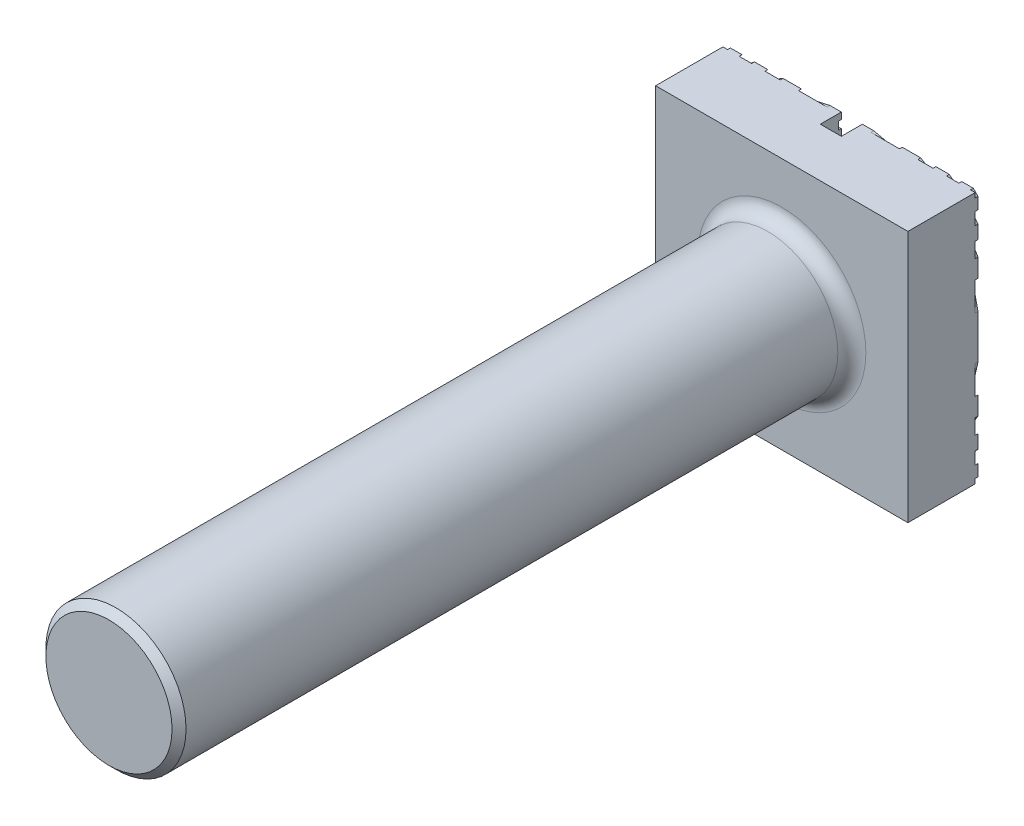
ISO-10303-21;
HEADER;
FILE_DESCRIPTION(('STEP AP214'),'2;1');
FILE_NAME('part.step','',(''),(''),'','','');
FILE_SCHEMA(('AUTOMOTIVE_DESIGN { 1 0 10303 214 1 1 1 1 }'));
ENDSEC;
DATA;
#1=APPLICATION_CONTEXT('core data for automotive mechanical design processes');
#2=APPLICATION_PROTOCOL_DEFINITION('international standard','automotive_design',2000,#1);
#3=PRODUCT_CONTEXT('',#1,'mechanical');
#4=PRODUCT('Part','Part','',(#3));
#5=PRODUCT_RELATED_PRODUCT_CATEGORY('part','',(#4));
#6=PRODUCT_DEFINITION_FORMATION('','',#4);
#7=PRODUCT_DEFINITION_CONTEXT('part definition',#1,'design');
#8=PRODUCT_DEFINITION('design','',#6,#7);
#9=PRODUCT_DEFINITION_SHAPE('','',#8);
#10=(LENGTH_UNIT() NAMED_UNIT(*) SI_UNIT(.MILLI.,.METRE.));
#11=(NAMED_UNIT(*) PLANE_ANGLE_UNIT() SI_UNIT($,.RADIAN.));
#12=(NAMED_UNIT(*) SI_UNIT($,.STERADIAN.) SOLID_ANGLE_UNIT());
#13=UNCERTAINTY_MEASURE_WITH_UNIT(LENGTH_MEASURE(1.E-05),#10,'distance_accuracy_value','');
#14=(GEOMETRIC_REPRESENTATION_CONTEXT(3) GLOBAL_UNCERTAINTY_ASSIGNED_CONTEXT((#13)) GLOBAL_UNIT_ASSIGNED_CONTEXT((#10,
#11,#12)) REPRESENTATION_CONTEXT('',''));
#15=CARTESIAN_POINT('',(0.,0.,0.));
#16=DIRECTION('',(0.,0.,1.));
#17=DIRECTION('',(1.,0.,0.));
#18=AXIS2_PLACEMENT_3D('',#15,#16,#17);
#19=CARTESIAN_POINT('',(-8.99999999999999,-8.99999999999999,-5.));
#20=DIRECTION('',(0.,0.,1.));
#21=DIRECTION('',(1.,0.,0.));
#22=AXIS2_PLACEMENT_3D('',#19,#20,#21);
#23=PLANE('',#22);
#24=CARTESIAN_POINT('',(0.,0.,-5.));
#25=DIRECTION('',(0.,0.,1.));
#26=DIRECTION('',(1.,0.,0.));
#27=AXIS2_PLACEMENT_3D('',#24,#25,#26);
#28=CIRCLE('',#27,12.4940496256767);
#29=CARTESIAN_POINT('',(-8.99999999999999,-8.66609924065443,-5.));
#30=VERTEX_POINT('',#29);
#31=CARTESIAN_POINT('',(-8.66609924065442,-8.99999999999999,-5.));
#32=VERTEX_POINT('',#31);
#33=EDGE_CURVE('E1759',#30,#32,#28,.T.);
#34=ORIENTED_EDGE('',*,*,#33,.F.);
#35=DIRECTION('',(0.,-1.,0.));
#36=VECTOR('',#35,1.);
#37=CARTESIAN_POINT('',(-8.99999999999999,9.,-5.));
#38=LINE('',#37,#36);
#39=CARTESIAN_POINT('',(-8.99999999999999,-7.8371895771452,-5.));
#40=VERTEX_POINT('',#39);
#41=EDGE_CURVE('E1285',#40,#30,#38,.T.);
#42=ORIENTED_EDGE('',*,*,#41,.F.);
#43=CARTESIAN_POINT('',(0.,0.,-5.));
#44=DIRECTION('',(0.,0.,1.));
#45=DIRECTION('',(1.,0.,0.));
#46=AXIS2_PLACEMENT_3D('',#43,#44,#45);
#47=CIRCLE('',#46,11.9340496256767);
#48=CARTESIAN_POINT('',(-7.83718957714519,-8.99999999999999,-5.));
#49=VERTEX_POINT('',#48);
#50=EDGE_CURVE('E1758',#40,#49,#47,.T.);
#51=ORIENTED_EDGE('',*,*,#50,.T.);
#52=DIRECTION('',(1.,0.,0.));
#53=VECTOR('',#52,1.);
#54=CARTESIAN_POINT('',(-8.99999999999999,-8.99999999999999,-5.));
#55=LINE('',#54,#53);
#56=EDGE_CURVE('E1291',#32,#49,#55,.T.);
#57=ORIENTED_EDGE('',*,*,#56,.F.);
#58=EDGE_LOOP('',(#34,#42,#51,#57));
#59=FACE_BOUND('',#58,.T.);
#60=ADVANCED_FACE('F32',(#59),#23,.F.);
#61=CARTESIAN_POINT('',(-8.66609924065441,9.,-5.));
#62=VERTEX_POINT('',#61);
#63=CARTESIAN_POINT('',(-8.99999999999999,8.66609924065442,-5.));
#64=VERTEX_POINT('',#63);
#65=EDGE_CURVE('E1762',#62,#64,#28,.T.);
#66=ORIENTED_EDGE('',*,*,#65,.F.);
#67=DIRECTION('',(-1.,0.,0.));
#68=VECTOR('',#67,1.);
#69=CARTESIAN_POINT('',(-8.99999999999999,9.,-5.));
#70=LINE('',#69,#68);
#71=CARTESIAN_POINT('',(-7.83718957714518,9.,-5.));
#72=VERTEX_POINT('',#71);
#73=EDGE_CURVE('E1297',#72,#62,#70,.T.);
#74=ORIENTED_EDGE('',*,*,#73,.F.);
#75=CARTESIAN_POINT('',(-8.99999999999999,7.83718957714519,-5.));
#76=VERTEX_POINT('',#75);
#77=EDGE_CURVE('E815',#72,#76,#47,.T.);
#78=ORIENTED_EDGE('',*,*,#77,.T.);
#79=EDGE_CURVE('E1286',#64,#76,#38,.T.);
#80=ORIENTED_EDGE('',*,*,#79,.F.);
#81=EDGE_LOOP('',(#66,#74,#78,#80));
#82=FACE_BOUND('',#81,.T.);
#83=ADVANCED_FACE('F1449',(#82),#23,.F.);
#84=CARTESIAN_POINT('',(8.66609924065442,-8.99999999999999,-5.));
#85=VERTEX_POINT('',#84);
#86=CARTESIAN_POINT('',(9.00000000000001,-8.6660992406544,-5.));
#87=VERTEX_POINT('',#86);
#88=EDGE_CURVE('E784',#85,#87,#28,.T.);
#89=ORIENTED_EDGE('',*,*,#88,.F.);
#90=CARTESIAN_POINT('',(7.8371895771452,-8.99999999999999,-5.));
#91=VERTEX_POINT('',#90);
#92=EDGE_CURVE('E1288',#91,#85,#55,.T.);
#93=ORIENTED_EDGE('',*,*,#92,.F.);
#94=CARTESIAN_POINT('',(9.00000000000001,-7.83718957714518,-5.));
#95=VERTEX_POINT('',#94);
#96=EDGE_CURVE('E810',#91,#95,#47,.T.);
#97=ORIENTED_EDGE('',*,*,#96,.T.);
#98=DIRECTION('',(0.,1.,0.));
#99=VECTOR('',#98,1.);
#100=CARTESIAN_POINT('',(9.00000000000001,9.00000000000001,-5.));
#101=LINE('',#100,#99);
#102=EDGE_CURVE('E1295',#87,#95,#101,.T.);
#103=ORIENTED_EDGE('',*,*,#102,.F.);
#104=EDGE_LOOP('',(#89,#93,#97,#103));
#105=FACE_BOUND('',#104,.T.);
#106=ADVANCED_FACE('F1456',(#105),#23,.F.);
#107=CARTESIAN_POINT('',(9.00000000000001,8.6660992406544,-5.));
#108=VERTEX_POINT('',#107);
#109=CARTESIAN_POINT('',(8.66609924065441,9.00000000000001,-5.));
#110=VERTEX_POINT('',#109);
#111=EDGE_CURVE('E1764',#108,#110,#28,.T.);
#112=ORIENTED_EDGE('',*,*,#111,.F.);
#113=CARTESIAN_POINT('',(9.00000000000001,7.83718957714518,-5.));
#114=VERTEX_POINT('',#113);
#115=EDGE_CURVE('E793',#114,#108,#101,.T.);
#116=ORIENTED_EDGE('',*,*,#115,.F.);
#117=CARTESIAN_POINT('',(7.83718957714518,9.00000000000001,-5.));
#118=VERTEX_POINT('',#117);
#119=EDGE_CURVE('E811',#114,#118,#47,.T.);
#120=ORIENTED_EDGE('',*,*,#119,.T.);
#121=EDGE_CURVE('E1300',#110,#118,#70,.T.);
#122=ORIENTED_EDGE('',*,*,#121,.F.);
#123=EDGE_LOOP('',(#112,#116,#120,#122));
#124=FACE_BOUND('',#123,.T.);
#125=ADVANCED_FACE('F2767',(#124),#23,.F.);
#126=CARTESIAN_POINT('',(-8.99999999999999,9.,-5.));
#127=DIRECTION('',(-1.,0.,0.));
#128=DIRECTION('',(0.,-1.,0.));
#129=AXIS2_PLACEMENT_3D('',#126,#127,#128);
#130=PLANE('',#129);
#131=DIRECTION('',(0.,-1.,0.));
#132=VECTOR('',#131,1.);
#133=CARTESIAN_POINT('',(-8.99999999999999,9.,-4.8));
#134=LINE('',#133,#132);
#135=CARTESIAN_POINT('',(-8.99999999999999,9.,-4.8));
#136=VERTEX_POINT('',#135);
#137=CARTESIAN_POINT('',(-8.99999999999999,8.66609924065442,-4.8));
#138=VERTEX_POINT('',#137);
#139=EDGE_CURVE('E47',#136,#138,#134,.T.);
#140=ORIENTED_EDGE('',*,*,#139,.T.);
#141=DIRECTION('',(0.,0.,1.));
#142=VECTOR('',#141,1.);
#143=CARTESIAN_POINT('',(-8.99999999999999,8.66609924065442,0.));
#144=LINE('',#143,#142);
#145=EDGE_CURVE('E804',#138,#64,#144,.F.);
#146=ORIENTED_EDGE('',*,*,#145,.T.);
#147=ORIENTED_EDGE('',*,*,#79,.T.);
#148=DIRECTION('',(0.,0.,1.));
#149=VECTOR('',#148,1.);
#150=CARTESIAN_POINT('',(-8.99999999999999,7.83718957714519,0.));
#151=LINE('',#150,#149);
#152=CARTESIAN_POINT('',(-8.99999999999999,7.83718957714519,-4.8));
#153=VERTEX_POINT('',#152);
#154=EDGE_CURVE('E840',#76,#153,#151,.T.);
#155=ORIENTED_EDGE('',*,*,#154,.T.);
#156=DIRECTION('',(0.,-1.,0.));
#157=VECTOR('',#156,1.);
#158=CARTESIAN_POINT('',(-8.99999999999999,9.,-4.8));
#159=LINE('',#158,#157);
#160=CARTESIAN_POINT('',(-8.99999999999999,6.95478287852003,-4.8));
#161=VERTEX_POINT('',#160);
#162=EDGE_CURVE('E857',#153,#161,#159,.T.);
#163=ORIENTED_EDGE('',*,*,#162,.T.);
#164=DIRECTION('',(0.,0.,1.));
#165=VECTOR('',#164,1.);
#166=CARTESIAN_POINT('',(-8.99999999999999,6.95478287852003,0.));
#167=LINE('',#166,#165);
#168=CARTESIAN_POINT('',(-8.99999999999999,6.95478287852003,-5.));
#169=VERTEX_POINT('',#168);
#170=EDGE_CURVE('E870',#161,#169,#167,.F.);
#171=ORIENTED_EDGE('',*,*,#170,.T.);
#172=CARTESIAN_POINT('',(-8.99999999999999,5.99530393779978,-5.));
#173=VERTEX_POINT('',#172);
#174=EDGE_CURVE('E1289',#169,#173,#38,.T.);
#175=ORIENTED_EDGE('',*,*,#174,.T.);
#176=DIRECTION('',(0.,0.,1.));
#177=VECTOR('',#176,1.);
#178=CARTESIAN_POINT('',(-8.99999999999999,5.99530393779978,0.));
#179=LINE('',#178,#177);
#180=CARTESIAN_POINT('',(-8.99999999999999,5.99530393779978,-4.8));
#181=VERTEX_POINT('',#180);
#182=EDGE_CURVE('E907',#173,#181,#179,.T.);
#183=ORIENTED_EDGE('',*,*,#182,.T.);
#184=DIRECTION('',(0.,-1.,0.));
#185=VECTOR('',#184,1.);
#186=CARTESIAN_POINT('',(-8.99999999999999,9.,-4.8));
#187=LINE('',#186,#185);
#188=CARTESIAN_POINT('',(-8.99999999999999,4.91381050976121,-4.8));
#189=VERTEX_POINT('',#188);
#190=EDGE_CURVE('E924',#181,#189,#187,.T.);
#191=ORIENTED_EDGE('',*,*,#190,.T.);
#192=DIRECTION('',(0.,0.,1.));
#193=VECTOR('',#192,1.);
#194=CARTESIAN_POINT('',(-8.99999999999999,4.91381050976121,0.));
#195=LINE('',#194,#193);
#196=CARTESIAN_POINT('',(-8.99999999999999,4.91381050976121,-5.));
#197=VERTEX_POINT('',#196);
#198=EDGE_CURVE('E937',#189,#197,#195,.F.);
#199=ORIENTED_EDGE('',*,*,#198,.T.);
#200=CARTESIAN_POINT('',(-8.99999999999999,3.60202694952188,-5.));
#201=VERTEX_POINT('',#200);
#202=EDGE_CURVE('E1718',#197,#201,#38,.T.);
#203=ORIENTED_EDGE('',*,*,#202,.T.);
#204=DIRECTION('',(0.,0.,1.));
#205=VECTOR('',#204,1.);
#206=CARTESIAN_POINT('',(-8.99999999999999,3.60202694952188,0.));
#207=LINE('',#206,#205);
#208=CARTESIAN_POINT('',(-8.99999999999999,3.60202694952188,-4.8));
#209=VERTEX_POINT('',#208);
#210=EDGE_CURVE('E974',#201,#209,#207,.T.);
#211=ORIENTED_EDGE('',*,*,#210,.T.);
#212=DIRECTION('',(0.,-1.,0.));
#213=VECTOR('',#212,1.);
#214=CARTESIAN_POINT('',(-8.99999999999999,9.,-4.8));
#215=LINE('',#214,#213);
#216=CARTESIAN_POINT('',(-8.99999999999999,1.55912236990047,-4.8));
#217=VERTEX_POINT('',#216);
#218=EDGE_CURVE('E991',#209,#217,#215,.T.);
#219=ORIENTED_EDGE('',*,*,#218,.T.);
#220=DIRECTION('',(0.,0.,1.));
#221=VECTOR('',#220,1.);
#222=CARTESIAN_POINT('',(-8.99999999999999,1.55912236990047,0.));
#223=LINE('',#222,#221);
#224=CARTESIAN_POINT('',(-8.99999999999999,1.55912236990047,-5.));
#225=VERTEX_POINT('',#224);
#226=EDGE_CURVE('E1004',#217,#225,#223,.F.);
#227=ORIENTED_EDGE('',*,*,#226,.T.);
#228=CARTESIAN_POINT('',(-8.99999999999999,-1.55912236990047,-5.));
#229=VERTEX_POINT('',#228);
#230=EDGE_CURVE('E1290',#225,#229,#38,.T.);
#231=ORIENTED_EDGE('',*,*,#230,.T.);
#232=DIRECTION('',(0.,0.,1.));
#233=VECTOR('',#232,1.);
#234=CARTESIAN_POINT('',(-8.99999999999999,-1.55912236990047,0.));
#235=LINE('',#234,#233);
#236=CARTESIAN_POINT('',(-8.99999999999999,-1.55912236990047,-4.8));
#237=VERTEX_POINT('',#236);
#238=EDGE_CURVE('E1007',#229,#237,#235,.T.);
#239=ORIENTED_EDGE('',*,*,#238,.T.);
#240=CARTESIAN_POINT('',(-8.99999999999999,-3.60202694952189,-4.8));
#241=VERTEX_POINT('',#240);
#242=EDGE_CURVE('E988',#237,#241,#215,.T.);
#243=ORIENTED_EDGE('',*,*,#242,.T.);
#244=DIRECTION('',(0.,0.,1.));
#245=VECTOR('',#244,1.);
#246=CARTESIAN_POINT('',(-8.99999999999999,-3.60202694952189,0.));
#247=LINE('',#246,#245);
#248=CARTESIAN_POINT('',(-8.99999999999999,-3.60202694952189,-5.));
#249=VERTEX_POINT('',#248);
#250=EDGE_CURVE('E977',#241,#249,#247,.F.);
#251=ORIENTED_EDGE('',*,*,#250,.T.);
#252=CARTESIAN_POINT('',(-8.99999999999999,-4.91381050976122,-5.));
#253=VERTEX_POINT('',#252);
#254=EDGE_CURVE('E1752',#249,#253,#38,.T.);
#255=ORIENTED_EDGE('',*,*,#254,.T.);
#256=DIRECTION('',(0.,0.,1.));
#257=VECTOR('',#256,1.);
#258=CARTESIAN_POINT('',(-8.99999999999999,-4.91381050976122,0.));
#259=LINE('',#258,#257);
#260=CARTESIAN_POINT('',(-8.99999999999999,-4.91381050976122,-4.8));
#261=VERTEX_POINT('',#260);
#262=EDGE_CURVE('E940',#253,#261,#259,.T.);
#263=ORIENTED_EDGE('',*,*,#262,.T.);
#264=CARTESIAN_POINT('',(-8.99999999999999,-5.99530393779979,-4.8));
#265=VERTEX_POINT('',#264);
#266=EDGE_CURVE('E921',#261,#265,#187,.T.);
#267=ORIENTED_EDGE('',*,*,#266,.T.);
#268=DIRECTION('',(0.,0.,1.));
#269=VECTOR('',#268,1.);
#270=CARTESIAN_POINT('',(-8.99999999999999,-5.99530393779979,0.));
#271=LINE('',#270,#269);
#272=CARTESIAN_POINT('',(-8.99999999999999,-5.99530393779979,-5.));
#273=VERTEX_POINT('',#272);
#274=EDGE_CURVE('E910',#265,#273,#271,.F.);
#275=ORIENTED_EDGE('',*,*,#274,.T.);
#276=CARTESIAN_POINT('',(-8.99999999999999,-6.95478287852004,-5.));
#277=VERTEX_POINT('',#276);
#278=EDGE_CURVE('E1681',#273,#277,#38,.T.);
#279=ORIENTED_EDGE('',*,*,#278,.T.);
#280=DIRECTION('',(0.,0.,1.));
#281=VECTOR('',#280,1.);
#282=CARTESIAN_POINT('',(-8.99999999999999,-6.95478287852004,0.));
#283=LINE('',#282,#281);
#284=CARTESIAN_POINT('',(-8.99999999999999,-6.95478287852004,-4.8));
#285=VERTEX_POINT('',#284);
#286=EDGE_CURVE('E873',#277,#285,#283,.T.);
#287=ORIENTED_EDGE('',*,*,#286,.T.);
#288=CARTESIAN_POINT('',(-8.99999999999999,-7.8371895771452,-4.8));
#289=VERTEX_POINT('',#288);
#290=EDGE_CURVE('E854',#285,#289,#159,.T.);
#291=ORIENTED_EDGE('',*,*,#290,.T.);
#292=DIRECTION('',(0.,0.,1.));
#293=VECTOR('',#292,1.);
#294=CARTESIAN_POINT('',(-8.99999999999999,-7.8371895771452,0.));
#295=LINE('',#294,#293);
#296=EDGE_CURVE('E843',#289,#40,#295,.F.);
#297=ORIENTED_EDGE('',*,*,#296,.T.);
#298=ORIENTED_EDGE('',*,*,#41,.T.);
#299=DIRECTION('',(0.,0.,1.));
#300=VECTOR('',#299,1.);
#301=CARTESIAN_POINT('',(-8.99999999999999,-8.66609924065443,0.));
#302=LINE('',#301,#300);
#303=CARTESIAN_POINT('',(-8.99999999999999,-8.66609924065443,-4.8));
#304=VERTEX_POINT('',#303);
#305=EDGE_CURVE('E807',#30,#304,#302,.T.);
#306=ORIENTED_EDGE('',*,*,#305,.T.);
#307=CARTESIAN_POINT('',(-8.99999999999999,-8.99999999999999,-4.8));
#308=VERTEX_POINT('',#307);
#309=EDGE_CURVE('E775',#304,#308,#134,.T.);
#310=ORIENTED_EDGE('',*,*,#309,.T.);
#311=DIRECTION('',(0.,0.,1.));
#312=VECTOR('',#311,1.);
#313=CARTESIAN_POINT('',(-8.99999999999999,-8.99999999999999,-5.));
#314=LINE('',#313,#312);
#315=CARTESIAN_POINT('',(-8.99999999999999,-8.99999999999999,0.));
#316=VERTEX_POINT('',#315);
#317=EDGE_CURVE('E1302',#308,#316,#314,.T.);
#318=ORIENTED_EDGE('',*,*,#317,.T.);
#319=DIRECTION('',(0.,-1.,0.));
#320=VECTOR('',#319,1.);
#321=CARTESIAN_POINT('',(-8.99999999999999,9.,0.));
#322=LINE('',#321,#320);
#323=CARTESIAN_POINT('',(-8.99999999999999,9.,0.));
#324=VERTEX_POINT('',#323);
#325=EDGE_CURVE('E1258',#324,#316,#322,.T.);
#326=ORIENTED_EDGE('',*,*,#325,.F.);
#327=DIRECTION('',(0.,0.,1.));
#328=VECTOR('',#327,1.);
#329=CARTESIAN_POINT('',(-8.99999999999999,9.,-5.));
#330=LINE('',#329,#328);
#331=EDGE_CURVE('E1305',#136,#324,#330,.T.);
#332=ORIENTED_EDGE('',*,*,#331,.F.);
#333=EDGE_LOOP('',(#140,#146,#147,#155,#163,#171,#175,#183,#191,#199,#203,#211,#219,#227,#231,
#239,#243,#251,#255,#263,#267,#275,#279,#287,#291,#297,#298,#306,#310,#318,#326,#332));
#334=FACE_BOUND('',#333,.T.);
#335=ADVANCED_FACE('F34',(#334),#130,.T.);
#336=CARTESIAN_POINT('',(-8.99999999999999,9.,-5.));
#337=DIRECTION('',(0.,1.,0.));
#338=DIRECTION('',(-1.,0.,0.));
#339=AXIS2_PLACEMENT_3D('',#336,#337,#338);
#340=PLANE('',#339);
#341=DIRECTION('',(-1.,0.,0.));
#342=VECTOR('',#341,1.);
#343=CARTESIAN_POINT('',(-8.99999999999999,9.,-4.8));
#344=LINE('',#343,#342);
#345=CARTESIAN_POINT('',(9.00000000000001,9.00000000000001,-4.8));
#346=VERTEX_POINT('',#345);
#347=CARTESIAN_POINT('',(8.66609924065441,9.00000000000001,-4.8));
#348=VERTEX_POINT('',#347);
#349=EDGE_CURVE('E55',#346,#348,#344,.T.);
#350=ORIENTED_EDGE('',*,*,#349,.T.);
#351=DIRECTION('',(0.,0.,1.));
#352=VECTOR('',#351,1.);
#353=CARTESIAN_POINT('',(8.66609924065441,9.00000000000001,0.));
#354=LINE('',#353,#352);
#355=EDGE_CURVE('E783',#348,#110,#354,.F.);
#356=ORIENTED_EDGE('',*,*,#355,.T.);
#357=ORIENTED_EDGE('',*,*,#121,.T.);
#358=DIRECTION('',(0.,0.,1.));
#359=VECTOR('',#358,1.);
#360=CARTESIAN_POINT('',(7.83718957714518,9.00000000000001,0.));
#361=LINE('',#360,#359);
#362=CARTESIAN_POINT('',(7.83718957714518,9.00000000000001,-4.8));
#363=VERTEX_POINT('',#362);
#364=EDGE_CURVE('E834',#118,#363,#361,.T.);
#365=ORIENTED_EDGE('',*,*,#364,.T.);
#366=DIRECTION('',(-1.,0.,0.));
#367=VECTOR('',#366,1.);
#368=CARTESIAN_POINT('',(-8.99999999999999,9.,-4.8));
#369=LINE('',#368,#367);
#370=CARTESIAN_POINT('',(6.95478287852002,9.00000000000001,-4.8));
#371=VERTEX_POINT('',#370);
#372=EDGE_CURVE('E853',#363,#371,#369,.T.);
#373=ORIENTED_EDGE('',*,*,#372,.T.);
#374=DIRECTION('',(0.,0.,1.));
#375=VECTOR('',#374,1.);
#376=CARTESIAN_POINT('',(6.95478287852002,9.00000000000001,0.));
#377=LINE('',#376,#375);
#378=CARTESIAN_POINT('',(6.95478287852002,9.00000000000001,-5.));
#379=VERTEX_POINT('',#378);
#380=EDGE_CURVE('E864',#371,#379,#377,.F.);
#381=ORIENTED_EDGE('',*,*,#380,.T.);
#382=CARTESIAN_POINT('',(5.99530393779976,9.,-5.));
#383=VERTEX_POINT('',#382);
#384=EDGE_CURVE('E1303',#379,#383,#70,.T.);
#385=ORIENTED_EDGE('',*,*,#384,.T.);
#386=DIRECTION('',(0.,0.,1.));
#387=VECTOR('',#386,1.);
#388=CARTESIAN_POINT('',(5.99530393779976,9.00000000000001,0.));
#389=LINE('',#388,#387);
#390=CARTESIAN_POINT('',(5.99530393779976,9.,-4.8));
#391=VERTEX_POINT('',#390);
#392=EDGE_CURVE('E901',#383,#391,#389,.T.);
#393=ORIENTED_EDGE('',*,*,#392,.T.);
#394=DIRECTION('',(-1.,0.,0.));
#395=VECTOR('',#394,1.);
#396=CARTESIAN_POINT('',(-8.99999999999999,9.,-4.8));
#397=LINE('',#396,#395);
#398=CARTESIAN_POINT('',(4.91381050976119,9.00000000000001,-4.8));
#399=VERTEX_POINT('',#398);
#400=EDGE_CURVE('E920',#391,#399,#397,.T.);
#401=ORIENTED_EDGE('',*,*,#400,.T.);
#402=DIRECTION('',(0.,0.,1.));
#403=VECTOR('',#402,1.);
#404=CARTESIAN_POINT('',(4.91381050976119,9.00000000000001,0.));
#405=LINE('',#404,#403);
#406=CARTESIAN_POINT('',(4.91381050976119,9.,-5.));
#407=VERTEX_POINT('',#406);
#408=EDGE_CURVE('E931',#399,#407,#405,.F.);
#409=ORIENTED_EDGE('',*,*,#408,.T.);
#410=CARTESIAN_POINT('',(3.60202694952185,9.,-5.));
#411=VERTEX_POINT('',#410);
#412=EDGE_CURVE('E1578',#407,#411,#70,.T.);
#413=ORIENTED_EDGE('',*,*,#412,.T.);
#414=DIRECTION('',(0.,0.,1.));
#415=VECTOR('',#414,1.);
#416=CARTESIAN_POINT('',(3.60202694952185,9.,0.));
#417=LINE('',#416,#415);
#418=CARTESIAN_POINT('',(3.60202694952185,9.,-4.8));
#419=VERTEX_POINT('',#418);
#420=EDGE_CURVE('E968',#411,#419,#417,.T.);
#421=ORIENTED_EDGE('',*,*,#420,.T.);
#422=DIRECTION('',(-1.,0.,0.));
#423=VECTOR('',#422,1.);
#424=CARTESIAN_POINT('',(-8.99999999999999,9.,-4.8));
#425=LINE('',#424,#423);
#426=CARTESIAN_POINT('',(1.55912236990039,9.,-4.8));
#427=VERTEX_POINT('',#426);
#428=EDGE_CURVE('E987',#419,#427,#425,.T.);
#429=ORIENTED_EDGE('',*,*,#428,.T.);
#430=DIRECTION('',(0.,0.,1.));
#431=VECTOR('',#430,1.);
#432=CARTESIAN_POINT('',(1.55912236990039,9.,0.));
#433=LINE('',#432,#431);
#434=CARTESIAN_POINT('',(1.55912236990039,9.,-5.));
#435=VERTEX_POINT('',#434);
#436=EDGE_CURVE('E998',#427,#435,#433,.F.);
#437=ORIENTED_EDGE('',*,*,#436,.T.);
#438=CARTESIAN_POINT('',(0.749999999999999,9.,-5.));
#439=VERTEX_POINT('',#438);
#440=EDGE_CURVE('E1561',#435,#439,#70,.T.);
#441=ORIENTED_EDGE('',*,*,#440,.T.);
#442=DIRECTION('',(0.,0.,1.));
#443=VECTOR('',#442,1.);
#444=CARTESIAN_POINT('',(0.749999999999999,9.00000000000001,-3.5));
#445=LINE('',#444,#443);
#446=CARTESIAN_POINT('',(0.749999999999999,9.00000000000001,-3.5));
#447=VERTEX_POINT('',#446);
#448=EDGE_CURVE('E1249',#439,#447,#445,.T.);
#449=ORIENTED_EDGE('',*,*,#448,.T.);
#450=DIRECTION('',(-1.,0.,0.));
#451=VECTOR('',#450,1.);
#452=CARTESIAN_POINT('',(-0.750000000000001,9.00000000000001,-3.5));
#453=LINE('',#452,#451);
#454=CARTESIAN_POINT('',(-0.750000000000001,9.00000000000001,-3.5));
#455=VERTEX_POINT('',#454);
#456=EDGE_CURVE('E1252',#447,#455,#453,.T.);
#457=ORIENTED_EDGE('',*,*,#456,.T.);
#458=DIRECTION('',(0.,0.,-1.));
#459=VECTOR('',#458,1.);
#460=CARTESIAN_POINT('',(-0.750000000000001,9.00000000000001,-3.5));
#461=LINE('',#460,#459);
#462=CARTESIAN_POINT('',(-0.750000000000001,9.00000000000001,-5.));
#463=VERTEX_POINT('',#462);
#464=EDGE_CURVE('E1246',#455,#463,#461,.T.);
#465=ORIENTED_EDGE('',*,*,#464,.T.);
#466=CARTESIAN_POINT('',(-1.55912236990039,9.,-5.));
#467=VERTEX_POINT('',#466);
#468=EDGE_CURVE('E1304',#463,#467,#70,.T.);
#469=ORIENTED_EDGE('',*,*,#468,.T.);
#470=DIRECTION('',(0.,0.,1.));
#471=VECTOR('',#470,1.);
#472=CARTESIAN_POINT('',(-1.55912236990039,9.,0.));
#473=LINE('',#472,#471);
#474=CARTESIAN_POINT('',(-1.55912236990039,9.,-4.8));
#475=VERTEX_POINT('',#474);
#476=EDGE_CURVE('E1001',#467,#475,#473,.T.);
#477=ORIENTED_EDGE('',*,*,#476,.T.);
#478=CARTESIAN_POINT('',(-3.60202694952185,9.,-4.8));
#479=VERTEX_POINT('',#478);
#480=EDGE_CURVE('E984',#475,#479,#425,.T.);
#481=ORIENTED_EDGE('',*,*,#480,.T.);
#482=DIRECTION('',(0.,0.,1.));
#483=VECTOR('',#482,1.);
#484=CARTESIAN_POINT('',(-3.60202694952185,9.,0.));
#485=LINE('',#484,#483);
#486=CARTESIAN_POINT('',(-3.60202694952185,9.,-5.));
#487=VERTEX_POINT('',#486);
#488=EDGE_CURVE('E971',#479,#487,#485,.F.);
#489=ORIENTED_EDGE('',*,*,#488,.T.);
#490=CARTESIAN_POINT('',(-4.91381050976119,9.,-5.));
#491=VERTEX_POINT('',#490);
#492=EDGE_CURVE('E1579',#487,#491,#70,.T.);
#493=ORIENTED_EDGE('',*,*,#492,.T.);
#494=DIRECTION('',(0.,0.,1.));
#495=VECTOR('',#494,1.);
#496=CARTESIAN_POINT('',(-4.91381050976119,9.,0.));
#497=LINE('',#496,#495);
#498=CARTESIAN_POINT('',(-4.91381050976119,9.,-4.8));
#499=VERTEX_POINT('',#498);
#500=EDGE_CURVE('E934',#491,#499,#497,.T.);
#501=ORIENTED_EDGE('',*,*,#500,.T.);
#502=CARTESIAN_POINT('',(-5.99530393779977,9.,-4.8));
#503=VERTEX_POINT('',#502);
#504=EDGE_CURVE('E917',#499,#503,#397,.T.);
#505=ORIENTED_EDGE('',*,*,#504,.T.);
#506=DIRECTION('',(0.,0.,1.));
#507=VECTOR('',#506,1.);
#508=CARTESIAN_POINT('',(-5.99530393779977,9.,0.));
#509=LINE('',#508,#507);
#510=CARTESIAN_POINT('',(-5.99530393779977,9.,-5.));
#511=VERTEX_POINT('',#510);
#512=EDGE_CURVE('E904',#503,#511,#509,.F.);
#513=ORIENTED_EDGE('',*,*,#512,.T.);
#514=CARTESIAN_POINT('',(-6.95478287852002,9.,-5.));
#515=VERTEX_POINT('',#514);
#516=EDGE_CURVE('E1580',#511,#515,#70,.T.);
#517=ORIENTED_EDGE('',*,*,#516,.T.);
#518=DIRECTION('',(0.,0.,1.));
#519=VECTOR('',#518,1.);
#520=CARTESIAN_POINT('',(-6.95478287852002,9.,0.));
#521=LINE('',#520,#519);
#522=CARTESIAN_POINT('',(-6.95478287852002,9.,-4.8));
#523=VERTEX_POINT('',#522);
#524=EDGE_CURVE('E867',#515,#523,#521,.T.);
#525=ORIENTED_EDGE('',*,*,#524,.T.);
#526=CARTESIAN_POINT('',(-7.83718957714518,9.,-4.8));
#527=VERTEX_POINT('',#526);
#528=EDGE_CURVE('E850',#523,#527,#369,.T.);
#529=ORIENTED_EDGE('',*,*,#528,.T.);
#530=DIRECTION('',(0.,0.,1.));
#531=VECTOR('',#530,1.);
#532=CARTESIAN_POINT('',(-7.83718957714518,9.,0.));
#533=LINE('',#532,#531);
#534=EDGE_CURVE('E837',#527,#72,#533,.F.);
#535=ORIENTED_EDGE('',*,*,#534,.T.);
#536=ORIENTED_EDGE('',*,*,#73,.T.);
#537=DIRECTION('',(0.,0.,1.));
#538=VECTOR('',#537,1.);
#539=CARTESIAN_POINT('',(-8.66609924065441,9.,0.));
#540=LINE('',#539,#538);
#541=CARTESIAN_POINT('',(-8.66609924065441,9.,-4.8));
#542=VERTEX_POINT('',#541);
#543=EDGE_CURVE('E796',#62,#542,#540,.T.);
#544=ORIENTED_EDGE('',*,*,#543,.T.);
#545=EDGE_CURVE('E1766',#542,#136,#344,.T.);
#546=ORIENTED_EDGE('',*,*,#545,.T.);
#547=ORIENTED_EDGE('',*,*,#331,.T.);
#548=DIRECTION('',(-1.,0.,0.));
#549=VECTOR('',#548,1.);
#550=CARTESIAN_POINT('',(-8.99999999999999,9.,0.));
#551=LINE('',#550,#549);
#552=CARTESIAN_POINT('',(9.00000000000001,9.00000000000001,0.));
#553=VERTEX_POINT('',#552);
#554=EDGE_CURVE('E1282',#553,#324,#551,.T.);
#555=ORIENTED_EDGE('',*,*,#554,.F.);
#556=DIRECTION('',(0.,0.,1.));
#557=VECTOR('',#556,1.);
#558=CARTESIAN_POINT('',(9.00000000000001,9.00000000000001,-5.));
#559=LINE('',#558,#557);
#560=EDGE_CURVE('E1308',#346,#553,#559,.T.);
#561=ORIENTED_EDGE('',*,*,#560,.F.);
#562=EDGE_LOOP('',(#350,#356,#357,#365,#373,#381,#385,#393,#401,#409,#413,#421,#429,#437,#441,
#449,#457,#465,#469,#477,#481,#489,#493,#501,#505,#513,#517,#525,#529,#535,#536,#544,#546,#547,
#555,#561));
#563=FACE_BOUND('',#562,.T.);
#564=ADVANCED_FACE('F1576',(#563),#340,.T.);
#565=CARTESIAN_POINT('',(9.00000000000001,9.00000000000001,-5.));
#566=DIRECTION('',(1.,0.,0.));
#567=DIRECTION('',(0.,1.,0.));
#568=AXIS2_PLACEMENT_3D('',#565,#566,#567);
#569=PLANE('',#568);
#570=DIRECTION('',(0.,1.,0.));
#571=VECTOR('',#570,1.);
#572=CARTESIAN_POINT('',(9.00000000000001,9.00000000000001,-4.8));
#573=LINE('',#572,#571);
#574=CARTESIAN_POINT('',(9.00000000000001,-8.99999999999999,-4.8));
#575=VERTEX_POINT('',#574);
#576=CARTESIAN_POINT('',(9.00000000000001,-8.6660992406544,-4.8));
#577=VERTEX_POINT('',#576);
#578=EDGE_CURVE('E777',#575,#577,#573,.T.);
#579=ORIENTED_EDGE('',*,*,#578,.T.);
#580=DIRECTION('',(0.,0.,1.));
#581=VECTOR('',#580,1.);
#582=CARTESIAN_POINT('',(9.00000000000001,-8.6660992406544,0.));
#583=LINE('',#582,#581);
#584=EDGE_CURVE('E794',#577,#87,#583,.F.);
#585=ORIENTED_EDGE('',*,*,#584,.T.);
#586=ORIENTED_EDGE('',*,*,#102,.T.);
#587=DIRECTION('',(0.,0.,1.));
#588=VECTOR('',#587,1.);
#589=CARTESIAN_POINT('',(9.00000000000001,-7.83718957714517,0.));
#590=LINE('',#589,#588);
#591=CARTESIAN_POINT('',(9.00000000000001,-7.83718957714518,-4.8));
#592=VERTEX_POINT('',#591);
#593=EDGE_CURVE('E828',#95,#592,#590,.T.);
#594=ORIENTED_EDGE('',*,*,#593,.T.);
#595=DIRECTION('',(0.,1.,0.));
#596=VECTOR('',#595,1.);
#597=CARTESIAN_POINT('',(9.00000000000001,9.00000000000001,-4.8));
#598=LINE('',#597,#596);
#599=CARTESIAN_POINT('',(9.00000000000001,-6.95478287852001,-4.8));
#600=VERTEX_POINT('',#599);
#601=EDGE_CURVE('E849',#592,#600,#598,.T.);
#602=ORIENTED_EDGE('',*,*,#601,.T.);
#603=DIRECTION('',(0.,0.,1.));
#604=VECTOR('',#603,1.);
#605=CARTESIAN_POINT('',(9.00000000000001,-6.95478287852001,0.));
#606=LINE('',#605,#604);
#607=CARTESIAN_POINT('',(9.00000000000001,-6.95478287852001,-5.));
#608=VERTEX_POINT('',#607);
#609=EDGE_CURVE('E858',#600,#608,#606,.F.);
#610=ORIENTED_EDGE('',*,*,#609,.T.);
#611=CARTESIAN_POINT('',(9.00000000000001,-5.99530393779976,-5.));
#612=VERTEX_POINT('',#611);
#613=EDGE_CURVE('E1298',#608,#612,#101,.T.);
#614=ORIENTED_EDGE('',*,*,#613,.T.);
#615=DIRECTION('',(0.,0.,1.));
#616=VECTOR('',#615,1.);
#617=CARTESIAN_POINT('',(9.00000000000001,-5.99530393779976,0.));
#618=LINE('',#617,#616);
#619=CARTESIAN_POINT('',(9.00000000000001,-5.99530393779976,-4.8));
#620=VERTEX_POINT('',#619);
#621=EDGE_CURVE('E894',#612,#620,#618,.T.);
#622=ORIENTED_EDGE('',*,*,#621,.T.);
#623=DIRECTION('',(0.,1.,0.));
#624=VECTOR('',#623,1.);
#625=CARTESIAN_POINT('',(9.00000000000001,9.00000000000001,-4.8));
#626=LINE('',#625,#624);
#627=CARTESIAN_POINT('',(9.00000000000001,-4.91381050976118,-4.8));
#628=VERTEX_POINT('',#627);
#629=EDGE_CURVE('E916',#620,#628,#626,.T.);
#630=ORIENTED_EDGE('',*,*,#629,.T.);
#631=DIRECTION('',(0.,0.,1.));
#632=VECTOR('',#631,1.);
#633=CARTESIAN_POINT('',(9.00000000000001,-4.91381050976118,0.));
#634=LINE('',#633,#632);
#635=CARTESIAN_POINT('',(9.00000000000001,-4.91381050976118,-5.));
#636=VERTEX_POINT('',#635);
#637=EDGE_CURVE('E925',#628,#636,#634,.F.);
#638=ORIENTED_EDGE('',*,*,#637,.T.);
#639=CARTESIAN_POINT('',(9.00000000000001,-3.60202694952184,-5.));
#640=VERTEX_POINT('',#639);
#641=EDGE_CURVE('E1601',#636,#640,#101,.T.);
#642=ORIENTED_EDGE('',*,*,#641,.T.);
#643=DIRECTION('',(0.,0.,1.));
#644=VECTOR('',#643,1.);
#645=CARTESIAN_POINT('',(9.00000000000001,-3.60202694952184,0.));
#646=LINE('',#645,#644);
#647=CARTESIAN_POINT('',(9.00000000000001,-3.60202694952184,-4.8));
#648=VERTEX_POINT('',#647);
#649=EDGE_CURVE('E961',#640,#648,#646,.T.);
#650=ORIENTED_EDGE('',*,*,#649,.T.);
#651=DIRECTION('',(0.,1.,0.));
#652=VECTOR('',#651,1.);
#653=CARTESIAN_POINT('',(9.00000000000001,9.00000000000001,-4.8));
#654=LINE('',#653,#652);
#655=CARTESIAN_POINT('',(9.00000000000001,-1.55912236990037,-4.8));
#656=VERTEX_POINT('',#655);
#657=EDGE_CURVE('E983',#648,#656,#654,.T.);
#658=ORIENTED_EDGE('',*,*,#657,.T.);
#659=DIRECTION('',(0.,0.,1.));
#660=VECTOR('',#659,1.);
#661=CARTESIAN_POINT('',(9.00000000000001,-1.55912236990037,0.));
#662=LINE('',#661,#660);
#663=CARTESIAN_POINT('',(9.00000000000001,-1.55912236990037,-5.));
#664=VERTEX_POINT('',#663);
#665=EDGE_CURVE('E992',#656,#664,#662,.F.);
#666=ORIENTED_EDGE('',*,*,#665,.T.);
#667=CARTESIAN_POINT('',(9.00000000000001,1.55912236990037,-5.));
#668=VERTEX_POINT('',#667);
#669=EDGE_CURVE('E1299',#664,#668,#101,.T.);
#670=ORIENTED_EDGE('',*,*,#669,.T.);
#671=DIRECTION('',(0.,0.,1.));
#672=VECTOR('',#671,1.);
#673=CARTESIAN_POINT('',(9.00000000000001,1.55912236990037,0.));
#674=LINE('',#673,#672);
#675=CARTESIAN_POINT('',(9.00000000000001,1.55912236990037,-4.8));
#676=VERTEX_POINT('',#675);
#677=EDGE_CURVE('E995',#668,#676,#674,.T.);
#678=ORIENTED_EDGE('',*,*,#677,.T.);
#679=CARTESIAN_POINT('',(9.00000000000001,3.60202694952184,-4.8));
#680=VERTEX_POINT('',#679);
#681=EDGE_CURVE('E980',#676,#680,#654,.T.);
#682=ORIENTED_EDGE('',*,*,#681,.T.);
#683=DIRECTION('',(0.,0.,1.));
#684=VECTOR('',#683,1.);
#685=CARTESIAN_POINT('',(9.00000000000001,3.60202694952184,0.));
#686=LINE('',#685,#684);
#687=CARTESIAN_POINT('',(9.00000000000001,3.60202694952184,-5.));
#688=VERTEX_POINT('',#687);
#689=EDGE_CURVE('E965',#680,#688,#686,.F.);
#690=ORIENTED_EDGE('',*,*,#689,.T.);
#691=CARTESIAN_POINT('',(9.00000000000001,4.91381050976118,-5.));
#692=VERTEX_POINT('',#691);
#693=EDGE_CURVE('E1600',#688,#692,#101,.T.);
#694=ORIENTED_EDGE('',*,*,#693,.T.);
#695=DIRECTION('',(0.,0.,1.));
#696=VECTOR('',#695,1.);
#697=CARTESIAN_POINT('',(9.00000000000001,4.91381050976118,0.));
#698=LINE('',#697,#696);
#699=CARTESIAN_POINT('',(9.00000000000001,4.91381050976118,-4.8));
#700=VERTEX_POINT('',#699);
#701=EDGE_CURVE('E928',#692,#700,#698,.T.);
#702=ORIENTED_EDGE('',*,*,#701,.T.);
#703=CARTESIAN_POINT('',(9.00000000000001,5.99530393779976,-4.8));
#704=VERTEX_POINT('',#703);
#705=EDGE_CURVE('E913',#700,#704,#626,.T.);
#706=ORIENTED_EDGE('',*,*,#705,.T.);
#707=DIRECTION('',(0.,0.,1.));
#708=VECTOR('',#707,1.);
#709=CARTESIAN_POINT('',(9.00000000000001,5.99530393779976,0.));
#710=LINE('',#709,#708);
#711=CARTESIAN_POINT('',(9.00000000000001,5.99530393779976,-5.));
#712=VERTEX_POINT('',#711);
#713=EDGE_CURVE('E898',#704,#712,#710,.F.);
#714=ORIENTED_EDGE('',*,*,#713,.T.);
#715=CARTESIAN_POINT('',(9.00000000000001,6.95478287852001,-5.));
#716=VERTEX_POINT('',#715);
#717=EDGE_CURVE('E1599',#712,#716,#101,.T.);
#718=ORIENTED_EDGE('',*,*,#717,.T.);
#719=DIRECTION('',(0.,0.,1.));
#720=VECTOR('',#719,1.);
#721=CARTESIAN_POINT('',(9.00000000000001,6.95478287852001,0.));
#722=LINE('',#721,#720);
#723=CARTESIAN_POINT('',(9.00000000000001,6.95478287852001,-4.8));
#724=VERTEX_POINT('',#723);
#725=EDGE_CURVE('E861',#716,#724,#722,.T.);
#726=ORIENTED_EDGE('',*,*,#725,.T.);
#727=CARTESIAN_POINT('',(9.00000000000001,7.83718957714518,-4.8));
#728=VERTEX_POINT('',#727);
#729=EDGE_CURVE('E846',#724,#728,#598,.T.);
#730=ORIENTED_EDGE('',*,*,#729,.T.);
#731=DIRECTION('',(0.,0.,1.));
#732=VECTOR('',#731,1.);
#733=CARTESIAN_POINT('',(9.00000000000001,7.83718957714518,0.));
#734=LINE('',#733,#732);
#735=EDGE_CURVE('E832',#728,#114,#734,.F.);
#736=ORIENTED_EDGE('',*,*,#735,.T.);
#737=ORIENTED_EDGE('',*,*,#115,.T.);
#738=DIRECTION('',(0.,0.,1.));
#739=VECTOR('',#738,1.);
#740=CARTESIAN_POINT('',(9.00000000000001,8.66609924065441,0.));
#741=LINE('',#740,#739);
#742=CARTESIAN_POINT('',(9.00000000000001,8.66609924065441,-4.8));
#743=VERTEX_POINT('',#742);
#744=EDGE_CURVE('E780',#108,#743,#741,.T.);
#745=ORIENTED_EDGE('',*,*,#744,.T.);
#746=EDGE_CURVE('E768',#743,#346,#573,.T.);
#747=ORIENTED_EDGE('',*,*,#746,.T.);
#748=ORIENTED_EDGE('',*,*,#560,.T.);
#749=DIRECTION('',(0.,1.,0.));
#750=VECTOR('',#749,1.);
#751=CARTESIAN_POINT('',(9.00000000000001,9.00000000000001,0.));
#752=LINE('',#751,#750);
#753=CARTESIAN_POINT('',(9.00000000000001,-8.99999999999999,0.));
#754=VERTEX_POINT('',#753);
#755=EDGE_CURVE('E1279',#754,#553,#752,.T.);
#756=ORIENTED_EDGE('',*,*,#755,.F.);
#757=DIRECTION('',(0.,0.,1.));
#758=VECTOR('',#757,1.);
#759=CARTESIAN_POINT('',(9.00000000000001,-8.99999999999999,-5.));
#760=LINE('',#759,#758);
#761=EDGE_CURVE('E1310',#575,#754,#760,.T.);
#762=ORIENTED_EDGE('',*,*,#761,.F.);
#763=EDGE_LOOP('',(#579,#585,#586,#594,#602,#610,#614,#622,#630,#638,#642,#650,#658,#666,#670,
#678,#682,#690,#694,#702,#706,#714,#718,#726,#730,#736,#737,#745,#747,#748,#756,#762));
#764=FACE_BOUND('',#763,.T.);
#765=ADVANCED_FACE('F790',(#764),#569,.T.);
#766=CARTESIAN_POINT('',(-8.99999999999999,-8.99999999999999,-5.));
#767=DIRECTION('',(0.,-1.,0.));
#768=DIRECTION('',(1.,0.,0.));
#769=AXIS2_PLACEMENT_3D('',#766,#767,#768);
#770=PLANE('',#769);
#771=DIRECTION('',(1.,0.,0.));
#772=VECTOR('',#771,1.);
#773=CARTESIAN_POINT('',(-8.99999999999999,-8.99999999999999,-4.8));
#774=LINE('',#773,#772);
#775=CARTESIAN_POINT('',(-8.66609924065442,-8.99999999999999,-4.8));
#776=VERTEX_POINT('',#775);
#777=EDGE_CURVE('E1426',#308,#776,#774,.T.);
#778=ORIENTED_EDGE('',*,*,#777,.T.);
#779=DIRECTION('',(0.,0.,1.));
#780=VECTOR('',#779,1.);
#781=CARTESIAN_POINT('',(-8.66609924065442,-8.99999999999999,0.));
#782=LINE('',#781,#780);
#783=EDGE_CURVE('E1429',#776,#32,#782,.F.);
#784=ORIENTED_EDGE('',*,*,#783,.T.);
#785=ORIENTED_EDGE('',*,*,#56,.T.);
#786=DIRECTION('',(0.,0.,1.));
#787=VECTOR('',#786,1.);
#788=CARTESIAN_POINT('',(-7.83718957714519,-8.99999999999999,0.));
#789=LINE('',#788,#787);
#790=CARTESIAN_POINT('',(-7.83718957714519,-8.99999999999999,-4.8));
#791=VERTEX_POINT('',#790);
#792=EDGE_CURVE('E1406',#49,#791,#789,.T.);
#793=ORIENTED_EDGE('',*,*,#792,.T.);
#794=DIRECTION('',(1.,0.,0.));
#795=VECTOR('',#794,1.);
#796=CARTESIAN_POINT('',(-8.99999999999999,-8.99999999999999,-4.8));
#797=LINE('',#796,#795);
#798=CARTESIAN_POINT('',(-6.95478287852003,-8.99999999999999,-4.8));
#799=VERTEX_POINT('',#798);
#800=EDGE_CURVE('E1409',#791,#799,#797,.T.);
#801=ORIENTED_EDGE('',*,*,#800,.T.);
#802=DIRECTION('',(0.,0.,1.));
#803=VECTOR('',#802,1.);
#804=CARTESIAN_POINT('',(-6.95478287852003,-8.99999999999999,0.));
#805=LINE('',#804,#803);
#806=CARTESIAN_POINT('',(-6.95478287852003,-8.99999999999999,-5.));
#807=VERTEX_POINT('',#806);
#808=EDGE_CURVE('E1412',#799,#807,#805,.F.);
#809=ORIENTED_EDGE('',*,*,#808,.T.);
#810=CARTESIAN_POINT('',(-5.99530393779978,-8.99999999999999,-5.));
#811=VERTEX_POINT('',#810);
#812=EDGE_CURVE('E1293',#807,#811,#55,.T.);
#813=ORIENTED_EDGE('',*,*,#812,.T.);
#814=DIRECTION('',(0.,0.,1.));
#815=VECTOR('',#814,1.);
#816=CARTESIAN_POINT('',(-5.99530393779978,-8.99999999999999,0.));
#817=LINE('',#816,#815);
#818=CARTESIAN_POINT('',(-5.99530393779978,-8.99999999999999,-4.8));
#819=VERTEX_POINT('',#818);
#820=EDGE_CURVE('E1390',#811,#819,#817,.T.);
#821=ORIENTED_EDGE('',*,*,#820,.T.);
#822=DIRECTION('',(1.,0.,0.));
#823=VECTOR('',#822,1.);
#824=CARTESIAN_POINT('',(-8.99999999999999,-8.99999999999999,-4.8));
#825=LINE('',#824,#823);
#826=CARTESIAN_POINT('',(-4.91381050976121,-8.99999999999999,-4.8));
#827=VERTEX_POINT('',#826);
#828=EDGE_CURVE('E1393',#819,#827,#825,.T.);
#829=ORIENTED_EDGE('',*,*,#828,.T.);
#830=DIRECTION('',(0.,0.,1.));
#831=VECTOR('',#830,1.);
#832=CARTESIAN_POINT('',(-4.91381050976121,-8.99999999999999,0.));
#833=LINE('',#832,#831);
#834=CARTESIAN_POINT('',(-4.91381050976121,-8.99999999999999,-5.));
#835=VERTEX_POINT('',#834);
#836=EDGE_CURVE('E1396',#827,#835,#833,.F.);
#837=ORIENTED_EDGE('',*,*,#836,.T.);
#838=CARTESIAN_POINT('',(-3.60202694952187,-8.99999999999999,-5.));
#839=VERTEX_POINT('',#838);
#840=EDGE_CURVE('E1839',#835,#839,#55,.T.);
#841=ORIENTED_EDGE('',*,*,#840,.T.);
#842=DIRECTION('',(0.,0.,1.));
#843=VECTOR('',#842,1.);
#844=CARTESIAN_POINT('',(-3.60202694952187,-8.99999999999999,0.));
#845=LINE('',#844,#843);
#846=CARTESIAN_POINT('',(-3.60202694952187,-8.99999999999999,-4.8));
#847=VERTEX_POINT('',#846);
#848=EDGE_CURVE('E1374',#839,#847,#845,.T.);
#849=ORIENTED_EDGE('',*,*,#848,.T.);
#850=DIRECTION('',(1.,0.,0.));
#851=VECTOR('',#850,1.);
#852=CARTESIAN_POINT('',(-8.99999999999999,-8.99999999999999,-4.8));
#853=LINE('',#852,#851);
#854=CARTESIAN_POINT('',(-1.55912236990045,-8.99999999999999,-4.8));
#855=VERTEX_POINT('',#854);
#856=EDGE_CURVE('E1377',#847,#855,#853,.T.);
#857=ORIENTED_EDGE('',*,*,#856,.T.);
#858=DIRECTION('',(0.,0.,1.));
#859=VECTOR('',#858,1.);
#860=CARTESIAN_POINT('',(-1.55912236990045,-8.99999999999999,0.));
#861=LINE('',#860,#859);
#862=CARTESIAN_POINT('',(-1.55912236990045,-8.99999999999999,-5.));
#863=VERTEX_POINT('',#862);
#864=EDGE_CURVE('E1380',#855,#863,#861,.F.);
#865=ORIENTED_EDGE('',*,*,#864,.T.);
#866=CARTESIAN_POINT('',(-0.749999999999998,-8.99999999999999,-5.));
#867=VERTEX_POINT('',#866);
#868=EDGE_CURVE('E1842',#863,#867,#55,.T.);
#869=ORIENTED_EDGE('',*,*,#868,.T.);
#870=DIRECTION('',(0.,0.,-1.));
#871=VECTOR('',#870,1.);
#872=CARTESIAN_POINT('',(-0.749999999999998,-8.99999999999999,-3.5));
#873=LINE('',#872,#871);
#874=CARTESIAN_POINT('',(-0.749999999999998,-8.99999999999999,-3.5));
#875=VERTEX_POINT('',#874);
#876=EDGE_CURVE('E1237',#875,#867,#873,.T.);
#877=ORIENTED_EDGE('',*,*,#876,.F.);
#878=DIRECTION('',(-1.,0.,0.));
#879=VECTOR('',#878,1.);
#880=CARTESIAN_POINT('',(-0.749999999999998,-8.99999999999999,-3.5));
#881=LINE('',#880,#879);
#882=CARTESIAN_POINT('',(0.750000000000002,-8.99999999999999,-3.5));
#883=VERTEX_POINT('',#882);
#884=EDGE_CURVE('E1243',#883,#875,#881,.T.);
#885=ORIENTED_EDGE('',*,*,#884,.F.);
#886=DIRECTION('',(0.,0.,1.));
#887=VECTOR('',#886,1.);
#888=CARTESIAN_POINT('',(0.750000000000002,-8.99999999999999,-3.5));
#889=LINE('',#888,#887);
#890=CARTESIAN_POINT('',(0.750000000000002,-8.99999999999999,-5.));
#891=VERTEX_POINT('',#890);
#892=EDGE_CURVE('E1240',#891,#883,#889,.T.);
#893=ORIENTED_EDGE('',*,*,#892,.F.);
#894=CARTESIAN_POINT('',(1.55912236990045,-8.99999999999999,-5.));
#895=VERTEX_POINT('',#894);
#896=EDGE_CURVE('E1294',#891,#895,#55,.T.);
#897=ORIENTED_EDGE('',*,*,#896,.T.);
#898=DIRECTION('',(0.,0.,1.));
#899=VECTOR('',#898,1.);
#900=CARTESIAN_POINT('',(1.55912236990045,-8.99999999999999,0.));
#901=LINE('',#900,#899);
#902=CARTESIAN_POINT('',(1.55912236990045,-8.99999999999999,-4.8));
#903=VERTEX_POINT('',#902);
#904=EDGE_CURVE('E1387',#895,#903,#901,.T.);
#905=ORIENTED_EDGE('',*,*,#904,.T.);
#906=CARTESIAN_POINT('',(3.60202694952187,-8.99999999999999,-4.8));
#907=VERTEX_POINT('',#906);
#908=EDGE_CURVE('E1381',#903,#907,#853,.T.);
#909=ORIENTED_EDGE('',*,*,#908,.T.);
#910=DIRECTION('',(0.,0.,1.));
#911=VECTOR('',#910,1.);
#912=CARTESIAN_POINT('',(3.60202694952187,-8.99999999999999,0.));
#913=LINE('',#912,#911);
#914=CARTESIAN_POINT('',(3.60202694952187,-8.99999999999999,-5.));
#915=VERTEX_POINT('',#914);
#916=EDGE_CURVE('E1384',#907,#915,#913,.F.);
#917=ORIENTED_EDGE('',*,*,#916,.T.);
#918=CARTESIAN_POINT('',(4.91381050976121,-8.99999999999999,-5.));
#919=VERTEX_POINT('',#918);
#920=EDGE_CURVE('E1706',#915,#919,#55,.T.);
#921=ORIENTED_EDGE('',*,*,#920,.T.);
#922=DIRECTION('',(0.,0.,1.));
#923=VECTOR('',#922,1.);
#924=CARTESIAN_POINT('',(4.91381050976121,-8.99999999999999,0.));
#925=LINE('',#924,#923);
#926=CARTESIAN_POINT('',(4.91381050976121,-8.99999999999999,-4.8));
#927=VERTEX_POINT('',#926);
#928=EDGE_CURVE('E1403',#919,#927,#925,.T.);
#929=ORIENTED_EDGE('',*,*,#928,.T.);
#930=CARTESIAN_POINT('',(5.99530393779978,-8.99999999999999,-4.8));
#931=VERTEX_POINT('',#930);
#932=EDGE_CURVE('E1397',#927,#931,#825,.T.);
#933=ORIENTED_EDGE('',*,*,#932,.T.);
#934=DIRECTION('',(0.,0.,1.));
#935=VECTOR('',#934,1.);
#936=CARTESIAN_POINT('',(5.99530393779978,-8.99999999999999,0.));
#937=LINE('',#936,#935);
#938=CARTESIAN_POINT('',(5.99530393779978,-8.99999999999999,-5.));
#939=VERTEX_POINT('',#938);
#940=EDGE_CURVE('E1400',#931,#939,#937,.F.);
#941=ORIENTED_EDGE('',*,*,#940,.T.);
#942=CARTESIAN_POINT('',(6.95478287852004,-8.99999999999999,-5.));
#943=VERTEX_POINT('',#942);
#944=EDGE_CURVE('E1690',#939,#943,#55,.T.);
#945=ORIENTED_EDGE('',*,*,#944,.T.);
#946=DIRECTION('',(0.,0.,1.));
#947=VECTOR('',#946,1.);
#948=CARTESIAN_POINT('',(6.95478287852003,-8.99999999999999,0.));
#949=LINE('',#948,#947);
#950=CARTESIAN_POINT('',(6.95478287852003,-8.99999999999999,-4.8));
#951=VERTEX_POINT('',#950);
#952=EDGE_CURVE('E1419',#943,#951,#949,.T.);
#953=ORIENTED_EDGE('',*,*,#952,.T.);
#954=CARTESIAN_POINT('',(7.8371895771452,-8.99999999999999,-4.8));
#955=VERTEX_POINT('',#954);
#956=EDGE_CURVE('E1413',#951,#955,#797,.T.);
#957=ORIENTED_EDGE('',*,*,#956,.T.);
#958=DIRECTION('',(0.,0.,1.));
#959=VECTOR('',#958,1.);
#960=CARTESIAN_POINT('',(7.83718957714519,-8.99999999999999,0.));
#961=LINE('',#960,#959);
#962=EDGE_CURVE('E1416',#955,#91,#961,.F.);
#963=ORIENTED_EDGE('',*,*,#962,.T.);
#964=ORIENTED_EDGE('',*,*,#92,.T.);
#965=DIRECTION('',(0.,0.,1.));
#966=VECTOR('',#965,1.);
#967=CARTESIAN_POINT('',(8.66609924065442,-8.99999999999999,0.));
#968=LINE('',#967,#966);
#969=CARTESIAN_POINT('',(8.66609924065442,-8.99999999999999,-4.8));
#970=VERTEX_POINT('',#969);
#971=EDGE_CURVE('E1425',#85,#970,#968,.T.);
#972=ORIENTED_EDGE('',*,*,#971,.T.);
#973=EDGE_CURVE('E1422',#970,#575,#774,.T.);
#974=ORIENTED_EDGE('',*,*,#973,.T.);
#975=ORIENTED_EDGE('',*,*,#761,.T.);
#976=DIRECTION('',(1.,0.,0.));
#977=VECTOR('',#976,1.);
#978=CARTESIAN_POINT('',(-8.99999999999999,-8.99999999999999,0.));
#979=LINE('',#978,#977);
#980=EDGE_CURVE('E1276',#316,#754,#979,.T.);
#981=ORIENTED_EDGE('',*,*,#980,.F.);
#982=ORIENTED_EDGE('',*,*,#317,.F.);
#983=EDGE_LOOP('',(#778,#784,#785,#793,#801,#809,#813,#821,#829,#837,#841,#849,#857,#865,#869,
#877,#885,#893,#897,#905,#909,#917,#921,#929,#933,#941,#945,#953,#957,#963,#964,#972,#974,#975,
#981,#982));
#984=FACE_BOUND('',#983,.T.);
#985=ADVANCED_FACE('F1569',(#984),#770,.T.);
#986=CARTESIAN_POINT('',(0.,0.,-5.));
#987=DIRECTION('',(0.,0.,1.));
#988=DIRECTION('',(1.,0.,0.));
#989=AXIS2_PLACEMENT_3D('',#986,#987,#988);
#990=CIRCLE('',#989,11.3740496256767);
#991=EDGE_CURVE('E3012',#277,#807,#990,.T.);
#992=ORIENTED_EDGE('',*,*,#991,.F.);
#993=ORIENTED_EDGE('',*,*,#278,.F.);
#994=CARTESIAN_POINT('',(0.,0.,-5.));
#995=DIRECTION('',(0.,0.,1.));
#996=DIRECTION('',(1.,0.,0.));
#997=AXIS2_PLACEMENT_3D('',#994,#995,#996);
#998=CIRCLE('',#997,10.8140496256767);
#999=EDGE_CURVE('E1674',#273,#811,#998,.T.);
#1000=ORIENTED_EDGE('',*,*,#999,.T.);
#1001=ORIENTED_EDGE('',*,*,#812,.F.);
#1002=EDGE_LOOP('',(#992,#993,#1000,#1001));
#1003=FACE_BOUND('',#1002,.T.);
#1004=ADVANCED_FACE('F1679',(#1003),#23,.F.);
#1005=EDGE_CURVE('E829',#515,#169,#990,.T.);
#1006=ORIENTED_EDGE('',*,*,#1005,.F.);
#1007=ORIENTED_EDGE('',*,*,#516,.F.);
#1008=EDGE_CURVE('E881',#511,#173,#998,.T.);
#1009=ORIENTED_EDGE('',*,*,#1008,.T.);
#1010=ORIENTED_EDGE('',*,*,#174,.F.);
#1011=EDGE_LOOP('',(#1006,#1007,#1009,#1010));
#1012=FACE_BOUND('',#1011,.T.);
#1013=ADVANCED_FACE('F1831',(#1012),#23,.F.);
#1014=EDGE_CURVE('E824',#943,#608,#990,.T.);
#1015=ORIENTED_EDGE('',*,*,#1014,.F.);
#1016=ORIENTED_EDGE('',*,*,#944,.F.);
#1017=EDGE_CURVE('E876',#939,#612,#998,.T.);
#1018=ORIENTED_EDGE('',*,*,#1017,.T.);
#1019=ORIENTED_EDGE('',*,*,#613,.F.);
#1020=EDGE_LOOP('',(#1015,#1016,#1018,#1019));
#1021=FACE_BOUND('',#1020,.T.);
#1022=ADVANCED_FACE('F1688',(#1021),#23,.F.);
#1023=EDGE_CURVE('E826',#716,#379,#990,.T.);
#1024=ORIENTED_EDGE('',*,*,#1023,.F.);
#1025=ORIENTED_EDGE('',*,*,#717,.F.);
#1026=EDGE_CURVE('E877',#712,#383,#998,.T.);
#1027=ORIENTED_EDGE('',*,*,#1026,.T.);
#1028=ORIENTED_EDGE('',*,*,#384,.F.);
#1029=EDGE_LOOP('',(#1024,#1025,#1027,#1028));
#1030=FACE_BOUND('',#1029,.T.);
#1031=ADVANCED_FACE('F1597',(#1030),#23,.F.);
#1032=CARTESIAN_POINT('',(0.,0.,-5.));
#1033=DIRECTION('',(0.,0.,1.));
#1034=DIRECTION('',(1.,0.,0.));
#1035=AXIS2_PLACEMENT_3D('',#1032,#1033,#1034);
#1036=CIRCLE('',#1035,10.2540496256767);
#1037=EDGE_CURVE('E1835',#253,#835,#1036,.T.);
#1038=ORIENTED_EDGE('',*,*,#1037,.F.);
#1039=ORIENTED_EDGE('',*,*,#254,.F.);
#1040=CARTESIAN_POINT('',(0.,0.,-5.));
#1041=DIRECTION('',(0.,0.,1.));
#1042=DIRECTION('',(1.,0.,0.));
#1043=AXIS2_PLACEMENT_3D('',#1040,#1041,#1042);
#1044=CIRCLE('',#1043,9.69404962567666);
#1045=EDGE_CURVE('E1708',#249,#839,#1044,.T.);
#1046=ORIENTED_EDGE('',*,*,#1045,.T.);
#1047=ORIENTED_EDGE('',*,*,#840,.F.);
#1048=EDGE_LOOP('',(#1038,#1039,#1046,#1047));
#1049=FACE_BOUND('',#1048,.T.);
#1050=ADVANCED_FACE('F1838',(#1049),#23,.F.);
#1051=EDGE_CURVE('E895',#491,#197,#1036,.T.);
#1052=ORIENTED_EDGE('',*,*,#1051,.F.);
#1053=ORIENTED_EDGE('',*,*,#492,.F.);
#1054=EDGE_CURVE('E948',#487,#201,#1044,.T.);
#1055=ORIENTED_EDGE('',*,*,#1054,.T.);
#1056=ORIENTED_EDGE('',*,*,#202,.F.);
#1057=EDGE_LOOP('',(#1052,#1053,#1055,#1056));
#1058=FACE_BOUND('',#1057,.T.);
#1059=ADVANCED_FACE('F1717',(#1058),#23,.F.);
#1060=EDGE_CURVE('E890',#919,#636,#1036,.T.);
#1061=ORIENTED_EDGE('',*,*,#1060,.F.);
#1062=ORIENTED_EDGE('',*,*,#920,.F.);
#1063=EDGE_CURVE('E943',#915,#640,#1044,.T.);
#1064=ORIENTED_EDGE('',*,*,#1063,.T.);
#1065=ORIENTED_EDGE('',*,*,#641,.F.);
#1066=EDGE_LOOP('',(#1061,#1062,#1064,#1065));
#1067=FACE_BOUND('',#1066,.T.);
#1068=ADVANCED_FACE('F1704',(#1067),#23,.F.);
#1069=EDGE_CURVE('E892',#692,#407,#1036,.T.);
#1070=ORIENTED_EDGE('',*,*,#1069,.F.);
#1071=ORIENTED_EDGE('',*,*,#693,.F.);
#1072=EDGE_CURVE('E944',#688,#411,#1044,.T.);
#1073=ORIENTED_EDGE('',*,*,#1072,.T.);
#1074=ORIENTED_EDGE('',*,*,#412,.F.);
#1075=EDGE_LOOP('',(#1070,#1071,#1073,#1074));
#1076=FACE_BOUND('',#1075,.T.);
#1077=ADVANCED_FACE('F1621',(#1076),#23,.F.);
#1078=CARTESIAN_POINT('',(0.,0.,-5.));
#1079=DIRECTION('',(0.,0.,1.));
#1080=DIRECTION('',(1.,0.,0.));
#1081=AXIS2_PLACEMENT_3D('',#1078,#1079,#1080);
#1082=CIRCLE('',#1081,9.13404962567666);
#1083=EDGE_CURVE('E962',#467,#225,#1082,.T.);
#1084=ORIENTED_EDGE('',*,*,#1083,.F.);
#1085=ORIENTED_EDGE('',*,*,#468,.F.);
#1086=DIRECTION('',(0.,-1.,0.));
#1087=VECTOR('',#1086,1.);
#1088=CARTESIAN_POINT('',(-0.750000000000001,9.00000000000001,-5.));
#1089=LINE('',#1088,#1087);
#1090=CARTESIAN_POINT('',(-0.750000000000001,8.5411841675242,-5.));
#1091=VERTEX_POINT('',#1090);
#1092=EDGE_CURVE('E1267',#463,#1091,#1089,.T.);
#1093=ORIENTED_EDGE('',*,*,#1092,.T.);
#1094=CARTESIAN_POINT('',(0.,0.,-5.));
#1095=DIRECTION('',(0.,0.,1.));
#1096=DIRECTION('',(1.,0.,0.));
#1097=AXIS2_PLACEMENT_3D('',#1094,#1095,#1096);
#1098=CIRCLE('',#1097,8.57404962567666);
#1099=CARTESIAN_POINT('',(-0.749999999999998,-8.5411841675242,-5.));
#1100=VERTEX_POINT('',#1099);
#1101=EDGE_CURVE('E1042',#1091,#1100,#1098,.T.);
#1102=ORIENTED_EDGE('',*,*,#1101,.T.);
#1103=EDGE_CURVE('E1255',#1100,#867,#1089,.T.);
#1104=ORIENTED_EDGE('',*,*,#1103,.T.);
#1105=ORIENTED_EDGE('',*,*,#868,.F.);
#1106=EDGE_CURVE('E1844',#229,#863,#1082,.T.);
#1107=ORIENTED_EDGE('',*,*,#1106,.F.);
#1108=ORIENTED_EDGE('',*,*,#230,.F.);
#1109=EDGE_LOOP('',(#1084,#1085,#1093,#1102,#1104,#1105,#1107,#1108));
#1110=FACE_BOUND('',#1109,.T.);
#1111=ADVANCED_FACE('F1850',(#1110),#23,.F.);
#1112=EDGE_CURVE('E959',#668,#435,#1082,.T.);
#1113=ORIENTED_EDGE('',*,*,#1112,.F.);
#1114=ORIENTED_EDGE('',*,*,#669,.F.);
#1115=EDGE_CURVE('E957',#895,#664,#1082,.T.);
#1116=ORIENTED_EDGE('',*,*,#1115,.F.);
#1117=ORIENTED_EDGE('',*,*,#896,.F.);
#1118=DIRECTION('',(0.,-1.,0.));
#1119=VECTOR('',#1118,1.);
#1120=CARTESIAN_POINT('',(0.749999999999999,9.00000000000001,-5.));
#1121=LINE('',#1120,#1119);
#1122=CARTESIAN_POINT('',(0.750000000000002,-8.5411841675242,-5.));
#1123=VERTEX_POINT('',#1122);
#1124=EDGE_CURVE('E1270',#1123,#891,#1121,.T.);
#1125=ORIENTED_EDGE('',*,*,#1124,.F.);
#1126=CARTESIAN_POINT('',(0.,0.,-5.));
#1127=DIRECTION('',(0.,0.,1.));
#1128=DIRECTION('',(1.,0.,0.));
#1129=AXIS2_PLACEMENT_3D('',#1126,#1127,#1128);
#1130=CIRCLE('',#1129,8.57404962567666);
#1131=CARTESIAN_POINT('',(0.749999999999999,8.5411841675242,-5.));
#1132=VERTEX_POINT('',#1131);
#1133=EDGE_CURVE('E1360',#1132,#1123,#1130,.F.);
#1134=ORIENTED_EDGE('',*,*,#1133,.F.);
#1135=EDGE_CURVE('E1261',#439,#1132,#1121,.T.);
#1136=ORIENTED_EDGE('',*,*,#1135,.F.);
#1137=ORIENTED_EDGE('',*,*,#440,.F.);
#1138=EDGE_LOOP('',(#1113,#1114,#1116,#1117,#1125,#1134,#1136,#1137));
#1139=FACE_BOUND('',#1138,.T.);
#1140=ADVANCED_FACE('F1472',(#1139),#23,.F.);
#1141=CARTESIAN_POINT('',(-0.750000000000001,9.00000000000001,-3.5));
#1142=DIRECTION('',(-1.,0.,0.));
#1143=DIRECTION('',(0.,0.,1.));
#1144=AXIS2_PLACEMENT_3D('',#1141,#1142,#1143);
#1145=PLANE('',#1144);
#1146=DIRECTION('',(0.,0.,1.));
#1147=VECTOR('',#1146,1.);
#1148=CARTESIAN_POINT('',(-0.75,-2.29458832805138,0.));
#1149=LINE('',#1148,#1147);
#1150=CARTESIAN_POINT('',(-0.749999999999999,-2.29458832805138,-5.));
#1151=VERTEX_POINT('',#1150);
#1152=CARTESIAN_POINT('',(-0.749999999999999,-2.29458832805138,-4.8));
#1153=VERTEX_POINT('',#1152);
#1154=EDGE_CURVE('E1037',#1151,#1153,#1149,.T.);
#1155=ORIENTED_EDGE('',*,*,#1154,.F.);
#1156=CARTESIAN_POINT('',(-0.749999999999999,-1.85404962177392,-5.));
#1157=VERTEX_POINT('',#1156);
#1158=EDGE_CURVE('E1273',#1157,#1151,#1089,.T.);
#1159=ORIENTED_EDGE('',*,*,#1158,.F.);
#1160=DIRECTION('',(0.,0.,-1.));
#1161=VECTOR('',#1160,1.);
#1162=CARTESIAN_POINT('',(-0.749999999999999,-1.85404962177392,-4.8));
#1163=LINE('',#1162,#1161);
#1164=CARTESIAN_POINT('',(-0.749999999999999,-1.85404962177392,-4.8));
#1165=VERTEX_POINT('',#1164);
#1166=EDGE_CURVE('E1231',#1157,#1165,#1163,.F.);
#1167=ORIENTED_EDGE('',*,*,#1166,.T.);
#1168=DIRECTION('',(0.,-1.,0.));
#1169=VECTOR('',#1168,1.);
#1170=CARTESIAN_POINT('',(-0.750000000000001,9.00000000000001,-4.8));
#1171=LINE('',#1170,#1169);
#1172=CARTESIAN_POINT('',(-0.75,-1.06066017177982,-4.8));
#1173=VERTEX_POINT('',#1172);
#1174=EDGE_CURVE('E1228',#1173,#1165,#1171,.T.);
#1175=ORIENTED_EDGE('',*,*,#1174,.F.);
#1176=DIRECTION('',(0.,0.,1.));
#1177=VECTOR('',#1176,1.);
#1178=CARTESIAN_POINT('',(-0.75,-1.06066017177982,0.));
#1179=LINE('',#1178,#1177);
#1180=CARTESIAN_POINT('',(-0.749999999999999,-1.06066017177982,-5.));
#1181=VERTEX_POINT('',#1180);
#1182=EDGE_CURVE('E1217',#1181,#1173,#1179,.T.);
#1183=ORIENTED_EDGE('',*,*,#1182,.F.);
#1184=CARTESIAN_POINT('',(-0.75,1.06066017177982,-5.));
#1185=VERTEX_POINT('',#1184);
#1186=EDGE_CURVE('E2875',#1185,#1181,#1089,.T.);
#1187=ORIENTED_EDGE('',*,*,#1186,.F.);
#1188=DIRECTION('',(0.,0.,1.));
#1189=VECTOR('',#1188,1.);
#1190=CARTESIAN_POINT('',(-0.750000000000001,1.06066017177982,0.));
#1191=LINE('',#1190,#1189);
#1192=CARTESIAN_POINT('',(-0.750000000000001,1.06066017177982,-4.8));
#1193=VERTEX_POINT('',#1192);
#1194=EDGE_CURVE('E1215',#1193,#1185,#1191,.F.);
#1195=ORIENTED_EDGE('',*,*,#1194,.F.);
#1196=CARTESIAN_POINT('',(-0.75,1.85404962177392,-4.8));
#1197=VERTEX_POINT('',#1196);
#1198=EDGE_CURVE('E1230',#1197,#1193,#1171,.T.);
#1199=ORIENTED_EDGE('',*,*,#1198,.F.);
#1200=DIRECTION('',(0.,0.,-1.));
#1201=VECTOR('',#1200,1.);
#1202=CARTESIAN_POINT('',(-0.75,1.85404962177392,-4.8));
#1203=LINE('',#1202,#1201);
#1204=CARTESIAN_POINT('',(-0.75,1.85404962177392,-5.));
#1205=VERTEX_POINT('',#1204);
#1206=EDGE_CURVE('E1234',#1197,#1205,#1203,.T.);
#1207=ORIENTED_EDGE('',*,*,#1206,.T.);
#1208=CARTESIAN_POINT('',(-0.75,2.29458832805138,-5.));
#1209=VERTEX_POINT('',#1208);
#1210=EDGE_CURVE('E2872',#1209,#1205,#1089,.T.);
#1211=ORIENTED_EDGE('',*,*,#1210,.F.);
#1212=DIRECTION('',(0.,0.,1.));
#1213=VECTOR('',#1212,1.);
#1214=CARTESIAN_POINT('',(-0.750000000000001,2.29458832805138,0.));
#1215=LINE('',#1214,#1213);
#1216=CARTESIAN_POINT('',(-0.75,2.29458832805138,-4.8));
#1217=VERTEX_POINT('',#1216);
#1218=EDGE_CURVE('E1035',#1217,#1209,#1215,.F.);
#1219=ORIENTED_EDGE('',*,*,#1218,.F.);
#1220=DIRECTION('',(0.,-1.,0.));
#1221=VECTOR('',#1220,1.);
#1222=CARTESIAN_POINT('',(-0.750000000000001,9.00000000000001,-4.8));
#1223=LINE('',#1222,#1221);
#1224=CARTESIAN_POINT('',(-0.750000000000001,2.87792827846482,-4.8));
#1225=VERTEX_POINT('',#1224);
#1226=EDGE_CURVE('E1041',#1225,#1217,#1223,.T.);
#1227=ORIENTED_EDGE('',*,*,#1226,.F.);
#1228=DIRECTION('',(0.,0.,1.));
#1229=VECTOR('',#1228,1.);
#1230=CARTESIAN_POINT('',(-0.750000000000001,2.87792827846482,0.));
#1231=LINE('',#1230,#1229);
#1232=CARTESIAN_POINT('',(-0.75,2.87792827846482,-5.));
#1233=VERTEX_POINT('',#1232);
#1234=EDGE_CURVE('E1027',#1233,#1225,#1231,.T.);
#1235=ORIENTED_EDGE('',*,*,#1234,.F.);
#1236=CARTESIAN_POINT('',(-0.75,3.45354987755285,-5.));
#1237=VERTEX_POINT('',#1236);
#1238=EDGE_CURVE('E2874',#1237,#1233,#1089,.T.);
#1239=ORIENTED_EDGE('',*,*,#1238,.F.);
#1240=DIRECTION('',(0.,0.,1.));
#1241=VECTOR('',#1240,1.);
#1242=CARTESIAN_POINT('',(-0.750000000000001,3.45354987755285,0.));
#1243=LINE('',#1242,#1241);
#1244=CARTESIAN_POINT('',(-0.75,3.45354987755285,-4.8));
#1245=VERTEX_POINT('',#1244);
#1246=EDGE_CURVE('E1201',#1245,#1237,#1243,.F.);
#1247=ORIENTED_EDGE('',*,*,#1246,.F.);
#1248=DIRECTION('',(0.,-1.,0.));
#1249=VECTOR('',#1248,1.);
#1250=CARTESIAN_POINT('',(-0.750000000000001,9.00000000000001,-4.8));
#1251=LINE('',#1250,#1249);
#1252=CARTESIAN_POINT('',(-0.750000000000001,4.02476612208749,-4.8));
#1253=VERTEX_POINT('',#1252);
#1254=EDGE_CURVE('E1207',#1253,#1245,#1251,.T.);
#1255=ORIENTED_EDGE('',*,*,#1254,.F.);
#1256=DIRECTION('',(0.,0.,1.));
#1257=VECTOR('',#1256,1.);
#1258=CARTESIAN_POINT('',(-0.750000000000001,4.02476612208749,0.));
#1259=LINE('',#1258,#1257);
#1260=CARTESIAN_POINT('',(-0.75,4.02476612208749,-5.));
#1261=VERTEX_POINT('',#1260);
#1262=EDGE_CURVE('E1192',#1261,#1253,#1259,.T.);
#1263=ORIENTED_EDGE('',*,*,#1262,.F.);
#1264=CARTESIAN_POINT('',(-0.75,4.59322086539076,-5.));
#1265=VERTEX_POINT('',#1264);
#1266=EDGE_CURVE('E2879',#1265,#1261,#1089,.T.);
#1267=ORIENTED_EDGE('',*,*,#1266,.F.);
#1268=DIRECTION('',(0.,0.,1.));
#1269=VECTOR('',#1268,1.);
#1270=CARTESIAN_POINT('',(-0.750000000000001,4.59322086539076,0.));
#1271=LINE('',#1270,#1269);
#1272=CARTESIAN_POINT('',(-0.75,4.59322086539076,-4.8));
#1273=VERTEX_POINT('',#1272);
#1274=EDGE_CURVE('E1166',#1273,#1265,#1271,.F.);
#1275=ORIENTED_EDGE('',*,*,#1274,.F.);
#1276=DIRECTION('',(0.,-1.,0.));
#1277=VECTOR('',#1276,1.);
#1278=CARTESIAN_POINT('',(-0.750000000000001,9.00000000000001,-4.8));
#1279=LINE('',#1278,#1277);
#1280=CARTESIAN_POINT('',(-0.750000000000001,5.15982688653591,-4.8));
#1281=VERTEX_POINT('',#1280);
#1282=EDGE_CURVE('E1172',#1281,#1273,#1279,.T.);
#1283=ORIENTED_EDGE('',*,*,#1282,.F.);
#1284=DIRECTION('',(0.,0.,1.));
#1285=VECTOR('',#1284,1.);
#1286=CARTESIAN_POINT('',(-0.750000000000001,5.15982688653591,0.));
#1287=LINE('',#1286,#1285);
#1288=CARTESIAN_POINT('',(-0.75,5.15982688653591,-5.));
#1289=VERTEX_POINT('',#1288);
#1290=EDGE_CURVE('E1158',#1289,#1281,#1287,.T.);
#1291=ORIENTED_EDGE('',*,*,#1290,.F.);
#1292=CARTESIAN_POINT('',(-0.75,5.72513310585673,-5.));
#1293=VERTEX_POINT('',#1292);
#1294=EDGE_CURVE('E2873',#1293,#1289,#1089,.T.);
#1295=ORIENTED_EDGE('',*,*,#1294,.F.);
#1296=DIRECTION('',(0.,0.,1.));
#1297=VECTOR('',#1296,1.);
#1298=CARTESIAN_POINT('',(-0.750000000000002,5.72513310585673,0.));
#1299=LINE('',#1298,#1297);
#1300=CARTESIAN_POINT('',(-0.75,5.72513310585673,-4.8));
#1301=VERTEX_POINT('',#1300);
#1302=EDGE_CURVE('E1133',#1301,#1293,#1299,.F.);
#1303=ORIENTED_EDGE('',*,*,#1302,.F.);
#1304=DIRECTION('',(0.,-1.,0.));
#1305=VECTOR('',#1304,1.);
#1306=CARTESIAN_POINT('',(-0.750000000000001,9.00000000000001,-4.8));
#1307=LINE('',#1306,#1305);
#1308=CARTESIAN_POINT('',(-0.750000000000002,6.28949001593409,-4.8));
#1309=VERTEX_POINT('',#1308);
#1310=EDGE_CURVE('E1139',#1309,#1301,#1307,.T.);
#1311=ORIENTED_EDGE('',*,*,#1310,.F.);
#1312=DIRECTION('',(0.,0.,1.));
#1313=VECTOR('',#1312,1.);
#1314=CARTESIAN_POINT('',(-0.750000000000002,6.28949001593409,0.));
#1315=LINE('',#1314,#1313);
#1316=CARTESIAN_POINT('',(-0.750000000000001,6.28949001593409,-5.));
#1317=VERTEX_POINT('',#1316);
#1318=EDGE_CURVE('E1125',#1317,#1309,#1315,.T.);
#1319=ORIENTED_EDGE('',*,*,#1318,.F.);
#1320=CARTESIAN_POINT('',(-0.750000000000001,6.85313214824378,-5.));
#1321=VERTEX_POINT('',#1320);
#1322=EDGE_CURVE('E2871',#1321,#1317,#1089,.T.);
#1323=ORIENTED_EDGE('',*,*,#1322,.F.);
#1324=DIRECTION('',(0.,0.,1.));
#1325=VECTOR('',#1324,1.);
#1326=CARTESIAN_POINT('',(-0.750000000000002,6.85313214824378,0.));
#1327=LINE('',#1326,#1325);
#1328=CARTESIAN_POINT('',(-0.750000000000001,6.85313214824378,-4.8));
#1329=VERTEX_POINT('',#1328);
#1330=EDGE_CURVE('E1100',#1329,#1321,#1327,.F.);
#1331=ORIENTED_EDGE('',*,*,#1330,.F.);
#1332=DIRECTION('',(0.,-1.,0.));
#1333=VECTOR('',#1332,1.);
#1334=CARTESIAN_POINT('',(-0.750000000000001,9.00000000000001,-4.8));
#1335=LINE('',#1334,#1333);
#1336=CARTESIAN_POINT('',(-0.750000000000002,7.4162224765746,-4.8));
#1337=VERTEX_POINT('',#1336);
#1338=EDGE_CURVE('E1106',#1337,#1329,#1335,.T.);
#1339=ORIENTED_EDGE('',*,*,#1338,.F.);
#1340=DIRECTION('',(0.,0.,1.));
#1341=VECTOR('',#1340,1.);
#1342=CARTESIAN_POINT('',(-0.750000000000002,7.4162224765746,0.));
#1343=LINE('',#1342,#1341);
#1344=CARTESIAN_POINT('',(-0.750000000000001,7.4162224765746,-5.));
#1345=VERTEX_POINT('',#1344);
#1346=EDGE_CURVE('E1092',#1345,#1337,#1343,.T.);
#1347=ORIENTED_EDGE('',*,*,#1346,.F.);
#1348=CARTESIAN_POINT('',(-0.750000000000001,7.97887782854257,-5.));
#1349=VERTEX_POINT('',#1348);
#1350=EDGE_CURVE('E1271',#1349,#1345,#1089,.T.);
#1351=ORIENTED_EDGE('',*,*,#1350,.F.);
#1352=DIRECTION('',(0.,0.,1.));
#1353=VECTOR('',#1352,1.);
#1354=CARTESIAN_POINT('',(-0.750000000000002,7.97887782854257,0.));
#1355=LINE('',#1354,#1353);
#1356=CARTESIAN_POINT('',(-0.750000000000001,7.97887782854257,-4.8));
#1357=VERTEX_POINT('',#1356);
#1358=EDGE_CURVE('E1067',#1357,#1349,#1355,.F.);
#1359=ORIENTED_EDGE('',*,*,#1358,.F.);
#1360=DIRECTION('',(0.,-1.,0.));
#1361=VECTOR('',#1360,1.);
#1362=CARTESIAN_POINT('',(-0.750000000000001,9.00000000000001,-4.8));
#1363=LINE('',#1362,#1361);
#1364=CARTESIAN_POINT('',(-0.750000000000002,8.5411841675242,-4.8));
#1365=VERTEX_POINT('',#1364);
#1366=EDGE_CURVE('E1073',#1365,#1357,#1363,.T.);
#1367=ORIENTED_EDGE('',*,*,#1366,.F.);
#1368=DIRECTION('',(0.,0.,1.));
#1369=VECTOR('',#1368,1.);
#1370=CARTESIAN_POINT('',(-0.750000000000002,8.5411841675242,0.));
#1371=LINE('',#1370,#1369);
#1372=EDGE_CURVE('E1059',#1091,#1365,#1371,.T.);
#1373=ORIENTED_EDGE('',*,*,#1372,.F.);
#1374=ORIENTED_EDGE('',*,*,#1092,.F.);
#1375=ORIENTED_EDGE('',*,*,#464,.F.);
#1376=DIRECTION('',(0.,-1.,0.));
#1377=VECTOR('',#1376,1.);
#1378=CARTESIAN_POINT('',(-0.750000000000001,9.00000000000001,-3.5));
#1379=LINE('',#1378,#1377);
#1380=EDGE_CURVE('E1256',#455,#875,#1379,.T.);
#1381=ORIENTED_EDGE('',*,*,#1380,.T.);
#1382=ORIENTED_EDGE('',*,*,#876,.T.);
#1383=ORIENTED_EDGE('',*,*,#1103,.F.);
#1384=DIRECTION('',(0.,0.,1.));
#1385=VECTOR('',#1384,1.);
#1386=CARTESIAN_POINT('',(-0.749999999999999,-8.5411841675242,0.));
#1387=LINE('',#1386,#1385);
#1388=CARTESIAN_POINT('',(-0.749999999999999,-8.5411841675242,-4.8));
#1389=VERTEX_POINT('',#1388);
#1390=EDGE_CURVE('E1061',#1389,#1100,#1387,.F.);
#1391=ORIENTED_EDGE('',*,*,#1390,.F.);
#1392=CARTESIAN_POINT('',(-0.749999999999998,-7.97887782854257,-4.8));
#1393=VERTEX_POINT('',#1392);
#1394=EDGE_CURVE('E1071',#1393,#1389,#1363,.T.);
#1395=ORIENTED_EDGE('',*,*,#1394,.F.);
#1396=DIRECTION('',(0.,0.,1.));
#1397=VECTOR('',#1396,1.);
#1398=CARTESIAN_POINT('',(-0.749999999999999,-7.97887782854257,0.));
#1399=LINE('',#1398,#1397);
#1400=CARTESIAN_POINT('',(-0.749999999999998,-7.97887782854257,-5.));
#1401=VERTEX_POINT('',#1400);
#1402=EDGE_CURVE('E1069',#1401,#1393,#1399,.T.);
#1403=ORIENTED_EDGE('',*,*,#1402,.F.);
#1404=CARTESIAN_POINT('',(-0.749999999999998,-7.4162224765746,-5.));
#1405=VERTEX_POINT('',#1404);
#1406=EDGE_CURVE('E2864',#1405,#1401,#1089,.T.);
#1407=ORIENTED_EDGE('',*,*,#1406,.F.);
#1408=DIRECTION('',(0.,0.,1.));
#1409=VECTOR('',#1408,1.);
#1410=CARTESIAN_POINT('',(-0.749999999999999,-7.4162224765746,0.));
#1411=LINE('',#1410,#1409);
#1412=CARTESIAN_POINT('',(-0.749999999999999,-7.4162224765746,-4.8));
#1413=VERTEX_POINT('',#1412);
#1414=EDGE_CURVE('E1094',#1413,#1405,#1411,.F.);
#1415=ORIENTED_EDGE('',*,*,#1414,.F.);
#1416=CARTESIAN_POINT('',(-0.749999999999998,-6.85313214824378,-4.8));
#1417=VERTEX_POINT('',#1416);
#1418=EDGE_CURVE('E1104',#1417,#1413,#1335,.T.);
#1419=ORIENTED_EDGE('',*,*,#1418,.F.);
#1420=DIRECTION('',(0.,0.,1.));
#1421=VECTOR('',#1420,1.);
#1422=CARTESIAN_POINT('',(-0.749999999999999,-6.85313214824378,0.));
#1423=LINE('',#1422,#1421);
#1424=CARTESIAN_POINT('',(-0.749999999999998,-6.85313214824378,-5.));
#1425=VERTEX_POINT('',#1424);
#1426=EDGE_CURVE('E1102',#1425,#1417,#1423,.T.);
#1427=ORIENTED_EDGE('',*,*,#1426,.F.);
#1428=CARTESIAN_POINT('',(-0.749999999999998,-6.28949001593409,-5.));
#1429=VERTEX_POINT('',#1428);
#1430=EDGE_CURVE('E2890',#1429,#1425,#1089,.T.);
#1431=ORIENTED_EDGE('',*,*,#1430,.F.);
#1432=DIRECTION('',(0.,0.,1.));
#1433=VECTOR('',#1432,1.);
#1434=CARTESIAN_POINT('',(-0.749999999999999,-6.28949001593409,0.));
#1435=LINE('',#1434,#1433);
#1436=CARTESIAN_POINT('',(-0.749999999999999,-6.28949001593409,-4.8));
#1437=VERTEX_POINT('',#1436);
#1438=EDGE_CURVE('E1127',#1437,#1429,#1435,.F.);
#1439=ORIENTED_EDGE('',*,*,#1438,.F.);
#1440=CARTESIAN_POINT('',(-0.749999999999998,-5.72513310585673,-4.8));
#1441=VERTEX_POINT('',#1440);
#1442=EDGE_CURVE('E1137',#1441,#1437,#1307,.T.);
#1443=ORIENTED_EDGE('',*,*,#1442,.F.);
#1444=DIRECTION('',(0.,0.,1.));
#1445=VECTOR('',#1444,1.);
#1446=CARTESIAN_POINT('',(-0.749999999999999,-5.72513310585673,0.));
#1447=LINE('',#1446,#1445);
#1448=CARTESIAN_POINT('',(-0.749999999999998,-5.72513310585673,-5.));
#1449=VERTEX_POINT('',#1448);
#1450=EDGE_CURVE('E1135',#1449,#1441,#1447,.T.);
#1451=ORIENTED_EDGE('',*,*,#1450,.F.);
#1452=CARTESIAN_POINT('',(-0.749999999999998,-5.15982688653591,-5.));
#1453=VERTEX_POINT('',#1452);
#1454=EDGE_CURVE('E2886',#1453,#1449,#1089,.T.);
#1455=ORIENTED_EDGE('',*,*,#1454,.F.);
#1456=DIRECTION('',(0.,0.,1.));
#1457=VECTOR('',#1456,1.);
#1458=CARTESIAN_POINT('',(-0.749999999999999,-5.15982688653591,0.));
#1459=LINE('',#1458,#1457);
#1460=CARTESIAN_POINT('',(-0.749999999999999,-5.15982688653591,-4.8));
#1461=VERTEX_POINT('',#1460);
#1462=EDGE_CURVE('E1160',#1461,#1453,#1459,.F.);
#1463=ORIENTED_EDGE('',*,*,#1462,.F.);
#1464=CARTESIAN_POINT('',(-0.749999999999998,-4.59322086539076,-4.8));
#1465=VERTEX_POINT('',#1464);
#1466=EDGE_CURVE('E1170',#1465,#1461,#1279,.T.);
#1467=ORIENTED_EDGE('',*,*,#1466,.F.);
#1468=DIRECTION('',(0.,0.,1.));
#1469=VECTOR('',#1468,1.);
#1470=CARTESIAN_POINT('',(-0.75,-4.59322086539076,0.));
#1471=LINE('',#1470,#1469);
#1472=CARTESIAN_POINT('',(-0.749999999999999,-4.59322086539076,-5.));
#1473=VERTEX_POINT('',#1472);
#1474=EDGE_CURVE('E1168',#1473,#1465,#1471,.T.);
#1475=ORIENTED_EDGE('',*,*,#1474,.F.);
#1476=CARTESIAN_POINT('',(-0.749999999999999,-4.02476612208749,-5.));
#1477=VERTEX_POINT('',#1476);
#1478=EDGE_CURVE('E2880',#1477,#1473,#1089,.T.);
#1479=ORIENTED_EDGE('',*,*,#1478,.F.);
#1480=DIRECTION('',(0.,0.,1.));
#1481=VECTOR('',#1480,1.);
#1482=CARTESIAN_POINT('',(-0.75,-4.02476612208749,0.));
#1483=LINE('',#1482,#1481);
#1484=CARTESIAN_POINT('',(-0.75,-4.02476612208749,-4.8));
#1485=VERTEX_POINT('',#1484);
#1486=EDGE_CURVE('E1194',#1485,#1477,#1483,.F.);
#1487=ORIENTED_EDGE('',*,*,#1486,.F.);
#1488=CARTESIAN_POINT('',(-0.749999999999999,-3.45354987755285,-4.8));
#1489=VERTEX_POINT('',#1488);
#1490=EDGE_CURVE('E1205',#1489,#1485,#1251,.T.);
#1491=ORIENTED_EDGE('',*,*,#1490,.F.);
#1492=DIRECTION('',(0.,0.,1.));
#1493=VECTOR('',#1492,1.);
#1494=CARTESIAN_POINT('',(-0.75,-3.45354987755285,0.));
#1495=LINE('',#1494,#1493);
#1496=CARTESIAN_POINT('',(-0.749999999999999,-3.45354987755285,-5.));
#1497=VERTEX_POINT('',#1496);
#1498=EDGE_CURVE('E1203',#1497,#1489,#1495,.T.);
#1499=ORIENTED_EDGE('',*,*,#1498,.F.);
#1500=CARTESIAN_POINT('',(-0.749999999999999,-2.87792827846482,-5.));
#1501=VERTEX_POINT('',#1500);
#1502=EDGE_CURVE('E1272',#1501,#1497,#1089,.T.);
#1503=ORIENTED_EDGE('',*,*,#1502,.F.);
#1504=DIRECTION('',(0.,0.,1.));
#1505=VECTOR('',#1504,1.);
#1506=CARTESIAN_POINT('',(-0.75,-2.87792827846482,0.));
#1507=LINE('',#1506,#1505);
#1508=CARTESIAN_POINT('',(-0.75,-2.87792827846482,-4.8));
#1509=VERTEX_POINT('',#1508);
#1510=EDGE_CURVE('E1029',#1509,#1501,#1507,.F.);
#1511=ORIENTED_EDGE('',*,*,#1510,.F.);
#1512=EDGE_CURVE('E1039',#1153,#1509,#1223,.T.);
#1513=ORIENTED_EDGE('',*,*,#1512,.F.);
#1514=EDGE_LOOP('',(#1155,#1159,#1167,#1175,#1183,#1187,#1195,#1199,#1207,#1211,#1219,#1227,
#1235,#1239,#1247,#1255,#1263,#1267,#1275,#1283,#1291,#1295,#1303,#1311,#1319,#1323,#1331,#1339,
#1347,#1351,#1359,#1367,#1373,#1374,#1375,#1381,#1382,#1383,#1391,#1395,#1403,#1407,#1415,#1419,
#1427,#1431,#1439,#1443,#1451,#1455,#1463,#1467,#1475,#1479,#1487,#1491,#1499,#1503,#1511,#1513));
#1515=FACE_BOUND('',#1514,.T.);
#1516=ADVANCED_FACE('F1473',(#1515),#1145,.F.);
#1517=CARTESIAN_POINT('',(0.749999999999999,9.00000000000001,-3.5));
#1518=DIRECTION('',(1.,0.,0.));
#1519=DIRECTION('',(0.,1.,0.));
#1520=AXIS2_PLACEMENT_3D('',#1517,#1518,#1519);
#1521=PLANE('',#1520);
#1522=DIRECTION('',(0.,0.,1.));
#1523=VECTOR('',#1522,1.);
#1524=CARTESIAN_POINT('',(0.75,2.29458832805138,0.));
#1525=LINE('',#1524,#1523);
#1526=CARTESIAN_POINT('',(0.75,2.29458832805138,-5.));
#1527=VERTEX_POINT('',#1526);
#1528=CARTESIAN_POINT('',(0.75,2.29458832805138,-4.8));
#1529=VERTEX_POINT('',#1528);
#1530=EDGE_CURVE('E1033',#1527,#1529,#1525,.T.);
#1531=ORIENTED_EDGE('',*,*,#1530,.F.);
#1532=CARTESIAN_POINT('',(0.75,1.85404962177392,-5.));
#1533=VERTEX_POINT('',#1532);
#1534=EDGE_CURVE('E1265',#1527,#1533,#1121,.T.);
#1535=ORIENTED_EDGE('',*,*,#1534,.T.);
#1536=DIRECTION('',(0.,0.,-1.));
#1537=VECTOR('',#1536,1.);
#1538=CARTESIAN_POINT('',(0.75,1.85404962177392,-4.8));
#1539=LINE('',#1538,#1537);
#1540=CARTESIAN_POINT('',(0.75,1.85404962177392,-4.8));
#1541=VERTEX_POINT('',#1540);
#1542=EDGE_CURVE('E1320',#1533,#1541,#1539,.F.);
#1543=ORIENTED_EDGE('',*,*,#1542,.T.);
#1544=DIRECTION('',(0.,1.,0.));
#1545=VECTOR('',#1544,1.);
#1546=CARTESIAN_POINT('',(0.749999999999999,9.00000000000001,-4.8));
#1547=LINE('',#1546,#1545);
#1548=CARTESIAN_POINT('',(0.75,1.06066017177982,-4.8));
#1549=VERTEX_POINT('',#1548);
#1550=EDGE_CURVE('E1318',#1549,#1541,#1547,.T.);
#1551=ORIENTED_EDGE('',*,*,#1550,.F.);
#1552=DIRECTION('',(0.,0.,1.));
#1553=VECTOR('',#1552,1.);
#1554=CARTESIAN_POINT('',(0.75,1.06066017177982,0.));
#1555=LINE('',#1554,#1553);
#1556=CARTESIAN_POINT('',(0.75,1.06066017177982,-5.));
#1557=VERTEX_POINT('',#1556);
#1558=EDGE_CURVE('E1329',#1557,#1549,#1555,.T.);
#1559=ORIENTED_EDGE('',*,*,#1558,.F.);
#1560=CARTESIAN_POINT('',(0.750000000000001,-1.06066017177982,-5.));
#1561=VERTEX_POINT('',#1560);
#1562=EDGE_CURVE('E1492',#1557,#1561,#1121,.T.);
#1563=ORIENTED_EDGE('',*,*,#1562,.T.);
#1564=DIRECTION('',(0.,0.,1.));
#1565=VECTOR('',#1564,1.);
#1566=CARTESIAN_POINT('',(0.750000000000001,-1.06066017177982,0.));
#1567=LINE('',#1566,#1565);
#1568=CARTESIAN_POINT('',(0.750000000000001,-1.06066017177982,-4.8));
#1569=VERTEX_POINT('',#1568);
#1570=EDGE_CURVE('E1327',#1569,#1561,#1567,.F.);
#1571=ORIENTED_EDGE('',*,*,#1570,.F.);
#1572=CARTESIAN_POINT('',(0.750000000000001,-1.85404962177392,-4.8));
#1573=VERTEX_POINT('',#1572);
#1574=EDGE_CURVE('E1321',#1573,#1569,#1547,.T.);
#1575=ORIENTED_EDGE('',*,*,#1574,.F.);
#1576=DIRECTION('',(0.,0.,-1.));
#1577=VECTOR('',#1576,1.);
#1578=CARTESIAN_POINT('',(0.750000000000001,-1.85404962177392,-4.8));
#1579=LINE('',#1578,#1577);
#1580=CARTESIAN_POINT('',(0.750000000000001,-1.85404962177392,-5.));
#1581=VERTEX_POINT('',#1580);
#1582=EDGE_CURVE('E1324',#1573,#1581,#1579,.T.);
#1583=ORIENTED_EDGE('',*,*,#1582,.T.);
#1584=CARTESIAN_POINT('',(0.750000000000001,-2.29458832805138,-5.));
#1585=VERTEX_POINT('',#1584);
#1586=EDGE_CURVE('E1266',#1581,#1585,#1121,.T.);
#1587=ORIENTED_EDGE('',*,*,#1586,.T.);
#1588=DIRECTION('',(0.,0.,1.));
#1589=VECTOR('',#1588,1.);
#1590=CARTESIAN_POINT('',(0.750000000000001,-2.29458832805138,0.));
#1591=LINE('',#1590,#1589);
#1592=CARTESIAN_POINT('',(0.750000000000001,-2.29458832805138,-4.8));
#1593=VERTEX_POINT('',#1592);
#1594=EDGE_CURVE('E1031',#1593,#1585,#1591,.F.);
#1595=ORIENTED_EDGE('',*,*,#1594,.F.);
#1596=DIRECTION('',(0.,1.,0.));
#1597=VECTOR('',#1596,1.);
#1598=CARTESIAN_POINT('',(0.749999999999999,9.00000000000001,-4.8));
#1599=LINE('',#1598,#1597);
#1600=CARTESIAN_POINT('',(0.750000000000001,-2.87792827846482,-4.8));
#1601=VERTEX_POINT('',#1600);
#1602=EDGE_CURVE('E1371',#1601,#1593,#1599,.T.);
#1603=ORIENTED_EDGE('',*,*,#1602,.F.);
#1604=DIRECTION('',(0.,0.,1.));
#1605=VECTOR('',#1604,1.);
#1606=CARTESIAN_POINT('',(0.750000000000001,-2.87792827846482,0.));
#1607=LINE('',#1606,#1605);
#1608=CARTESIAN_POINT('',(0.750000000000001,-2.87792827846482,-5.));
#1609=VERTEX_POINT('',#1608);
#1610=EDGE_CURVE('E1023',#1609,#1601,#1607,.T.);
#1611=ORIENTED_EDGE('',*,*,#1610,.F.);
#1612=CARTESIAN_POINT('',(0.750000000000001,-3.45354987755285,-5.));
#1613=VERTEX_POINT('',#1612);
#1614=EDGE_CURVE('E1500',#1609,#1613,#1121,.T.);
#1615=ORIENTED_EDGE('',*,*,#1614,.T.);
#1616=DIRECTION('',(0.,0.,1.));
#1617=VECTOR('',#1616,1.);
#1618=CARTESIAN_POINT('',(0.750000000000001,-3.45354987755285,0.));
#1619=LINE('',#1618,#1617);
#1620=CARTESIAN_POINT('',(0.750000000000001,-3.45354987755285,-4.8));
#1621=VERTEX_POINT('',#1620);
#1622=EDGE_CURVE('E1196',#1621,#1613,#1619,.F.);
#1623=ORIENTED_EDGE('',*,*,#1622,.F.);
#1624=DIRECTION('',(0.,1.,0.));
#1625=VECTOR('',#1624,1.);
#1626=CARTESIAN_POINT('',(0.749999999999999,9.00000000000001,-4.8));
#1627=LINE('',#1626,#1625);
#1628=CARTESIAN_POINT('',(0.750000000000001,-4.02476612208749,-4.8));
#1629=VERTEX_POINT('',#1628);
#1630=EDGE_CURVE('E1336',#1629,#1621,#1627,.T.);
#1631=ORIENTED_EDGE('',*,*,#1630,.F.);
#1632=DIRECTION('',(0.,0.,1.));
#1633=VECTOR('',#1632,1.);
#1634=CARTESIAN_POINT('',(0.750000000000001,-4.02476612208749,0.));
#1635=LINE('',#1634,#1633);
#1636=CARTESIAN_POINT('',(0.750000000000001,-4.02476612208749,-5.));
#1637=VERTEX_POINT('',#1636);
#1638=EDGE_CURVE('E1187',#1637,#1629,#1635,.T.);
#1639=ORIENTED_EDGE('',*,*,#1638,.F.);
#1640=CARTESIAN_POINT('',(0.750000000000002,-4.59322086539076,-5.));
#1641=VERTEX_POINT('',#1640);
#1642=EDGE_CURVE('E1498',#1637,#1641,#1121,.T.);
#1643=ORIENTED_EDGE('',*,*,#1642,.T.);
#1644=DIRECTION('',(0.,0.,1.));
#1645=VECTOR('',#1644,1.);
#1646=CARTESIAN_POINT('',(0.750000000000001,-4.59322086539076,0.));
#1647=LINE('',#1646,#1645);
#1648=CARTESIAN_POINT('',(0.750000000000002,-4.59322086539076,-4.8));
#1649=VERTEX_POINT('',#1648);
#1650=EDGE_CURVE('E1162',#1649,#1641,#1647,.F.);
#1651=ORIENTED_EDGE('',*,*,#1650,.F.);
#1652=DIRECTION('',(0.,1.,0.));
#1653=VECTOR('',#1652,1.);
#1654=CARTESIAN_POINT('',(0.749999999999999,9.00000000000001,-4.8));
#1655=LINE('',#1654,#1653);
#1656=CARTESIAN_POINT('',(0.750000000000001,-5.15982688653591,-4.8));
#1657=VERTEX_POINT('',#1656);
#1658=EDGE_CURVE('E1343',#1657,#1649,#1655,.T.);
#1659=ORIENTED_EDGE('',*,*,#1658,.F.);
#1660=DIRECTION('',(0.,0.,1.));
#1661=VECTOR('',#1660,1.);
#1662=CARTESIAN_POINT('',(0.750000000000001,-5.15982688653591,0.));
#1663=LINE('',#1662,#1661);
#1664=CARTESIAN_POINT('',(0.750000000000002,-5.15982688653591,-5.));
#1665=VERTEX_POINT('',#1664);
#1666=EDGE_CURVE('E1153',#1665,#1657,#1663,.T.);
#1667=ORIENTED_EDGE('',*,*,#1666,.F.);
#1668=CARTESIAN_POINT('',(0.750000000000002,-5.72513310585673,-5.));
#1669=VERTEX_POINT('',#1668);
#1670=EDGE_CURVE('E1503',#1665,#1669,#1121,.T.);
#1671=ORIENTED_EDGE('',*,*,#1670,.T.);
#1672=DIRECTION('',(0.,0.,1.));
#1673=VECTOR('',#1672,1.);
#1674=CARTESIAN_POINT('',(0.750000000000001,-5.72513310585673,0.));
#1675=LINE('',#1674,#1673);
#1676=CARTESIAN_POINT('',(0.750000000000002,-5.72513310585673,-4.8));
#1677=VERTEX_POINT('',#1676);
#1678=EDGE_CURVE('E1129',#1677,#1669,#1675,.F.);
#1679=ORIENTED_EDGE('',*,*,#1678,.F.);
#1680=DIRECTION('',(0.,1.,0.));
#1681=VECTOR('',#1680,1.);
#1682=CARTESIAN_POINT('',(0.749999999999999,9.00000000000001,-4.8));
#1683=LINE('',#1682,#1681);
#1684=CARTESIAN_POINT('',(0.750000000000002,-6.28949001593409,-4.8));
#1685=VERTEX_POINT('',#1684);
#1686=EDGE_CURVE('E1350',#1685,#1677,#1683,.T.);
#1687=ORIENTED_EDGE('',*,*,#1686,.F.);
#1688=DIRECTION('',(0.,0.,1.));
#1689=VECTOR('',#1688,1.);
#1690=CARTESIAN_POINT('',(0.750000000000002,-6.28949001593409,0.));
#1691=LINE('',#1690,#1689);
#1692=CARTESIAN_POINT('',(0.750000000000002,-6.28949001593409,-5.));
#1693=VERTEX_POINT('',#1692);
#1694=EDGE_CURVE('E1120',#1693,#1685,#1691,.T.);
#1695=ORIENTED_EDGE('',*,*,#1694,.F.);
#1696=CARTESIAN_POINT('',(0.750000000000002,-6.85313214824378,-5.));
#1697=VERTEX_POINT('',#1696);
#1698=EDGE_CURVE('E1508',#1693,#1697,#1121,.T.);
#1699=ORIENTED_EDGE('',*,*,#1698,.T.);
#1700=DIRECTION('',(0.,0.,1.));
#1701=VECTOR('',#1700,1.);
#1702=CARTESIAN_POINT('',(0.750000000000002,-6.85313214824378,0.));
#1703=LINE('',#1702,#1701);
#1704=CARTESIAN_POINT('',(0.750000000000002,-6.85313214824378,-4.8));
#1705=VERTEX_POINT('',#1704);
#1706=EDGE_CURVE('E1096',#1705,#1697,#1703,.F.);
#1707=ORIENTED_EDGE('',*,*,#1706,.F.);
#1708=DIRECTION('',(0.,1.,0.));
#1709=VECTOR('',#1708,1.);
#1710=CARTESIAN_POINT('',(0.749999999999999,9.00000000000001,-4.8));
#1711=LINE('',#1710,#1709);
#1712=CARTESIAN_POINT('',(0.750000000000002,-7.4162224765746,-4.8));
#1713=VERTEX_POINT('',#1712);
#1714=EDGE_CURVE('E1357',#1713,#1705,#1711,.T.);
#1715=ORIENTED_EDGE('',*,*,#1714,.F.);
#1716=DIRECTION('',(0.,0.,1.));
#1717=VECTOR('',#1716,1.);
#1718=CARTESIAN_POINT('',(0.750000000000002,-7.4162224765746,0.));
#1719=LINE('',#1718,#1717);
#1720=CARTESIAN_POINT('',(0.750000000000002,-7.4162224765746,-5.));
#1721=VERTEX_POINT('',#1720);
#1722=EDGE_CURVE('E1087',#1721,#1713,#1719,.T.);
#1723=ORIENTED_EDGE('',*,*,#1722,.F.);
#1724=CARTESIAN_POINT('',(0.750000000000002,-7.97887782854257,-5.));
#1725=VERTEX_POINT('',#1724);
#1726=EDGE_CURVE('E1522',#1721,#1725,#1121,.T.);
#1727=ORIENTED_EDGE('',*,*,#1726,.T.);
#1728=DIRECTION('',(0.,0.,1.));
#1729=VECTOR('',#1728,1.);
#1730=CARTESIAN_POINT('',(0.750000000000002,-7.97887782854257,0.));
#1731=LINE('',#1730,#1729);
#1732=CARTESIAN_POINT('',(0.750000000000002,-7.97887782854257,-4.8));
#1733=VERTEX_POINT('',#1732);
#1734=EDGE_CURVE('E1063',#1733,#1725,#1731,.F.);
#1735=ORIENTED_EDGE('',*,*,#1734,.F.);
#1736=DIRECTION('',(0.,1.,0.));
#1737=VECTOR('',#1736,1.);
#1738=CARTESIAN_POINT('',(0.749999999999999,9.00000000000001,-4.8));
#1739=LINE('',#1738,#1737);
#1740=CARTESIAN_POINT('',(0.750000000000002,-8.5411841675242,-4.8));
#1741=VERTEX_POINT('',#1740);
#1742=EDGE_CURVE('E1364',#1741,#1733,#1739,.T.);
#1743=ORIENTED_EDGE('',*,*,#1742,.F.);
#1744=DIRECTION('',(0.,0.,1.));
#1745=VECTOR('',#1744,1.);
#1746=CARTESIAN_POINT('',(0.750000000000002,-8.5411841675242,0.));
#1747=LINE('',#1746,#1745);
#1748=EDGE_CURVE('E1055',#1123,#1741,#1747,.T.);
#1749=ORIENTED_EDGE('',*,*,#1748,.F.);
#1750=ORIENTED_EDGE('',*,*,#1124,.T.);
#1751=ORIENTED_EDGE('',*,*,#892,.T.);
#1752=DIRECTION('',(0.,-1.,0.));
#1753=VECTOR('',#1752,1.);
#1754=CARTESIAN_POINT('',(0.749999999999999,9.00000000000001,-3.5));
#1755=LINE('',#1754,#1753);
#1756=EDGE_CURVE('E1259',#447,#883,#1755,.T.);
#1757=ORIENTED_EDGE('',*,*,#1756,.F.);
#1758=ORIENTED_EDGE('',*,*,#448,.F.);
#1759=ORIENTED_EDGE('',*,*,#1135,.T.);
#1760=DIRECTION('',(0.,0.,1.));
#1761=VECTOR('',#1760,1.);
#1762=CARTESIAN_POINT('',(0.749999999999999,8.5411841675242,0.));
#1763=LINE('',#1762,#1761);
#1764=CARTESIAN_POINT('',(0.749999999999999,8.5411841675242,-4.8));
#1765=VERTEX_POINT('',#1764);
#1766=EDGE_CURVE('E1057',#1765,#1132,#1763,.F.);
#1767=ORIENTED_EDGE('',*,*,#1766,.F.);
#1768=CARTESIAN_POINT('',(0.749999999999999,7.97887782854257,-4.8));
#1769=VERTEX_POINT('',#1768);
#1770=EDGE_CURVE('E1366',#1769,#1765,#1739,.T.);
#1771=ORIENTED_EDGE('',*,*,#1770,.F.);
#1772=DIRECTION('',(0.,0.,1.));
#1773=VECTOR('',#1772,1.);
#1774=CARTESIAN_POINT('',(0.749999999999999,7.97887782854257,0.));
#1775=LINE('',#1774,#1773);
#1776=CARTESIAN_POINT('',(0.749999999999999,7.97887782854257,-5.));
#1777=VERTEX_POINT('',#1776);
#1778=EDGE_CURVE('E1065',#1777,#1769,#1775,.T.);
#1779=ORIENTED_EDGE('',*,*,#1778,.F.);
#1780=CARTESIAN_POINT('',(0.749999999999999,7.4162224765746,-5.));
#1781=VERTEX_POINT('',#1780);
#1782=EDGE_CURVE('E1264',#1777,#1781,#1121,.T.);
#1783=ORIENTED_EDGE('',*,*,#1782,.T.);
#1784=DIRECTION('',(0.,0.,1.));
#1785=VECTOR('',#1784,1.);
#1786=CARTESIAN_POINT('',(0.749999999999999,7.4162224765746,0.));
#1787=LINE('',#1786,#1785);
#1788=CARTESIAN_POINT('',(0.749999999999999,7.4162224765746,-4.8));
#1789=VERTEX_POINT('',#1788);
#1790=EDGE_CURVE('E1089',#1789,#1781,#1787,.F.);
#1791=ORIENTED_EDGE('',*,*,#1790,.F.);
#1792=CARTESIAN_POINT('',(0.749999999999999,6.85313214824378,-4.8));
#1793=VERTEX_POINT('',#1792);
#1794=EDGE_CURVE('E1359',#1793,#1789,#1711,.T.);
#1795=ORIENTED_EDGE('',*,*,#1794,.F.);
#1796=DIRECTION('',(0.,0.,1.));
#1797=VECTOR('',#1796,1.);
#1798=CARTESIAN_POINT('',(0.749999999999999,6.85313214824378,0.));
#1799=LINE('',#1798,#1797);
#1800=CARTESIAN_POINT('',(0.749999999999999,6.85313214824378,-5.));
#1801=VERTEX_POINT('',#1800);
#1802=EDGE_CURVE('E1098',#1801,#1793,#1799,.T.);
#1803=ORIENTED_EDGE('',*,*,#1802,.F.);
#1804=CARTESIAN_POINT('',(0.749999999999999,6.28949001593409,-5.));
#1805=VERTEX_POINT('',#1804);
#1806=EDGE_CURVE('E1518',#1801,#1805,#1121,.T.);
#1807=ORIENTED_EDGE('',*,*,#1806,.T.);
#1808=DIRECTION('',(0.,0.,1.));
#1809=VECTOR('',#1808,1.);
#1810=CARTESIAN_POINT('',(0.749999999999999,6.28949001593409,0.));
#1811=LINE('',#1810,#1809);
#1812=CARTESIAN_POINT('',(0.749999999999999,6.28949001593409,-4.8));
#1813=VERTEX_POINT('',#1812);
#1814=EDGE_CURVE('E1122',#1813,#1805,#1811,.F.);
#1815=ORIENTED_EDGE('',*,*,#1814,.F.);
#1816=CARTESIAN_POINT('',(0.75,5.72513310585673,-4.8));
#1817=VERTEX_POINT('',#1816);
#1818=EDGE_CURVE('E1352',#1817,#1813,#1683,.T.);
#1819=ORIENTED_EDGE('',*,*,#1818,.F.);
#1820=DIRECTION('',(0.,0.,1.));
#1821=VECTOR('',#1820,1.);
#1822=CARTESIAN_POINT('',(0.749999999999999,5.72513310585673,0.));
#1823=LINE('',#1822,#1821);
#1824=CARTESIAN_POINT('',(0.75,5.72513310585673,-5.));
#1825=VERTEX_POINT('',#1824);
#1826=EDGE_CURVE('E1131',#1825,#1817,#1823,.T.);
#1827=ORIENTED_EDGE('',*,*,#1826,.F.);
#1828=CARTESIAN_POINT('',(0.75,5.15982688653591,-5.));
#1829=VERTEX_POINT('',#1828);
#1830=EDGE_CURVE('E1510',#1825,#1829,#1121,.T.);
#1831=ORIENTED_EDGE('',*,*,#1830,.T.);
#1832=DIRECTION('',(0.,0.,1.));
#1833=VECTOR('',#1832,1.);
#1834=CARTESIAN_POINT('',(0.749999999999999,5.15982688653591,0.));
#1835=LINE('',#1834,#1833);
#1836=CARTESIAN_POINT('',(0.749999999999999,5.15982688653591,-4.8));
#1837=VERTEX_POINT('',#1836);
#1838=EDGE_CURVE('E1155',#1837,#1829,#1835,.F.);
#1839=ORIENTED_EDGE('',*,*,#1838,.F.);
#1840=CARTESIAN_POINT('',(0.75,4.59322086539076,-4.8));
#1841=VERTEX_POINT('',#1840);
#1842=EDGE_CURVE('E1345',#1841,#1837,#1655,.T.);
#1843=ORIENTED_EDGE('',*,*,#1842,.F.);
#1844=DIRECTION('',(0.,0.,1.));
#1845=VECTOR('',#1844,1.);
#1846=CARTESIAN_POINT('',(0.749999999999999,4.59322086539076,0.));
#1847=LINE('',#1846,#1845);
#1848=CARTESIAN_POINT('',(0.75,4.59322086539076,-5.));
#1849=VERTEX_POINT('',#1848);
#1850=EDGE_CURVE('E1164',#1849,#1841,#1847,.T.);
#1851=ORIENTED_EDGE('',*,*,#1850,.F.);
#1852=CARTESIAN_POINT('',(0.75,4.02476612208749,-5.));
#1853=VERTEX_POINT('',#1852);
#1854=EDGE_CURVE('E1509',#1849,#1853,#1121,.T.);
#1855=ORIENTED_EDGE('',*,*,#1854,.T.);
#1856=DIRECTION('',(0.,0.,1.));
#1857=VECTOR('',#1856,1.);
#1858=CARTESIAN_POINT('',(0.75,4.02476612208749,0.));
#1859=LINE('',#1858,#1857);
#1860=CARTESIAN_POINT('',(0.75,4.02476612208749,-4.8));
#1861=VERTEX_POINT('',#1860);
#1862=EDGE_CURVE('E1189',#1861,#1853,#1859,.F.);
#1863=ORIENTED_EDGE('',*,*,#1862,.F.);
#1864=CARTESIAN_POINT('',(0.75,3.45354987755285,-4.8));
#1865=VERTEX_POINT('',#1864);
#1866=EDGE_CURVE('E1338',#1865,#1861,#1627,.T.);
#1867=ORIENTED_EDGE('',*,*,#1866,.F.);
#1868=DIRECTION('',(0.,0.,1.));
#1869=VECTOR('',#1868,1.);
#1870=CARTESIAN_POINT('',(0.75,3.45354987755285,0.));
#1871=LINE('',#1870,#1869);
#1872=CARTESIAN_POINT('',(0.75,3.45354987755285,-5.));
#1873=VERTEX_POINT('',#1872);
#1874=EDGE_CURVE('E1199',#1873,#1865,#1871,.T.);
#1875=ORIENTED_EDGE('',*,*,#1874,.F.);
#1876=CARTESIAN_POINT('',(0.75,2.87792827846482,-5.));
#1877=VERTEX_POINT('',#1876);
#1878=EDGE_CURVE('E1499',#1873,#1877,#1121,.T.);
#1879=ORIENTED_EDGE('',*,*,#1878,.T.);
#1880=DIRECTION('',(0.,0.,1.));
#1881=VECTOR('',#1880,1.);
#1882=CARTESIAN_POINT('',(0.75,2.87792827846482,0.));
#1883=LINE('',#1882,#1881);
#1884=CARTESIAN_POINT('',(0.75,2.87792827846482,-4.8));
#1885=VERTEX_POINT('',#1884);
#1886=EDGE_CURVE('E1025',#1885,#1877,#1883,.F.);
#1887=ORIENTED_EDGE('',*,*,#1886,.F.);
#1888=EDGE_CURVE('E1373',#1529,#1885,#1599,.T.);
#1889=ORIENTED_EDGE('',*,*,#1888,.F.);
#1890=EDGE_LOOP('',(#1531,#1535,#1543,#1551,#1559,#1563,#1571,#1575,#1583,#1587,#1595,#1603,
#1611,#1615,#1623,#1631,#1639,#1643,#1651,#1659,#1667,#1671,#1679,#1687,#1695,#1699,#1707,#1715,
#1723,#1727,#1735,#1743,#1749,#1750,#1751,#1757,#1758,#1759,#1767,#1771,#1779,#1783,#1791,#1795,
#1803,#1807,#1815,#1819,#1827,#1831,#1839,#1843,#1851,#1855,#1863,#1867,#1875,#1879,#1887,#1889));
#1891=FACE_BOUND('',#1890,.T.);
#1892=ADVANCED_FACE('F1463',(#1891),#1521,.F.);
#1893=CARTESIAN_POINT('',(0.,0.,-5.));
#1894=DIRECTION('',(0.,0.,1.));
#1895=DIRECTION('',(1.,0.,0.));
#1896=AXIS2_PLACEMENT_3D('',#1893,#1894,#1895);
#1897=CIRCLE('',#1896,2.41404962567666);
#1898=EDGE_CURVE('E1021',#1209,#1151,#1897,.T.);
#1899=ORIENTED_EDGE('',*,*,#1898,.F.);
#1900=ORIENTED_EDGE('',*,*,#1210,.T.);
#1901=CARTESIAN_POINT('',(0.,0.,-5.));
#1902=DIRECTION('',(0.,0.,-1.));
#1903=DIRECTION('',(-1.,0.,0.));
#1904=AXIS2_PLACEMENT_3D('',#1901,#1902,#1903);
#1905=CIRCLE('',#1904,2.);
#1906=EDGE_CURVE('E1220',#1157,#1205,#1905,.T.);
#1907=ORIENTED_EDGE('',*,*,#1906,.F.);
#1908=ORIENTED_EDGE('',*,*,#1158,.T.);
#1909=EDGE_LOOP('',(#1899,#1900,#1907,#1908));
#1910=FACE_BOUND('',#1909,.T.);
#1911=ADVANCED_FACE('F1452',(#1910),#23,.F.);
#1912=CARTESIAN_POINT('',(0.,0.,-5.));
#1913=DIRECTION('',(0.,0.,1.));
#1914=DIRECTION('',(1.,0.,0.));
#1915=AXIS2_PLACEMENT_3D('',#1912,#1913,#1914);
#1916=CIRCLE('',#1915,2.97404962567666);
#1917=EDGE_CURVE('E1010',#1233,#1501,#1916,.T.);
#1918=ORIENTED_EDGE('',*,*,#1917,.T.);
#1919=ORIENTED_EDGE('',*,*,#1502,.T.);
#1920=CARTESIAN_POINT('',(0.,0.,-5.));
#1921=DIRECTION('',(0.,0.,1.));
#1922=DIRECTION('',(1.,0.,0.));
#1923=AXIS2_PLACEMENT_3D('',#1920,#1921,#1922);
#1924=CIRCLE('',#1923,3.53404962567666);
#1925=EDGE_CURVE('E1184',#1237,#1497,#1924,.T.);
#1926=ORIENTED_EDGE('',*,*,#1925,.F.);
#1927=ORIENTED_EDGE('',*,*,#1238,.T.);
#1928=EDGE_LOOP('',(#1918,#1919,#1926,#1927));
#1929=FACE_BOUND('',#1928,.T.);
#1930=ADVANCED_FACE('F1462',(#1929),#23,.F.);
#1931=CARTESIAN_POINT('',(0.,0.,-5.));
#1932=DIRECTION('',(0.,0.,1.));
#1933=DIRECTION('',(1.,0.,0.));
#1934=AXIS2_PLACEMENT_3D('',#1931,#1932,#1933);
#1935=CIRCLE('',#1934,2.41404962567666);
#1936=EDGE_CURVE('E1369',#1585,#1527,#1935,.T.);
#1937=ORIENTED_EDGE('',*,*,#1936,.F.);
#1938=ORIENTED_EDGE('',*,*,#1586,.F.);
#1939=EDGE_CURVE('E1223',#1533,#1581,#1905,.T.);
#1940=ORIENTED_EDGE('',*,*,#1939,.F.);
#1941=ORIENTED_EDGE('',*,*,#1534,.F.);
#1942=EDGE_LOOP('',(#1937,#1938,#1940,#1941));
#1943=FACE_BOUND('',#1942,.T.);
#1944=ADVANCED_FACE('F1470',(#1943),#23,.F.);
#1945=CARTESIAN_POINT('',(0.,0.,-5.));
#1946=DIRECTION('',(0.,0.,1.));
#1947=DIRECTION('',(1.,0.,0.));
#1948=AXIS2_PLACEMENT_3D('',#1945,#1946,#1947);
#1949=CIRCLE('',#1948,2.97404962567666);
#1950=EDGE_CURVE('E1367',#1877,#1609,#1949,.F.);
#1951=ORIENTED_EDGE('',*,*,#1950,.F.);
#1952=ORIENTED_EDGE('',*,*,#1878,.F.);
#1953=CARTESIAN_POINT('',(0.,0.,-5.));
#1954=DIRECTION('',(0.,0.,1.));
#1955=DIRECTION('',(1.,0.,0.));
#1956=AXIS2_PLACEMENT_3D('',#1953,#1954,#1955);
#1957=CIRCLE('',#1956,3.53404962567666);
#1958=EDGE_CURVE('E1334',#1613,#1873,#1957,.T.);
#1959=ORIENTED_EDGE('',*,*,#1958,.F.);
#1960=ORIENTED_EDGE('',*,*,#1614,.F.);
#1961=EDGE_LOOP('',(#1951,#1952,#1959,#1960));
#1962=FACE_BOUND('',#1961,.T.);
#1963=ADVANCED_FACE('F1914',(#1962),#23,.F.);
#1964=CARTESIAN_POINT('',(0.,0.,-5.));
#1965=DIRECTION('',(0.,0.,1.));
#1966=DIRECTION('',(1.,0.,0.));
#1967=AXIS2_PLACEMENT_3D('',#1964,#1965,#1966);
#1968=CIRCLE('',#1967,8.01404962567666);
#1969=EDGE_CURVE('E1053',#1349,#1401,#1968,.T.);
#1970=ORIENTED_EDGE('',*,*,#1969,.F.);
#1971=ORIENTED_EDGE('',*,*,#1350,.T.);
#1972=CARTESIAN_POINT('',(0.,0.,-5.));
#1973=DIRECTION('',(0.,0.,1.));
#1974=DIRECTION('',(1.,0.,0.));
#1975=AXIS2_PLACEMENT_3D('',#1972,#1973,#1974);
#1976=CIRCLE('',#1975,7.45404962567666);
#1977=EDGE_CURVE('E1074',#1345,#1405,#1976,.T.);
#1978=ORIENTED_EDGE('',*,*,#1977,.T.);
#1979=ORIENTED_EDGE('',*,*,#1406,.T.);
#1980=EDGE_LOOP('',(#1970,#1971,#1978,#1979));
#1981=FACE_BOUND('',#1980,.T.);
#1982=ADVANCED_FACE('F2667',(#1981),#23,.F.);
#1983=CARTESIAN_POINT('',(0.,0.,-5.));
#1984=DIRECTION('',(0.,0.,1.));
#1985=DIRECTION('',(1.,0.,0.));
#1986=AXIS2_PLACEMENT_3D('',#1983,#1984,#1985);
#1987=CIRCLE('',#1986,8.01404962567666);
#1988=EDGE_CURVE('E1362',#1725,#1777,#1987,.T.);
#1989=ORIENTED_EDGE('',*,*,#1988,.F.);
#1990=ORIENTED_EDGE('',*,*,#1726,.F.);
#1991=CARTESIAN_POINT('',(0.,0.,-5.));
#1992=DIRECTION('',(0.,0.,1.));
#1993=DIRECTION('',(1.,0.,0.));
#1994=AXIS2_PLACEMENT_3D('',#1991,#1992,#1993);
#1995=CIRCLE('',#1994,7.45404962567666);
#1996=EDGE_CURVE('E1353',#1781,#1721,#1995,.F.);
#1997=ORIENTED_EDGE('',*,*,#1996,.F.);
#1998=ORIENTED_EDGE('',*,*,#1782,.F.);
#1999=EDGE_LOOP('',(#1989,#1990,#1997,#1998));
#2000=FACE_BOUND('',#1999,.T.);
#2001=ADVANCED_FACE('F1542',(#2000),#23,.F.);
#2002=CARTESIAN_POINT('',(0.,0.,-5.));
#2003=DIRECTION('',(0.,0.,1.));
#2004=DIRECTION('',(1.,0.,0.));
#2005=AXIS2_PLACEMENT_3D('',#2002,#2003,#2004);
#2006=CIRCLE('',#2005,6.89404962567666);
#2007=EDGE_CURVE('E1085',#1321,#1425,#2006,.T.);
#2008=ORIENTED_EDGE('',*,*,#2007,.F.);
#2009=ORIENTED_EDGE('',*,*,#1322,.T.);
#2010=CARTESIAN_POINT('',(0.,0.,-5.));
#2011=DIRECTION('',(0.,0.,1.));
#2012=DIRECTION('',(1.,0.,0.));
#2013=AXIS2_PLACEMENT_3D('',#2010,#2011,#2012);
#2014=CIRCLE('',#2013,6.33404962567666);
#2015=EDGE_CURVE('E1107',#1317,#1429,#2014,.T.);
#2016=ORIENTED_EDGE('',*,*,#2015,.T.);
#2017=ORIENTED_EDGE('',*,*,#1430,.T.);
#2018=EDGE_LOOP('',(#2008,#2009,#2016,#2017));
#2019=FACE_BOUND('',#2018,.T.);
#2020=ADVANCED_FACE('F2653',(#2019),#23,.F.);
#2021=CARTESIAN_POINT('',(0.,0.,-5.));
#2022=DIRECTION('',(0.,0.,1.));
#2023=DIRECTION('',(1.,0.,0.));
#2024=AXIS2_PLACEMENT_3D('',#2021,#2022,#2023);
#2025=CIRCLE('',#2024,6.89404962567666);
#2026=EDGE_CURVE('E1355',#1697,#1801,#2025,.T.);
#2027=ORIENTED_EDGE('',*,*,#2026,.F.);
#2028=ORIENTED_EDGE('',*,*,#1698,.F.);
#2029=CARTESIAN_POINT('',(0.,0.,-5.));
#2030=DIRECTION('',(0.,0.,1.));
#2031=DIRECTION('',(1.,0.,0.));
#2032=AXIS2_PLACEMENT_3D('',#2029,#2030,#2031);
#2033=CIRCLE('',#2032,6.33404962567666);
#2034=EDGE_CURVE('E1346',#1805,#1693,#2033,.F.);
#2035=ORIENTED_EDGE('',*,*,#2034,.F.);
#2036=ORIENTED_EDGE('',*,*,#1806,.F.);
#2037=EDGE_LOOP('',(#2027,#2028,#2035,#2036));
#2038=FACE_BOUND('',#2037,.T.);
#2039=ADVANCED_FACE('F1962',(#2038),#23,.F.);
#2040=CARTESIAN_POINT('',(0.,0.,-5.));
#2041=DIRECTION('',(0.,0.,1.));
#2042=DIRECTION('',(1.,0.,0.));
#2043=AXIS2_PLACEMENT_3D('',#2040,#2041,#2042);
#2044=CIRCLE('',#2043,5.77404962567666);
#2045=EDGE_CURVE('E1118',#1293,#1449,#2044,.T.);
#2046=ORIENTED_EDGE('',*,*,#2045,.F.);
#2047=ORIENTED_EDGE('',*,*,#1294,.T.);
#2048=CARTESIAN_POINT('',(0.,0.,-5.));
#2049=DIRECTION('',(0.,0.,1.));
#2050=DIRECTION('',(1.,0.,0.));
#2051=AXIS2_PLACEMENT_3D('',#2048,#2049,#2050);
#2052=CIRCLE('',#2051,5.21404962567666);
#2053=EDGE_CURVE('E1140',#1289,#1453,#2052,.T.);
#2054=ORIENTED_EDGE('',*,*,#2053,.T.);
#2055=ORIENTED_EDGE('',*,*,#1454,.T.);
#2056=EDGE_LOOP('',(#2046,#2047,#2054,#2055));
#2057=FACE_BOUND('',#2056,.T.);
#2058=ADVANCED_FACE('F2639',(#2057),#23,.F.);
#2059=CARTESIAN_POINT('',(0.,0.,-5.));
#2060=DIRECTION('',(0.,0.,1.));
#2061=DIRECTION('',(1.,0.,0.));
#2062=AXIS2_PLACEMENT_3D('',#2059,#2060,#2061);
#2063=CIRCLE('',#2062,5.77404962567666);
#2064=EDGE_CURVE('E1348',#1669,#1825,#2063,.T.);
#2065=ORIENTED_EDGE('',*,*,#2064,.F.);
#2066=ORIENTED_EDGE('',*,*,#1670,.F.);
#2067=CARTESIAN_POINT('',(0.,0.,-5.));
#2068=DIRECTION('',(0.,0.,1.));
#2069=DIRECTION('',(1.,0.,0.));
#2070=AXIS2_PLACEMENT_3D('',#2067,#2068,#2069);
#2071=CIRCLE('',#2070,5.21404962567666);
#2072=EDGE_CURVE('E1339',#1829,#1665,#2071,.F.);
#2073=ORIENTED_EDGE('',*,*,#2072,.F.);
#2074=ORIENTED_EDGE('',*,*,#1830,.F.);
#2075=EDGE_LOOP('',(#2065,#2066,#2073,#2074));
#2076=FACE_BOUND('',#2075,.T.);
#2077=ADVANCED_FACE('F1947',(#2076),#23,.F.);
#2078=CARTESIAN_POINT('',(0.,0.,-5.));
#2079=DIRECTION('',(0.,0.,1.));
#2080=DIRECTION('',(1.,0.,0.));
#2081=AXIS2_PLACEMENT_3D('',#2078,#2079,#2080);
#2082=CIRCLE('',#2081,4.65404962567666);
#2083=EDGE_CURVE('E1151',#1265,#1473,#2082,.T.);
#2084=ORIENTED_EDGE('',*,*,#2083,.F.);
#2085=ORIENTED_EDGE('',*,*,#1266,.T.);
#2086=CARTESIAN_POINT('',(0.,0.,-5.));
#2087=DIRECTION('',(0.,0.,1.));
#2088=DIRECTION('',(1.,0.,0.));
#2089=AXIS2_PLACEMENT_3D('',#2086,#2087,#2088);
#2090=CIRCLE('',#2089,4.09404962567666);
#2091=EDGE_CURVE('E1173',#1261,#1477,#2090,.T.);
#2092=ORIENTED_EDGE('',*,*,#2091,.T.);
#2093=ORIENTED_EDGE('',*,*,#1478,.T.);
#2094=EDGE_LOOP('',(#2084,#2085,#2092,#2093));
#2095=FACE_BOUND('',#2094,.T.);
#2096=ADVANCED_FACE('F2625',(#2095),#23,.F.);
#2097=CARTESIAN_POINT('',(0.,0.,-5.));
#2098=DIRECTION('',(0.,0.,1.));
#2099=DIRECTION('',(1.,0.,0.));
#2100=AXIS2_PLACEMENT_3D('',#2097,#2098,#2099);
#2101=CIRCLE('',#2100,4.65404962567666);
#2102=EDGE_CURVE('E1341',#1641,#1849,#2101,.T.);
#2103=ORIENTED_EDGE('',*,*,#2102,.F.);
#2104=ORIENTED_EDGE('',*,*,#1642,.F.);
#2105=CARTESIAN_POINT('',(0.,0.,-5.));
#2106=DIRECTION('',(0.,0.,1.));
#2107=DIRECTION('',(1.,0.,0.));
#2108=AXIS2_PLACEMENT_3D('',#2105,#2106,#2107);
#2109=CIRCLE('',#2108,4.09404962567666);
#2110=EDGE_CURVE('E1332',#1853,#1637,#2109,.F.);
#2111=ORIENTED_EDGE('',*,*,#2110,.F.);
#2112=ORIENTED_EDGE('',*,*,#1854,.F.);
#2113=EDGE_LOOP('',(#2103,#2104,#2111,#2112));
#2114=FACE_BOUND('',#2113,.T.);
#2115=ADVANCED_FACE('F1487',(#2114),#23,.F.);
#2116=CARTESIAN_POINT('',(0.,0.,-5.));
#2117=DIRECTION('',(0.,0.,1.));
#2118=DIRECTION('',(1.,0.,0.));
#2119=AXIS2_PLACEMENT_3D('',#2116,#2117,#2118);
#2120=CIRCLE('',#2119,1.29903810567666);
#2121=EDGE_CURVE('E1210',#1185,#1181,#2120,.T.);
#2122=ORIENTED_EDGE('',*,*,#2121,.F.);
#2123=ORIENTED_EDGE('',*,*,#1186,.T.);
#2124=EDGE_LOOP('',(#2122,#2123));
#2125=FACE_BOUND('',#2124,.T.);
#2126=ADVANCED_FACE('F1479',(#2125),#23,.F.);
#2127=EDGE_CURVE('E1208',#1561,#1557,#2120,.T.);
#2128=ORIENTED_EDGE('',*,*,#2127,.F.);
#2129=ORIENTED_EDGE('',*,*,#1562,.F.);
#2130=EDGE_LOOP('',(#2128,#2129));
#2131=FACE_BOUND('',#2130,.T.);
#2132=ADVANCED_FACE('F1465',(#2131),#23,.F.);
#2133=CARTESIAN_POINT('',(-8.99999999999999,-8.99999999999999,0.));
#2134=DIRECTION('',(0.,0.,1.));
#2135=DIRECTION('',(1.,0.,0.));
#2136=AXIS2_PLACEMENT_3D('',#2133,#2134,#2135);
#2137=PLANE('',#2136);
#2138=CARTESIAN_POINT('',(0.,0.,0.));
#2139=DIRECTION('',(0.,0.,1.));
#2140=DIRECTION('',(1.,0.,0.));
#2141=AXIS2_PLACEMENT_3D('',#2138,#2139,#2140);
#2142=CIRCLE('',#2141,6.);
#2143=CARTESIAN_POINT('',(6.,0.,0.));
#2144=VERTEX_POINT('',#2143);
#2145=EDGE_CURVE('E1315',#2144,#2144,#2142,.F.);
#2146=ORIENTED_EDGE('',*,*,#2145,.T.);
#2147=EDGE_LOOP('',(#2146));
#2148=FACE_BOUND('',#2147,.T.);
#2149=ORIENTED_EDGE('',*,*,#325,.T.);
#2150=ORIENTED_EDGE('',*,*,#980,.T.);
#2151=ORIENTED_EDGE('',*,*,#755,.T.);
#2152=ORIENTED_EDGE('',*,*,#554,.T.);
#2153=EDGE_LOOP('',(#2149,#2150,#2151,#2152));
#2154=FACE_BOUND('',#2153,.T.);
#2155=ADVANCED_FACE('F1478',(#2148,#2154),#2137,.T.);
#2156=CARTESIAN_POINT('',(0.,0.,48.));
#2157=DIRECTION('',(0.,0.,-1.));
#2158=DIRECTION('',(-1.,0.,0.));
#2159=AXIS2_PLACEMENT_3D('',#2156,#2157,#2158);
#2160=CYLINDRICAL_SURFACE('',#2159,5.);
#2161=CARTESIAN_POINT('',(0.,0.,47.5));
#2162=DIRECTION('',(0.,0.,1.));
#2163=DIRECTION('',(1.,0.,0.));
#2164=AXIS2_PLACEMENT_3D('',#2161,#2162,#2163);
#2165=CIRCLE('',#2164,5.);
#2166=CARTESIAN_POINT('',(5.,0.,47.5));
#2167=VERTEX_POINT('',#2166);
#2168=EDGE_CURVE('E11',#2167,#2167,#2165,.F.);
#2169=ORIENTED_EDGE('',*,*,#2168,.T.);
#2170=EDGE_LOOP('',(#2169));
#2171=FACE_BOUND('',#2170,.T.);
#2172=CARTESIAN_POINT('',(0.,0.,1.));
#2173=DIRECTION('',(0.,0.,1.));
#2174=DIRECTION('',(1.,0.,0.));
#2175=AXIS2_PLACEMENT_3D('',#2172,#2173,#2174);
#2176=CIRCLE('',#2175,5.);
#2177=CARTESIAN_POINT('',(5.,0.,1.));
#2178=VERTEX_POINT('',#2177);
#2179=EDGE_CURVE('E1307',#2178,#2178,#2176,.T.);
#2180=ORIENTED_EDGE('',*,*,#2179,.T.);
#2181=EDGE_LOOP('',(#2180));
#2182=FACE_BOUND('',#2181,.T.);
#2183=ADVANCED_FACE('F1485',(#2171,#2182),#2160,.T.);
#2184=CARTESIAN_POINT('',(0.,0.,48.));
#2185=DIRECTION('',(0.,0.,1.));
#2186=DIRECTION('',(1.,0.,0.));
#2187=AXIS2_PLACEMENT_3D('',#2184,#2185,#2186);
#2188=PLANE('',#2187);
#2189=CARTESIAN_POINT('',(0.,0.,48.));
#2190=DIRECTION('',(0.,0.,1.));
#2191=DIRECTION('',(1.,0.,0.));
#2192=AXIS2_PLACEMENT_3D('',#2189,#2190,#2191);
#2193=CIRCLE('',#2192,4.50000000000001);
#2194=CARTESIAN_POINT('',(4.50000000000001,0.,48.));
#2195=VERTEX_POINT('',#2194);
#2196=EDGE_CURVE('E40',#2195,#2195,#2193,.T.);
#2197=ORIENTED_EDGE('',*,*,#2196,.T.);
#2198=EDGE_LOOP('',(#2197));
#2199=FACE_BOUND('',#2198,.T.);
#2200=ADVANCED_FACE('F1434',(#2199),#2188,.T.);
#2201=CARTESIAN_POINT('',(0.,0.,1.));
#2202=DIRECTION('',(0.,0.,1.));
#2203=DIRECTION('',(1.,0.,0.));
#2204=AXIS2_PLACEMENT_3D('',#2201,#2202,#2203);
#2205=TOROIDAL_SURFACE('',#2204,6.,1.);
#2206=ORIENTED_EDGE('',*,*,#2145,.F.);
#2207=EDGE_LOOP('',(#2206));
#2208=FACE_BOUND('',#2207,.T.);
#2209=ORIENTED_EDGE('',*,*,#2179,.F.);
#2210=EDGE_LOOP('',(#2209));
#2211=FACE_BOUND('',#2210,.T.);
#2212=ADVANCED_FACE('F2039',(#2208,#2211),#2205,.F.);
#2213=CARTESIAN_POINT('',(-0.750000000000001,9.00000000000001,-3.5));
#2214=DIRECTION('',(0.,0.,1.));
#2215=DIRECTION('',(1.,0.,0.));
#2216=AXIS2_PLACEMENT_3D('',#2213,#2214,#2215);
#2217=PLANE('',#2216);
#2218=ORIENTED_EDGE('',*,*,#884,.T.);
#2219=ORIENTED_EDGE('',*,*,#1380,.F.);
#2220=ORIENTED_EDGE('',*,*,#456,.F.);
#2221=ORIENTED_EDGE('',*,*,#1756,.T.);
#2222=EDGE_LOOP('',(#2218,#2219,#2220,#2221));
#2223=FACE_BOUND('',#2222,.T.);
#2224=ADVANCED_FACE('F1572',(#2223),#2217,.F.);
#2225=CARTESIAN_POINT('',(0.,0.,-4.8));
#2226=DIRECTION('',(0.,0.,-1.));
#2227=DIRECTION('',(-1.,0.,0.));
#2228=AXIS2_PLACEMENT_3D('',#2225,#2226,#2227);
#2229=PLANE('',#2228);
#2230=ORIENTED_EDGE('',*,*,#1550,.T.);
#2231=CARTESIAN_POINT('',(0.,0.,-4.8));
#2232=DIRECTION('',(0.,0.,-1.));
#2233=DIRECTION('',(-1.,0.,0.));
#2234=AXIS2_PLACEMENT_3D('',#2231,#2232,#2233);
#2235=CIRCLE('',#2234,2.);
#2236=EDGE_CURVE('E1227',#1541,#1573,#2235,.T.);
#2237=ORIENTED_EDGE('',*,*,#2236,.T.);
#2238=ORIENTED_EDGE('',*,*,#1574,.T.);
#2239=CARTESIAN_POINT('',(0.,0.,-4.8));
#2240=DIRECTION('',(0.,0.,1.));
#2241=DIRECTION('',(1.,0.,0.));
#2242=AXIS2_PLACEMENT_3D('',#2239,#2240,#2241);
#2243=CIRCLE('',#2242,1.29903810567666);
#2244=EDGE_CURVE('E1211',#1569,#1549,#2243,.T.);
#2245=ORIENTED_EDGE('',*,*,#2244,.T.);
#2246=EDGE_LOOP('',(#2230,#2237,#2238,#2245));
#2247=FACE_BOUND('',#2246,.T.);
#2248=ADVANCED_FACE('F2033',(#2247),#2229,.T.);
#2249=CARTESIAN_POINT('',(0.,0.,-4.8));
#2250=DIRECTION('',(0.,0.,-1.));
#2251=DIRECTION('',(-1.,0.,0.));
#2252=AXIS2_PLACEMENT_3D('',#2249,#2250,#2251);
#2253=CYLINDRICAL_SURFACE('',#2252,2.);
#2254=ORIENTED_EDGE('',*,*,#2236,.F.);
#2255=ORIENTED_EDGE('',*,*,#1542,.F.);
#2256=ORIENTED_EDGE('',*,*,#1939,.T.);
#2257=ORIENTED_EDGE('',*,*,#1582,.F.);
#2258=EDGE_LOOP('',(#2254,#2255,#2256,#2257));
#2259=FACE_BOUND('',#2258,.T.);
#2260=ADVANCED_FACE('F2036',(#2259),#2253,.F.);
#2261=EDGE_CURVE('E1224',#1165,#1197,#2235,.T.);
#2262=ORIENTED_EDGE('',*,*,#2261,.F.);
#2263=ORIENTED_EDGE('',*,*,#1166,.F.);
#2264=ORIENTED_EDGE('',*,*,#1906,.T.);
#2265=ORIENTED_EDGE('',*,*,#1206,.F.);
#2266=EDGE_LOOP('',(#2262,#2263,#2264,#2265));
#2267=FACE_BOUND('',#2266,.T.);
#2268=ADVANCED_FACE('F2031',(#2267),#2253,.F.);
#2269=ORIENTED_EDGE('',*,*,#1174,.T.);
#2270=ORIENTED_EDGE('',*,*,#2261,.T.);
#2271=ORIENTED_EDGE('',*,*,#1198,.T.);
#2272=EDGE_CURVE('E1214',#1193,#1173,#2243,.T.);
#2273=ORIENTED_EDGE('',*,*,#2272,.T.);
#2274=EDGE_LOOP('',(#2269,#2270,#2271,#2273));
#2275=FACE_BOUND('',#2274,.T.);
#2276=ADVANCED_FACE('F2027',(#2275),#2229,.T.);
#2277=CARTESIAN_POINT('',(0.,0.,0.));
#2278=DIRECTION('',(0.,0.,1.));
#2279=DIRECTION('',(1.,0.,0.));
#2280=AXIS2_PLACEMENT_3D('',#2277,#2278,#2279);
#2281=CYLINDRICAL_SURFACE('',#2280,1.29903810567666);
#2282=ORIENTED_EDGE('',*,*,#1182,.T.);
#2283=ORIENTED_EDGE('',*,*,#2272,.F.);
#2284=ORIENTED_EDGE('',*,*,#1194,.T.);
#2285=ORIENTED_EDGE('',*,*,#2121,.T.);
#2286=EDGE_LOOP('',(#2282,#2283,#2284,#2285));
#2287=FACE_BOUND('',#2286,.T.);
#2288=ADVANCED_FACE('F2023',(#2287),#2281,.T.);
#2289=ORIENTED_EDGE('',*,*,#1558,.T.);
#2290=ORIENTED_EDGE('',*,*,#2244,.F.);
#2291=ORIENTED_EDGE('',*,*,#1570,.T.);
#2292=ORIENTED_EDGE('',*,*,#2127,.T.);
#2293=EDGE_LOOP('',(#2289,#2290,#2291,#2292));
#2294=FACE_BOUND('',#2293,.T.);
#2295=ADVANCED_FACE('F2026',(#2294),#2281,.T.);
#2296=CARTESIAN_POINT('',(0.,0.,0.));
#2297=DIRECTION('',(0.,0.,1.));
#2298=DIRECTION('',(1.,0.,0.));
#2299=AXIS2_PLACEMENT_3D('',#2296,#2297,#2298);
#2300=CYLINDRICAL_SURFACE('',#2299,3.53404962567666);
#2301=ORIENTED_EDGE('',*,*,#1874,.T.);
#2302=CARTESIAN_POINT('',(0.,0.,-4.8));
#2303=DIRECTION('',(0.,0.,1.));
#2304=DIRECTION('',(1.,0.,0.));
#2305=AXIS2_PLACEMENT_3D('',#2302,#2303,#2304);
#2306=CIRCLE('',#2305,3.53404962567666);
#2307=EDGE_CURVE('E1180',#1621,#1865,#2306,.T.);
#2308=ORIENTED_EDGE('',*,*,#2307,.F.);
#2309=ORIENTED_EDGE('',*,*,#1622,.T.);
#2310=ORIENTED_EDGE('',*,*,#1958,.T.);
#2311=EDGE_LOOP('',(#2301,#2308,#2309,#2310));
#2312=FACE_BOUND('',#2311,.T.);
#2313=ADVANCED_FACE('F1921',(#2312),#2300,.T.);
#2314=CARTESIAN_POINT('',(0.,0.,0.));
#2315=DIRECTION('',(0.,0.,1.));
#2316=DIRECTION('',(1.,0.,0.));
#2317=AXIS2_PLACEMENT_3D('',#2314,#2315,#2316);
#2318=CYLINDRICAL_SURFACE('',#2317,4.09404962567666);
#2319=ORIENTED_EDGE('',*,*,#1862,.T.);
#2320=ORIENTED_EDGE('',*,*,#2110,.T.);
#2321=ORIENTED_EDGE('',*,*,#1638,.T.);
#2322=CARTESIAN_POINT('',(0.,0.,-4.8));
#2323=DIRECTION('',(0.,0.,1.));
#2324=DIRECTION('',(1.,0.,0.));
#2325=AXIS2_PLACEMENT_3D('',#2322,#2323,#2324);
#2326=CIRCLE('',#2325,4.09404962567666);
#2327=EDGE_CURVE('E1176',#1629,#1861,#2326,.T.);
#2328=ORIENTED_EDGE('',*,*,#2327,.T.);
#2329=EDGE_LOOP('',(#2319,#2320,#2321,#2328));
#2330=FACE_BOUND('',#2329,.T.);
#2331=ADVANCED_FACE('F1928',(#2330),#2318,.F.);
#2332=CARTESIAN_POINT('',(0.,4.09404962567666,-4.8));
#2333=DIRECTION('',(0.,0.,-1.));
#2334=DIRECTION('',(-1.,0.,0.));
#2335=AXIS2_PLACEMENT_3D('',#2332,#2333,#2334);
#2336=PLANE('',#2335);
#2337=ORIENTED_EDGE('',*,*,#1630,.T.);
#2338=ORIENTED_EDGE('',*,*,#2307,.T.);
#2339=ORIENTED_EDGE('',*,*,#1866,.T.);
#2340=ORIENTED_EDGE('',*,*,#2327,.F.);
#2341=EDGE_LOOP('',(#2337,#2338,#2339,#2340));
#2342=FACE_BOUND('',#2341,.T.);
#2343=ADVANCED_FACE('F1924',(#2342),#2336,.T.);
#2344=ORIENTED_EDGE('',*,*,#1254,.T.);
#2345=EDGE_CURVE('E1183',#1245,#1489,#2306,.T.);
#2346=ORIENTED_EDGE('',*,*,#2345,.T.);
#2347=ORIENTED_EDGE('',*,*,#1490,.T.);
#2348=EDGE_CURVE('E1179',#1253,#1485,#2326,.T.);
#2349=ORIENTED_EDGE('',*,*,#2348,.F.);
#2350=EDGE_LOOP('',(#2344,#2346,#2347,#2349));
#2351=FACE_BOUND('',#2350,.T.);
#2352=ADVANCED_FACE('F2016',(#2351),#2336,.T.);
#2353=ORIENTED_EDGE('',*,*,#1498,.T.);
#2354=ORIENTED_EDGE('',*,*,#2345,.F.);
#2355=ORIENTED_EDGE('',*,*,#1246,.T.);
#2356=ORIENTED_EDGE('',*,*,#1925,.T.);
#2357=EDGE_LOOP('',(#2353,#2354,#2355,#2356));
#2358=FACE_BOUND('',#2357,.T.);
#2359=ADVANCED_FACE('F2014',(#2358),#2300,.T.);
#2360=ORIENTED_EDGE('',*,*,#1486,.T.);
#2361=ORIENTED_EDGE('',*,*,#2091,.F.);
#2362=ORIENTED_EDGE('',*,*,#1262,.T.);
#2363=ORIENTED_EDGE('',*,*,#2348,.T.);
#2364=EDGE_LOOP('',(#2360,#2361,#2362,#2363));
#2365=FACE_BOUND('',#2364,.T.);
#2366=ADVANCED_FACE('F2011',(#2365),#2318,.F.);
#2367=CARTESIAN_POINT('',(0.,0.,0.));
#2368=DIRECTION('',(0.,0.,1.));
#2369=DIRECTION('',(1.,0.,0.));
#2370=AXIS2_PLACEMENT_3D('',#2367,#2368,#2369);
#2371=CYLINDRICAL_SURFACE('',#2370,4.65404962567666);
#2372=ORIENTED_EDGE('',*,*,#1850,.T.);
#2373=CARTESIAN_POINT('',(0.,0.,-4.8));
#2374=DIRECTION('',(0.,0.,1.));
#2375=DIRECTION('',(1.,0.,0.));
#2376=AXIS2_PLACEMENT_3D('',#2373,#2374,#2375);
#2377=CIRCLE('',#2376,4.65404962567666);
#2378=EDGE_CURVE('E1147',#1649,#1841,#2377,.T.);
#2379=ORIENTED_EDGE('',*,*,#2378,.F.);
#2380=ORIENTED_EDGE('',*,*,#1650,.T.);
#2381=ORIENTED_EDGE('',*,*,#2102,.T.);
#2382=EDGE_LOOP('',(#2372,#2379,#2380,#2381));
#2383=FACE_BOUND('',#2382,.T.);
#2384=ADVANCED_FACE('F1932',(#2383),#2371,.T.);
#2385=CARTESIAN_POINT('',(0.,0.,0.));
#2386=DIRECTION('',(0.,0.,1.));
#2387=DIRECTION('',(1.,0.,0.));
#2388=AXIS2_PLACEMENT_3D('',#2385,#2386,#2387);
#2389=CYLINDRICAL_SURFACE('',#2388,5.21404962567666);
#2390=ORIENTED_EDGE('',*,*,#1838,.T.);
#2391=ORIENTED_EDGE('',*,*,#2072,.T.);
#2392=ORIENTED_EDGE('',*,*,#1666,.T.);
#2393=CARTESIAN_POINT('',(0.,0.,-4.8));
#2394=DIRECTION('',(0.,0.,1.));
#2395=DIRECTION('',(1.,0.,0.));
#2396=AXIS2_PLACEMENT_3D('',#2393,#2394,#2395);
#2397=CIRCLE('',#2396,5.21404962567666);
#2398=EDGE_CURVE('E1143',#1657,#1837,#2397,.T.);
#2399=ORIENTED_EDGE('',*,*,#2398,.T.);
#2400=EDGE_LOOP('',(#2390,#2391,#2392,#2399));
#2401=FACE_BOUND('',#2400,.T.);
#2402=ADVANCED_FACE('F1940',(#2401),#2389,.F.);
#2403=CARTESIAN_POINT('',(0.,5.21404962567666,-4.8));
#2404=DIRECTION('',(0.,0.,-1.));
#2405=DIRECTION('',(-1.,0.,0.));
#2406=AXIS2_PLACEMENT_3D('',#2403,#2404,#2405);
#2407=PLANE('',#2406);
#2408=ORIENTED_EDGE('',*,*,#1658,.T.);
#2409=ORIENTED_EDGE('',*,*,#2378,.T.);
#2410=ORIENTED_EDGE('',*,*,#1842,.T.);
#2411=ORIENTED_EDGE('',*,*,#2398,.F.);
#2412=EDGE_LOOP('',(#2408,#2409,#2410,#2411));
#2413=FACE_BOUND('',#2412,.T.);
#2414=ADVANCED_FACE('F1937',(#2413),#2407,.T.);
#2415=ORIENTED_EDGE('',*,*,#1282,.T.);
#2416=EDGE_CURVE('E1150',#1273,#1465,#2377,.T.);
#2417=ORIENTED_EDGE('',*,*,#2416,.T.);
#2418=ORIENTED_EDGE('',*,*,#1466,.T.);
#2419=EDGE_CURVE('E1146',#1281,#1461,#2397,.T.);
#2420=ORIENTED_EDGE('',*,*,#2419,.F.);
#2421=EDGE_LOOP('',(#2415,#2417,#2418,#2420));
#2422=FACE_BOUND('',#2421,.T.);
#2423=ADVANCED_FACE('F2004',(#2422),#2407,.T.);
#2424=ORIENTED_EDGE('',*,*,#1474,.T.);
#2425=ORIENTED_EDGE('',*,*,#2416,.F.);
#2426=ORIENTED_EDGE('',*,*,#1274,.T.);
#2427=ORIENTED_EDGE('',*,*,#2083,.T.);
#2428=EDGE_LOOP('',(#2424,#2425,#2426,#2427));
#2429=FACE_BOUND('',#2428,.T.);
#2430=ADVANCED_FACE('F2002',(#2429),#2371,.T.);
#2431=ORIENTED_EDGE('',*,*,#1462,.T.);
#2432=ORIENTED_EDGE('',*,*,#2053,.F.);
#2433=ORIENTED_EDGE('',*,*,#1290,.T.);
#2434=ORIENTED_EDGE('',*,*,#2419,.T.);
#2435=EDGE_LOOP('',(#2431,#2432,#2433,#2434));
#2436=FACE_BOUND('',#2435,.T.);
#2437=ADVANCED_FACE('F1999',(#2436),#2389,.F.);
#2438=CARTESIAN_POINT('',(0.,0.,0.));
#2439=DIRECTION('',(0.,0.,1.));
#2440=DIRECTION('',(1.,0.,0.));
#2441=AXIS2_PLACEMENT_3D('',#2438,#2439,#2440);
#2442=CYLINDRICAL_SURFACE('',#2441,5.77404962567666);
#2443=ORIENTED_EDGE('',*,*,#1826,.T.);
#2444=CARTESIAN_POINT('',(0.,0.,-4.8));
#2445=DIRECTION('',(0.,0.,1.));
#2446=DIRECTION('',(1.,0.,0.));
#2447=AXIS2_PLACEMENT_3D('',#2444,#2445,#2446);
#2448=CIRCLE('',#2447,5.77404962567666);
#2449=EDGE_CURVE('E1114',#1677,#1817,#2448,.T.);
#2450=ORIENTED_EDGE('',*,*,#2449,.F.);
#2451=ORIENTED_EDGE('',*,*,#1678,.T.);
#2452=ORIENTED_EDGE('',*,*,#2064,.T.);
#2453=EDGE_LOOP('',(#2443,#2450,#2451,#2452));
#2454=FACE_BOUND('',#2453,.T.);
#2455=ADVANCED_FACE('F1949',(#2454),#2442,.T.);
#2456=CARTESIAN_POINT('',(0.,0.,0.));
#2457=DIRECTION('',(0.,0.,1.));
#2458=DIRECTION('',(1.,0.,0.));
#2459=AXIS2_PLACEMENT_3D('',#2456,#2457,#2458);
#2460=CYLINDRICAL_SURFACE('',#2459,6.33404962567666);
#2461=ORIENTED_EDGE('',*,*,#1814,.T.);
#2462=ORIENTED_EDGE('',*,*,#2034,.T.);
#2463=ORIENTED_EDGE('',*,*,#1694,.T.);
#2464=CARTESIAN_POINT('',(0.,0.,-4.8));
#2465=DIRECTION('',(0.,0.,1.));
#2466=DIRECTION('',(1.,0.,0.));
#2467=AXIS2_PLACEMENT_3D('',#2464,#2465,#2466);
#2468=CIRCLE('',#2467,6.33404962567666);
#2469=EDGE_CURVE('E1110',#1685,#1813,#2468,.T.);
#2470=ORIENTED_EDGE('',*,*,#2469,.T.);
#2471=EDGE_LOOP('',(#2461,#2462,#2463,#2470));
#2472=FACE_BOUND('',#2471,.T.);
#2473=ADVANCED_FACE('F1958',(#2472),#2460,.F.);
#2474=CARTESIAN_POINT('',(0.,6.33404962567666,-4.8));
#2475=DIRECTION('',(0.,0.,-1.));
#2476=DIRECTION('',(-1.,0.,0.));
#2477=AXIS2_PLACEMENT_3D('',#2474,#2475,#2476);
#2478=PLANE('',#2477);
#2479=ORIENTED_EDGE('',*,*,#1686,.T.);
#2480=ORIENTED_EDGE('',*,*,#2449,.T.);
#2481=ORIENTED_EDGE('',*,*,#1818,.T.);
#2482=ORIENTED_EDGE('',*,*,#2469,.F.);
#2483=EDGE_LOOP('',(#2479,#2480,#2481,#2482));
#2484=FACE_BOUND('',#2483,.T.);
#2485=ADVANCED_FACE('F1955',(#2484),#2478,.T.);
#2486=ORIENTED_EDGE('',*,*,#1310,.T.);
#2487=EDGE_CURVE('E1117',#1301,#1441,#2448,.T.);
#2488=ORIENTED_EDGE('',*,*,#2487,.T.);
#2489=ORIENTED_EDGE('',*,*,#1442,.T.);
#2490=EDGE_CURVE('E1113',#1309,#1437,#2468,.T.);
#2491=ORIENTED_EDGE('',*,*,#2490,.F.);
#2492=EDGE_LOOP('',(#2486,#2488,#2489,#2491));
#2493=FACE_BOUND('',#2492,.T.);
#2494=ADVANCED_FACE('F1992',(#2493),#2478,.T.);
#2495=ORIENTED_EDGE('',*,*,#1450,.T.);
#2496=ORIENTED_EDGE('',*,*,#2487,.F.);
#2497=ORIENTED_EDGE('',*,*,#1302,.T.);
#2498=ORIENTED_EDGE('',*,*,#2045,.T.);
#2499=EDGE_LOOP('',(#2495,#2496,#2497,#2498));
#2500=FACE_BOUND('',#2499,.T.);
#2501=ADVANCED_FACE('F1990',(#2500),#2442,.T.);
#2502=ORIENTED_EDGE('',*,*,#1438,.T.);
#2503=ORIENTED_EDGE('',*,*,#2015,.F.);
#2504=ORIENTED_EDGE('',*,*,#1318,.T.);
#2505=ORIENTED_EDGE('',*,*,#2490,.T.);
#2506=EDGE_LOOP('',(#2502,#2503,#2504,#2505));
#2507=FACE_BOUND('',#2506,.T.);
#2508=ADVANCED_FACE('F1987',(#2507),#2460,.F.);
#2509=CARTESIAN_POINT('',(0.,0.,0.));
#2510=DIRECTION('',(0.,0.,1.));
#2511=DIRECTION('',(1.,0.,0.));
#2512=AXIS2_PLACEMENT_3D('',#2509,#2510,#2511);
#2513=CYLINDRICAL_SURFACE('',#2512,6.89404962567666);
#2514=ORIENTED_EDGE('',*,*,#1802,.T.);
#2515=CARTESIAN_POINT('',(0.,0.,-4.8));
#2516=DIRECTION('',(0.,0.,1.));
#2517=DIRECTION('',(1.,0.,0.));
#2518=AXIS2_PLACEMENT_3D('',#2515,#2516,#2517);
#2519=CIRCLE('',#2518,6.89404962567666);
#2520=EDGE_CURVE('E1081',#1705,#1793,#2519,.T.);
#2521=ORIENTED_EDGE('',*,*,#2520,.F.);
#2522=ORIENTED_EDGE('',*,*,#1706,.T.);
#2523=ORIENTED_EDGE('',*,*,#2026,.T.);
#2524=EDGE_LOOP('',(#2514,#2521,#2522,#2523));
#2525=FACE_BOUND('',#2524,.T.);
#2526=ADVANCED_FACE('F1966',(#2525),#2513,.T.);
#2527=CARTESIAN_POINT('',(0.,0.,0.));
#2528=DIRECTION('',(0.,0.,1.));
#2529=DIRECTION('',(1.,0.,0.));
#2530=AXIS2_PLACEMENT_3D('',#2527,#2528,#2529);
#2531=CYLINDRICAL_SURFACE('',#2530,7.45404962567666);
#2532=ORIENTED_EDGE('',*,*,#1790,.T.);
#2533=ORIENTED_EDGE('',*,*,#1996,.T.);
#2534=ORIENTED_EDGE('',*,*,#1722,.T.);
#2535=CARTESIAN_POINT('',(0.,0.,-4.8));
#2536=DIRECTION('',(0.,0.,1.));
#2537=DIRECTION('',(1.,0.,0.));
#2538=AXIS2_PLACEMENT_3D('',#2535,#2536,#2537);
#2539=CIRCLE('',#2538,7.45404962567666);
#2540=EDGE_CURVE('E1077',#1713,#1789,#2539,.T.);
#2541=ORIENTED_EDGE('',*,*,#2540,.T.);
#2542=EDGE_LOOP('',(#2532,#2533,#2534,#2541));
#2543=FACE_BOUND('',#2542,.T.);
#2544=ADVANCED_FACE('F1540',(#2543),#2531,.F.);
#2545=CARTESIAN_POINT('',(0.,7.45404962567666,-4.8));
#2546=DIRECTION('',(0.,0.,-1.));
#2547=DIRECTION('',(-1.,0.,0.));
#2548=AXIS2_PLACEMENT_3D('',#2545,#2546,#2547);
#2549=PLANE('',#2548);
#2550=ORIENTED_EDGE('',*,*,#1714,.T.);
#2551=ORIENTED_EDGE('',*,*,#2520,.T.);
#2552=ORIENTED_EDGE('',*,*,#1794,.T.);
#2553=ORIENTED_EDGE('',*,*,#2540,.F.);
#2554=EDGE_LOOP('',(#2550,#2551,#2552,#2553));
#2555=FACE_BOUND('',#2554,.T.);
#2556=ADVANCED_FACE('F1969',(#2555),#2549,.T.);
#2557=ORIENTED_EDGE('',*,*,#1338,.T.);
#2558=EDGE_CURVE('E1084',#1329,#1417,#2519,.T.);
#2559=ORIENTED_EDGE('',*,*,#2558,.T.);
#2560=ORIENTED_EDGE('',*,*,#1418,.T.);
#2561=EDGE_CURVE('E1080',#1337,#1413,#2539,.T.);
#2562=ORIENTED_EDGE('',*,*,#2561,.F.);
#2563=EDGE_LOOP('',(#2557,#2559,#2560,#2562));
#2564=FACE_BOUND('',#2563,.T.);
#2565=ADVANCED_FACE('F1972',(#2564),#2549,.T.);
#2566=ORIENTED_EDGE('',*,*,#1426,.T.);
#2567=ORIENTED_EDGE('',*,*,#2558,.F.);
#2568=ORIENTED_EDGE('',*,*,#1330,.T.);
#2569=ORIENTED_EDGE('',*,*,#2007,.T.);
#2570=EDGE_LOOP('',(#2566,#2567,#2568,#2569));
#2571=FACE_BOUND('',#2570,.T.);
#2572=ADVANCED_FACE('F1978',(#2571),#2513,.T.);
#2573=ORIENTED_EDGE('',*,*,#1414,.T.);
#2574=ORIENTED_EDGE('',*,*,#1977,.F.);
#2575=ORIENTED_EDGE('',*,*,#1346,.T.);
#2576=ORIENTED_EDGE('',*,*,#2561,.T.);
#2577=EDGE_LOOP('',(#2573,#2574,#2575,#2576));
#2578=FACE_BOUND('',#2577,.T.);
#2579=ADVANCED_FACE('F1981',(#2578),#2531,.F.);
#2580=CARTESIAN_POINT('',(0.,0.,0.));
#2581=DIRECTION('',(0.,0.,1.));
#2582=DIRECTION('',(1.,0.,0.));
#2583=AXIS2_PLACEMENT_3D('',#2580,#2581,#2582);
#2584=CYLINDRICAL_SURFACE('',#2583,8.01404962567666);
#2585=ORIENTED_EDGE('',*,*,#1778,.T.);
#2586=CARTESIAN_POINT('',(0.,0.,-4.8));
#2587=DIRECTION('',(0.,0.,1.));
#2588=DIRECTION('',(1.,0.,0.));
#2589=AXIS2_PLACEMENT_3D('',#2586,#2587,#2588);
#2590=CIRCLE('',#2589,8.01404962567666);
#2591=EDGE_CURVE('E1049',#1733,#1769,#2590,.T.);
#2592=ORIENTED_EDGE('',*,*,#2591,.F.);
#2593=ORIENTED_EDGE('',*,*,#1734,.T.);
#2594=ORIENTED_EDGE('',*,*,#1988,.T.);
#2595=EDGE_LOOP('',(#2585,#2592,#2593,#2594));
#2596=FACE_BOUND('',#2595,.T.);
#2597=ADVANCED_FACE('F1544',(#2596),#2584,.T.);
#2598=CARTESIAN_POINT('',(0.,0.,0.));
#2599=DIRECTION('',(0.,0.,1.));
#2600=DIRECTION('',(1.,0.,0.));
#2601=AXIS2_PLACEMENT_3D('',#2598,#2599,#2600);
#2602=CYLINDRICAL_SURFACE('',#2601,8.57404962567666);
#2603=ORIENTED_EDGE('',*,*,#1766,.T.);
#2604=ORIENTED_EDGE('',*,*,#1133,.T.);
#2605=ORIENTED_EDGE('',*,*,#1748,.T.);
#2606=CARTESIAN_POINT('',(0.,0.,-4.8));
#2607=DIRECTION('',(0.,0.,1.));
#2608=DIRECTION('',(1.,0.,0.));
#2609=AXIS2_PLACEMENT_3D('',#2606,#2607,#2608);
#2610=CIRCLE('',#2609,8.57404962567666);
#2611=EDGE_CURVE('E1045',#1741,#1765,#2610,.T.);
#2612=ORIENTED_EDGE('',*,*,#2611,.T.);
#2613=EDGE_LOOP('',(#2603,#2604,#2605,#2612));
#2614=FACE_BOUND('',#2613,.T.);
#2615=ADVANCED_FACE('F1554',(#2614),#2602,.F.);
#2616=CARTESIAN_POINT('',(0.,8.57404962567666,-4.8));
#2617=DIRECTION('',(0.,0.,-1.));
#2618=DIRECTION('',(-1.,0.,0.));
#2619=AXIS2_PLACEMENT_3D('',#2616,#2617,#2618);
#2620=PLANE('',#2619);
#2621=ORIENTED_EDGE('',*,*,#1742,.T.);
#2622=ORIENTED_EDGE('',*,*,#2591,.T.);
#2623=ORIENTED_EDGE('',*,*,#1770,.T.);
#2624=ORIENTED_EDGE('',*,*,#2611,.F.);
#2625=EDGE_LOOP('',(#2621,#2622,#2623,#2624));
#2626=FACE_BOUND('',#2625,.T.);
#2627=ADVANCED_FACE('F1551',(#2626),#2620,.T.);
#2628=ORIENTED_EDGE('',*,*,#1366,.T.);
#2629=EDGE_CURVE('E1052',#1357,#1393,#2590,.T.);
#2630=ORIENTED_EDGE('',*,*,#2629,.T.);
#2631=ORIENTED_EDGE('',*,*,#1394,.T.);
#2632=EDGE_CURVE('E1048',#1365,#1389,#2610,.T.);
#2633=ORIENTED_EDGE('',*,*,#2632,.F.);
#2634=EDGE_LOOP('',(#2628,#2630,#2631,#2633));
#2635=FACE_BOUND('',#2634,.T.);
#2636=ADVANCED_FACE('F2238',(#2635),#2620,.T.);
#2637=ORIENTED_EDGE('',*,*,#1402,.T.);
#2638=ORIENTED_EDGE('',*,*,#2629,.F.);
#2639=ORIENTED_EDGE('',*,*,#1358,.T.);
#2640=ORIENTED_EDGE('',*,*,#1969,.T.);
#2641=EDGE_LOOP('',(#2637,#2638,#2639,#2640));
#2642=FACE_BOUND('',#2641,.T.);
#2643=ADVANCED_FACE('F2222',(#2642),#2584,.T.);
#2644=ORIENTED_EDGE('',*,*,#1390,.T.);
#2645=ORIENTED_EDGE('',*,*,#1101,.F.);
#2646=ORIENTED_EDGE('',*,*,#1372,.T.);
#2647=ORIENTED_EDGE('',*,*,#2632,.T.);
#2648=EDGE_LOOP('',(#2644,#2645,#2646,#2647));
#2649=FACE_BOUND('',#2648,.T.);
#2650=ADVANCED_FACE('F1906',(#2649),#2602,.F.);
#2651=CARTESIAN_POINT('',(0.,0.,0.));
#2652=DIRECTION('',(0.,0.,1.));
#2653=DIRECTION('',(1.,0.,0.));
#2654=AXIS2_PLACEMENT_3D('',#2651,#2652,#2653);
#2655=CYLINDRICAL_SURFACE('',#2654,2.41404962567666);
#2656=ORIENTED_EDGE('',*,*,#1530,.T.);
#2657=CARTESIAN_POINT('',(0.,0.,-4.8));
#2658=DIRECTION('',(0.,0.,1.));
#2659=DIRECTION('',(1.,0.,0.));
#2660=AXIS2_PLACEMENT_3D('',#2657,#2658,#2659);
#2661=CIRCLE('',#2660,2.41404962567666);
#2662=EDGE_CURVE('E1017',#1593,#1529,#2661,.T.);
#2663=ORIENTED_EDGE('',*,*,#2662,.F.);
#2664=ORIENTED_EDGE('',*,*,#1594,.T.);
#2665=ORIENTED_EDGE('',*,*,#1936,.T.);
#2666=EDGE_LOOP('',(#2656,#2663,#2664,#2665));
#2667=FACE_BOUND('',#2666,.T.);
#2668=ADVANCED_FACE('F1896',(#2667),#2655,.T.);
#2669=CARTESIAN_POINT('',(0.,0.,0.));
#2670=DIRECTION('',(0.,0.,1.));
#2671=DIRECTION('',(1.,0.,0.));
#2672=AXIS2_PLACEMENT_3D('',#2669,#2670,#2671);
#2673=CYLINDRICAL_SURFACE('',#2672,2.97404962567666);
#2674=ORIENTED_EDGE('',*,*,#1886,.T.);
#2675=ORIENTED_EDGE('',*,*,#1950,.T.);
#2676=ORIENTED_EDGE('',*,*,#1610,.T.);
#2677=CARTESIAN_POINT('',(0.,0.,-4.8));
#2678=DIRECTION('',(0.,0.,1.));
#2679=DIRECTION('',(1.,0.,0.));
#2680=AXIS2_PLACEMENT_3D('',#2677,#2678,#2679);
#2681=CIRCLE('',#2680,2.97404962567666);
#2682=EDGE_CURVE('E1013',#1601,#1885,#2681,.T.);
#2683=ORIENTED_EDGE('',*,*,#2682,.T.);
#2684=EDGE_LOOP('',(#2674,#2675,#2676,#2683));
#2685=FACE_BOUND('',#2684,.T.);
#2686=ADVANCED_FACE('F1889',(#2685),#2673,.F.);
#2687=CARTESIAN_POINT('',(0.,2.97404962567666,-4.8));
#2688=DIRECTION('',(0.,0.,-1.));
#2689=DIRECTION('',(-1.,0.,0.));
#2690=AXIS2_PLACEMENT_3D('',#2687,#2688,#2689);
#2691=PLANE('',#2690);
#2692=ORIENTED_EDGE('',*,*,#1602,.T.);
#2693=ORIENTED_EDGE('',*,*,#2662,.T.);
#2694=ORIENTED_EDGE('',*,*,#1888,.T.);
#2695=ORIENTED_EDGE('',*,*,#2682,.F.);
#2696=EDGE_LOOP('',(#2692,#2693,#2694,#2695));
#2697=FACE_BOUND('',#2696,.T.);
#2698=ADVANCED_FACE('F1899',(#2697),#2691,.T.);
#2699=ORIENTED_EDGE('',*,*,#1226,.T.);
#2700=EDGE_CURVE('E1020',#1217,#1153,#2661,.T.);
#2701=ORIENTED_EDGE('',*,*,#2700,.T.);
#2702=ORIENTED_EDGE('',*,*,#1512,.T.);
#2703=EDGE_CURVE('E1016',#1225,#1509,#2681,.T.);
#2704=ORIENTED_EDGE('',*,*,#2703,.F.);
#2705=EDGE_LOOP('',(#2699,#2701,#2702,#2704));
#2706=FACE_BOUND('',#2705,.T.);
#2707=ADVANCED_FACE('F1893',(#2706),#2691,.T.);
#2708=ORIENTED_EDGE('',*,*,#1154,.T.);
#2709=ORIENTED_EDGE('',*,*,#2700,.F.);
#2710=ORIENTED_EDGE('',*,*,#1218,.T.);
#2711=ORIENTED_EDGE('',*,*,#1898,.T.);
#2712=EDGE_LOOP('',(#2708,#2709,#2710,#2711));
#2713=FACE_BOUND('',#2712,.T.);
#2714=ADVANCED_FACE('F1887',(#2713),#2655,.T.);
#2715=ORIENTED_EDGE('',*,*,#1510,.T.);
#2716=ORIENTED_EDGE('',*,*,#1917,.F.);
#2717=ORIENTED_EDGE('',*,*,#1234,.T.);
#2718=ORIENTED_EDGE('',*,*,#2703,.T.);
#2719=EDGE_LOOP('',(#2715,#2716,#2717,#2718));
#2720=FACE_BOUND('',#2719,.T.);
#2721=ADVANCED_FACE('F1883',(#2720),#2673,.F.);
#2722=CARTESIAN_POINT('',(0.,0.,0.));
#2723=DIRECTION('',(0.,0.,1.));
#2724=DIRECTION('',(1.,0.,0.));
#2725=AXIS2_PLACEMENT_3D('',#2722,#2723,#2724);
#2726=CYLINDRICAL_SURFACE('',#2725,9.69404962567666);
#2727=CARTESIAN_POINT('',(0.,0.,-4.8));
#2728=DIRECTION('',(0.,0.,1.));
#2729=DIRECTION('',(1.,0.,0.));
#2730=AXIS2_PLACEMENT_3D('',#2727,#2728,#2729);
#2731=CIRCLE('',#2730,9.69404962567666);
#2732=EDGE_CURVE('E1745',#241,#847,#2731,.T.);
#2733=ORIENTED_EDGE('',*,*,#2732,.T.);
#2734=ORIENTED_EDGE('',*,*,#848,.F.);
#2735=ORIENTED_EDGE('',*,*,#1045,.F.);
#2736=ORIENTED_EDGE('',*,*,#250,.F.);
#2737=EDGE_LOOP('',(#2733,#2734,#2735,#2736));
#2738=FACE_BOUND('',#2737,.T.);
#2739=ADVANCED_FACE('F1840',(#2738),#2726,.F.);
#2740=CARTESIAN_POINT('',(0.,9.69404962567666,-4.8));
#2741=DIRECTION('',(0.,0.,-1.));
#2742=DIRECTION('',(-1.,0.,0.));
#2743=AXIS2_PLACEMENT_3D('',#2740,#2741,#2742);
#2744=PLANE('',#2743);
#2745=CARTESIAN_POINT('',(0.,0.,-4.8));
#2746=DIRECTION('',(0.,0.,1.));
#2747=DIRECTION('',(1.,0.,0.));
#2748=AXIS2_PLACEMENT_3D('',#2745,#2746,#2747);
#2749=CIRCLE('',#2748,9.13404962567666);
#2750=EDGE_CURVE('E1731',#237,#855,#2749,.T.);
#2751=ORIENTED_EDGE('',*,*,#2750,.T.);
#2752=ORIENTED_EDGE('',*,*,#856,.F.);
#2753=ORIENTED_EDGE('',*,*,#2732,.F.);
#2754=ORIENTED_EDGE('',*,*,#242,.F.);
#2755=EDGE_LOOP('',(#2751,#2752,#2753,#2754));
#2756=FACE_BOUND('',#2755,.T.);
#2757=ADVANCED_FACE('F1841',(#2756),#2744,.T.);
#2758=CARTESIAN_POINT('',(0.,0.,0.));
#2759=DIRECTION('',(0.,0.,1.));
#2760=DIRECTION('',(1.,0.,0.));
#2761=AXIS2_PLACEMENT_3D('',#2758,#2759,#2760);
#2762=CYLINDRICAL_SURFACE('',#2761,9.13404962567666);
#2763=ORIENTED_EDGE('',*,*,#1106,.T.);
#2764=ORIENTED_EDGE('',*,*,#864,.F.);
#2765=ORIENTED_EDGE('',*,*,#2750,.F.);
#2766=ORIENTED_EDGE('',*,*,#238,.F.);
#2767=EDGE_LOOP('',(#2763,#2764,#2765,#2766));
#2768=FACE_BOUND('',#2767,.T.);
#2769=ADVANCED_FACE('F1854',(#2768),#2762,.T.);
#2770=ORIENTED_EDGE('',*,*,#1063,.F.);
#2771=ORIENTED_EDGE('',*,*,#916,.F.);
#2772=EDGE_CURVE('E947',#907,#648,#2731,.T.);
#2773=ORIENTED_EDGE('',*,*,#2772,.T.);
#2774=ORIENTED_EDGE('',*,*,#649,.F.);
#2775=EDGE_LOOP('',(#2770,#2771,#2773,#2774));
#2776=FACE_BOUND('',#2775,.T.);
#2777=ADVANCED_FACE('F1744',(#2776),#2726,.F.);
#2778=ORIENTED_EDGE('',*,*,#2772,.F.);
#2779=ORIENTED_EDGE('',*,*,#908,.F.);
#2780=EDGE_CURVE('E952',#903,#656,#2749,.T.);
#2781=ORIENTED_EDGE('',*,*,#2780,.T.);
#2782=ORIENTED_EDGE('',*,*,#657,.F.);
#2783=EDGE_LOOP('',(#2778,#2779,#2781,#2782));
#2784=FACE_BOUND('',#2783,.T.);
#2785=ADVANCED_FACE('F1740',(#2784),#2744,.T.);
#2786=ORIENTED_EDGE('',*,*,#2780,.F.);
#2787=ORIENTED_EDGE('',*,*,#904,.F.);
#2788=ORIENTED_EDGE('',*,*,#1115,.T.);
#2789=ORIENTED_EDGE('',*,*,#665,.F.);
#2790=EDGE_LOOP('',(#2786,#2787,#2788,#2789));
#2791=FACE_BOUND('',#2790,.T.);
#2792=ADVANCED_FACE('F1843',(#2791),#2762,.T.);
#2793=ORIENTED_EDGE('',*,*,#1072,.F.);
#2794=ORIENTED_EDGE('',*,*,#689,.F.);
#2795=EDGE_CURVE('E949',#680,#419,#2731,.T.);
#2796=ORIENTED_EDGE('',*,*,#2795,.T.);
#2797=ORIENTED_EDGE('',*,*,#420,.F.);
#2798=EDGE_LOOP('',(#2793,#2794,#2796,#2797));
#2799=FACE_BOUND('',#2798,.T.);
#2800=ADVANCED_FACE('F1617',(#2799),#2726,.F.);
#2801=ORIENTED_EDGE('',*,*,#2795,.F.);
#2802=ORIENTED_EDGE('',*,*,#681,.F.);
#2803=EDGE_CURVE('E954',#676,#427,#2749,.T.);
#2804=ORIENTED_EDGE('',*,*,#2803,.T.);
#2805=ORIENTED_EDGE('',*,*,#428,.F.);
#2806=EDGE_LOOP('',(#2801,#2802,#2804,#2805));
#2807=FACE_BOUND('',#2806,.T.);
#2808=ADVANCED_FACE('F1613',(#2807),#2744,.T.);
#2809=ORIENTED_EDGE('',*,*,#2803,.F.);
#2810=ORIENTED_EDGE('',*,*,#677,.F.);
#2811=ORIENTED_EDGE('',*,*,#1112,.T.);
#2812=ORIENTED_EDGE('',*,*,#436,.F.);
#2813=EDGE_LOOP('',(#2809,#2810,#2811,#2812));
#2814=FACE_BOUND('',#2813,.T.);
#2815=ADVANCED_FACE('F1610',(#2814),#2762,.T.);
#2816=EDGE_CURVE('E958',#475,#217,#2749,.T.);
#2817=ORIENTED_EDGE('',*,*,#2816,.F.);
#2818=ORIENTED_EDGE('',*,*,#476,.F.);
#2819=ORIENTED_EDGE('',*,*,#1083,.T.);
#2820=ORIENTED_EDGE('',*,*,#226,.F.);
#2821=EDGE_LOOP('',(#2817,#2818,#2819,#2820));
#2822=FACE_BOUND('',#2821,.T.);
#2823=ADVANCED_FACE('F1729',(#2822),#2762,.T.);
#2824=EDGE_CURVE('E953',#479,#209,#2731,.T.);
#2825=ORIENTED_EDGE('',*,*,#2824,.F.);
#2826=ORIENTED_EDGE('',*,*,#480,.F.);
#2827=ORIENTED_EDGE('',*,*,#2816,.T.);
#2828=ORIENTED_EDGE('',*,*,#218,.F.);
#2829=EDGE_LOOP('',(#2825,#2826,#2827,#2828));
#2830=FACE_BOUND('',#2829,.T.);
#2831=ADVANCED_FACE('F1726',(#2830),#2744,.T.);
#2832=ORIENTED_EDGE('',*,*,#1054,.F.);
#2833=ORIENTED_EDGE('',*,*,#488,.F.);
#2834=ORIENTED_EDGE('',*,*,#2824,.T.);
#2835=ORIENTED_EDGE('',*,*,#210,.F.);
#2836=EDGE_LOOP('',(#2832,#2833,#2834,#2835));
#2837=FACE_BOUND('',#2836,.T.);
#2838=ADVANCED_FACE('F1663',(#2837),#2726,.F.);
#2839=CARTESIAN_POINT('',(0.,0.,0.));
#2840=DIRECTION('',(0.,0.,1.));
#2841=DIRECTION('',(1.,0.,0.));
#2842=AXIS2_PLACEMENT_3D('',#2839,#2840,#2841);
#2843=CYLINDRICAL_SURFACE('',#2842,10.8140496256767);
#2844=CARTESIAN_POINT('',(0.,0.,-4.8));
#2845=DIRECTION('',(0.,0.,1.));
#2846=DIRECTION('',(1.,0.,0.));
#2847=AXIS2_PLACEMENT_3D('',#2844,#2845,#2846);
#2848=CIRCLE('',#2847,10.8140496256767);
#2849=EDGE_CURVE('E1675',#265,#819,#2848,.T.);
#2850=ORIENTED_EDGE('',*,*,#2849,.T.);
#2851=ORIENTED_EDGE('',*,*,#820,.F.);
#2852=ORIENTED_EDGE('',*,*,#999,.F.);
#2853=ORIENTED_EDGE('',*,*,#274,.F.);
#2854=EDGE_LOOP('',(#2850,#2851,#2852,#2853));
#2855=FACE_BOUND('',#2854,.T.);
#2856=ADVANCED_FACE('F1652',(#2855),#2843,.F.);
#2857=CARTESIAN_POINT('',(0.,10.8140496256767,-4.8));
#2858=DIRECTION('',(0.,0.,-1.));
#2859=DIRECTION('',(-1.,0.,0.));
#2860=AXIS2_PLACEMENT_3D('',#2857,#2858,#2859);
#2861=PLANE('',#2860);
#2862=CARTESIAN_POINT('',(0.,0.,-4.8));
#2863=DIRECTION('',(0.,0.,1.));
#2864=DIRECTION('',(1.,0.,0.));
#2865=AXIS2_PLACEMENT_3D('',#2862,#2863,#2864);
#2866=CIRCLE('',#2865,10.2540496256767);
#2867=EDGE_CURVE('E1668',#261,#827,#2866,.T.);
#2868=ORIENTED_EDGE('',*,*,#2867,.T.);
#2869=ORIENTED_EDGE('',*,*,#828,.F.);
#2870=ORIENTED_EDGE('',*,*,#2849,.F.);
#2871=ORIENTED_EDGE('',*,*,#266,.F.);
#2872=EDGE_LOOP('',(#2868,#2869,#2870,#2871));
#2873=FACE_BOUND('',#2872,.T.);
#2874=ADVANCED_FACE('F1641',(#2873),#2861,.T.);
#2875=CARTESIAN_POINT('',(0.,0.,0.));
#2876=DIRECTION('',(0.,0.,1.));
#2877=DIRECTION('',(1.,0.,0.));
#2878=AXIS2_PLACEMENT_3D('',#2875,#2876,#2877);
#2879=CYLINDRICAL_SURFACE('',#2878,10.2540496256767);
#2880=ORIENTED_EDGE('',*,*,#1037,.T.);
#2881=ORIENTED_EDGE('',*,*,#836,.F.);
#2882=ORIENTED_EDGE('',*,*,#2867,.F.);
#2883=ORIENTED_EDGE('',*,*,#262,.F.);
#2884=EDGE_LOOP('',(#2880,#2881,#2882,#2883));
#2885=FACE_BOUND('',#2884,.T.);
#2886=ADVANCED_FACE('F1654',(#2885),#2879,.T.);
#2887=ORIENTED_EDGE('',*,*,#1017,.F.);
#2888=ORIENTED_EDGE('',*,*,#940,.F.);
#2889=EDGE_CURVE('E880',#931,#620,#2848,.T.);
#2890=ORIENTED_EDGE('',*,*,#2889,.T.);
#2891=ORIENTED_EDGE('',*,*,#621,.F.);
#2892=EDGE_LOOP('',(#2887,#2888,#2890,#2891));
#2893=FACE_BOUND('',#2892,.T.);
#2894=ADVANCED_FACE('F1639',(#2893),#2843,.F.);
#2895=ORIENTED_EDGE('',*,*,#2889,.F.);
#2896=ORIENTED_EDGE('',*,*,#932,.F.);
#2897=EDGE_CURVE('E885',#927,#628,#2866,.T.);
#2898=ORIENTED_EDGE('',*,*,#2897,.T.);
#2899=ORIENTED_EDGE('',*,*,#629,.F.);
#2900=EDGE_LOOP('',(#2895,#2896,#2898,#2899));
#2901=FACE_BOUND('',#2900,.T.);
#2902=ADVANCED_FACE('F1629',(#2901),#2861,.T.);
#2903=ORIENTED_EDGE('',*,*,#2897,.F.);
#2904=ORIENTED_EDGE('',*,*,#928,.F.);
#2905=ORIENTED_EDGE('',*,*,#1060,.T.);
#2906=ORIENTED_EDGE('',*,*,#637,.F.);
#2907=EDGE_LOOP('',(#2903,#2904,#2905,#2906));
#2908=FACE_BOUND('',#2907,.T.);
#2909=ADVANCED_FACE('F1637',(#2908),#2879,.T.);
#2910=ORIENTED_EDGE('',*,*,#1026,.F.);
#2911=ORIENTED_EDGE('',*,*,#713,.F.);
#2912=EDGE_CURVE('E882',#704,#391,#2848,.T.);
#2913=ORIENTED_EDGE('',*,*,#2912,.T.);
#2914=ORIENTED_EDGE('',*,*,#392,.F.);
#2915=EDGE_LOOP('',(#2910,#2911,#2913,#2914));
#2916=FACE_BOUND('',#2915,.T.);
#2917=ADVANCED_FACE('F1594',(#2916),#2843,.F.);
#2918=ORIENTED_EDGE('',*,*,#2912,.F.);
#2919=ORIENTED_EDGE('',*,*,#705,.F.);
#2920=EDGE_CURVE('E887',#700,#399,#2866,.T.);
#2921=ORIENTED_EDGE('',*,*,#2920,.T.);
#2922=ORIENTED_EDGE('',*,*,#400,.F.);
#2923=EDGE_LOOP('',(#2918,#2919,#2921,#2922));
#2924=FACE_BOUND('',#2923,.T.);
#2925=ADVANCED_FACE('F1626',(#2924),#2861,.T.);
#2926=ORIENTED_EDGE('',*,*,#2920,.F.);
#2927=ORIENTED_EDGE('',*,*,#701,.F.);
#2928=ORIENTED_EDGE('',*,*,#1069,.T.);
#2929=ORIENTED_EDGE('',*,*,#408,.F.);
#2930=EDGE_LOOP('',(#2926,#2927,#2928,#2929));
#2931=FACE_BOUND('',#2930,.T.);
#2932=ADVANCED_FACE('F1624',(#2931),#2879,.T.);
#2933=EDGE_CURVE('E891',#499,#189,#2866,.T.);
#2934=ORIENTED_EDGE('',*,*,#2933,.F.);
#2935=ORIENTED_EDGE('',*,*,#500,.F.);
#2936=ORIENTED_EDGE('',*,*,#1051,.T.);
#2937=ORIENTED_EDGE('',*,*,#198,.F.);
#2938=EDGE_LOOP('',(#2934,#2935,#2936,#2937));
#2939=FACE_BOUND('',#2938,.T.);
#2940=ADVANCED_FACE('F1635',(#2939),#2879,.T.);
#2941=EDGE_CURVE('E886',#503,#181,#2848,.T.);
#2942=ORIENTED_EDGE('',*,*,#2941,.F.);
#2943=ORIENTED_EDGE('',*,*,#504,.F.);
#2944=ORIENTED_EDGE('',*,*,#2933,.T.);
#2945=ORIENTED_EDGE('',*,*,#190,.F.);
#2946=EDGE_LOOP('',(#2942,#2943,#2944,#2945));
#2947=FACE_BOUND('',#2946,.T.);
#2948=ADVANCED_FACE('F1630',(#2947),#2861,.T.);
#2949=ORIENTED_EDGE('',*,*,#1008,.F.);
#2950=ORIENTED_EDGE('',*,*,#512,.F.);
#2951=ORIENTED_EDGE('',*,*,#2941,.T.);
#2952=ORIENTED_EDGE('',*,*,#182,.F.);
#2953=EDGE_LOOP('',(#2949,#2950,#2951,#2952));
#2954=FACE_BOUND('',#2953,.T.);
#2955=ADVANCED_FACE('F1640',(#2954),#2843,.F.);
#2956=CARTESIAN_POINT('',(0.,0.,0.));
#2957=DIRECTION('',(0.,0.,1.));
#2958=DIRECTION('',(1.,0.,0.));
#2959=AXIS2_PLACEMENT_3D('',#2956,#2957,#2958);
#2960=CYLINDRICAL_SURFACE('',#2959,11.9340496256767);
#2961=CARTESIAN_POINT('',(0.,0.,-4.8));
#2962=DIRECTION('',(0.,0.,1.));
#2963=DIRECTION('',(1.,0.,0.));
#2964=AXIS2_PLACEMENT_3D('',#2961,#2962,#2963);
#2965=CIRCLE('',#2964,11.9340496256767);
#2966=EDGE_CURVE('E1797',#289,#791,#2965,.T.);
#2967=ORIENTED_EDGE('',*,*,#2966,.T.);
#2968=ORIENTED_EDGE('',*,*,#792,.F.);
#2969=ORIENTED_EDGE('',*,*,#50,.F.);
#2970=ORIENTED_EDGE('',*,*,#296,.F.);
#2971=EDGE_LOOP('',(#2967,#2968,#2969,#2970));
#2972=FACE_BOUND('',#2971,.T.);
#2973=ADVANCED_FACE('F1650',(#2972),#2960,.F.);
#2974=CARTESIAN_POINT('',(0.,11.9340496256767,-4.8));
#2975=DIRECTION('',(0.,0.,-1.));
#2976=DIRECTION('',(-1.,0.,0.));
#2977=AXIS2_PLACEMENT_3D('',#2974,#2975,#2976);
#2978=PLANE('',#2977);
#2979=CARTESIAN_POINT('',(0.,0.,-4.8));
#2980=DIRECTION('',(0.,0.,1.));
#2981=DIRECTION('',(1.,0.,0.));
#2982=AXIS2_PLACEMENT_3D('',#2979,#2980,#2981);
#2983=CIRCLE('',#2982,11.3740496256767);
#2984=EDGE_CURVE('E1819',#285,#799,#2983,.T.);
#2985=ORIENTED_EDGE('',*,*,#2984,.T.);
#2986=ORIENTED_EDGE('',*,*,#800,.F.);
#2987=ORIENTED_EDGE('',*,*,#2966,.F.);
#2988=ORIENTED_EDGE('',*,*,#290,.F.);
#2989=EDGE_LOOP('',(#2985,#2986,#2987,#2988));
#2990=FACE_BOUND('',#2989,.T.);
#2991=ADVANCED_FACE('F2431',(#2990),#2978,.T.);
#2992=CARTESIAN_POINT('',(0.,0.,0.));
#2993=DIRECTION('',(0.,0.,1.));
#2994=DIRECTION('',(1.,0.,0.));
#2995=AXIS2_PLACEMENT_3D('',#2992,#2993,#2994);
#2996=CYLINDRICAL_SURFACE('',#2995,11.3740496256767);
#2997=ORIENTED_EDGE('',*,*,#991,.T.);
#2998=ORIENTED_EDGE('',*,*,#808,.F.);
#2999=ORIENTED_EDGE('',*,*,#2984,.F.);
#3000=ORIENTED_EDGE('',*,*,#286,.F.);
#3001=EDGE_LOOP('',(#2997,#2998,#2999,#3000));
#3002=FACE_BOUND('',#3001,.T.);
#3003=ADVANCED_FACE('F2440',(#3002),#2996,.T.);
#3004=ORIENTED_EDGE('',*,*,#96,.F.);
#3005=ORIENTED_EDGE('',*,*,#962,.F.);
#3006=EDGE_CURVE('E814',#955,#592,#2965,.T.);
#3007=ORIENTED_EDGE('',*,*,#3006,.T.);
#3008=ORIENTED_EDGE('',*,*,#593,.F.);
#3009=EDGE_LOOP('',(#3004,#3005,#3007,#3008));
#3010=FACE_BOUND('',#3009,.T.);
#3011=ADVANCED_FACE('F1806',(#3010),#2960,.F.);
#3012=ORIENTED_EDGE('',*,*,#3006,.F.);
#3013=ORIENTED_EDGE('',*,*,#956,.F.);
#3014=EDGE_CURVE('E819',#951,#600,#2983,.T.);
#3015=ORIENTED_EDGE('',*,*,#3014,.T.);
#3016=ORIENTED_EDGE('',*,*,#601,.F.);
#3017=EDGE_LOOP('',(#3012,#3013,#3015,#3016));
#3018=FACE_BOUND('',#3017,.T.);
#3019=ADVANCED_FACE('F1816',(#3018),#2978,.T.);
#3020=ORIENTED_EDGE('',*,*,#3014,.F.);
#3021=ORIENTED_EDGE('',*,*,#952,.F.);
#3022=ORIENTED_EDGE('',*,*,#1014,.T.);
#3023=ORIENTED_EDGE('',*,*,#609,.F.);
#3024=EDGE_LOOP('',(#3020,#3021,#3022,#3023));
#3025=FACE_BOUND('',#3024,.T.);
#3026=ADVANCED_FACE('F1818',(#3025),#2996,.T.);
#3027=ORIENTED_EDGE('',*,*,#119,.F.);
#3028=ORIENTED_EDGE('',*,*,#735,.F.);
#3029=EDGE_CURVE('E816',#728,#363,#2965,.T.);
#3030=ORIENTED_EDGE('',*,*,#3029,.T.);
#3031=ORIENTED_EDGE('',*,*,#364,.F.);
#3032=EDGE_LOOP('',(#3027,#3028,#3030,#3031));
#3033=FACE_BOUND('',#3032,.T.);
#3034=ADVANCED_FACE('F2459',(#3033),#2960,.F.);
#3035=ORIENTED_EDGE('',*,*,#3029,.F.);
#3036=ORIENTED_EDGE('',*,*,#729,.F.);
#3037=EDGE_CURVE('E821',#724,#371,#2983,.T.);
#3038=ORIENTED_EDGE('',*,*,#3037,.T.);
#3039=ORIENTED_EDGE('',*,*,#372,.F.);
#3040=EDGE_LOOP('',(#3035,#3036,#3038,#3039));
#3041=FACE_BOUND('',#3040,.T.);
#3042=ADVANCED_FACE('F2467',(#3041),#2978,.T.);
#3043=ORIENTED_EDGE('',*,*,#3037,.F.);
#3044=ORIENTED_EDGE('',*,*,#725,.F.);
#3045=ORIENTED_EDGE('',*,*,#1023,.T.);
#3046=ORIENTED_EDGE('',*,*,#380,.F.);
#3047=EDGE_LOOP('',(#3043,#3044,#3045,#3046));
#3048=FACE_BOUND('',#3047,.T.);
#3049=ADVANCED_FACE('F2475',(#3048),#2996,.T.);
#3050=EDGE_CURVE('E825',#523,#161,#2983,.T.);
#3051=ORIENTED_EDGE('',*,*,#3050,.F.);
#3052=ORIENTED_EDGE('',*,*,#524,.F.);
#3053=ORIENTED_EDGE('',*,*,#1005,.T.);
#3054=ORIENTED_EDGE('',*,*,#170,.F.);
#3055=EDGE_LOOP('',(#3051,#3052,#3053,#3054));
#3056=FACE_BOUND('',#3055,.T.);
#3057=ADVANCED_FACE('F2451',(#3056),#2996,.T.);
#3058=EDGE_CURVE('E820',#527,#153,#2965,.T.);
#3059=ORIENTED_EDGE('',*,*,#3058,.F.);
#3060=ORIENTED_EDGE('',*,*,#528,.F.);
#3061=ORIENTED_EDGE('',*,*,#3050,.T.);
#3062=ORIENTED_EDGE('',*,*,#162,.F.);
#3063=EDGE_LOOP('',(#3059,#3060,#3061,#3062));
#3064=FACE_BOUND('',#3063,.T.);
#3065=ADVANCED_FACE('F1825',(#3064),#2978,.T.);
#3066=ORIENTED_EDGE('',*,*,#77,.F.);
#3067=ORIENTED_EDGE('',*,*,#534,.F.);
#3068=ORIENTED_EDGE('',*,*,#3058,.T.);
#3069=ORIENTED_EDGE('',*,*,#154,.F.);
#3070=EDGE_LOOP('',(#3066,#3067,#3068,#3069));
#3071=FACE_BOUND('',#3070,.T.);
#3072=ADVANCED_FACE('F1794',(#3071),#2960,.F.);
#3073=CARTESIAN_POINT('',(0.,13.0540496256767,-4.8));
#3074=DIRECTION('',(0.,0.,-1.));
#3075=DIRECTION('',(-1.,0.,0.));
#3076=AXIS2_PLACEMENT_3D('',#3073,#3074,#3075);
#3077=PLANE('',#3076);
#3078=ORIENTED_EDGE('',*,*,#973,.F.);
#3079=CARTESIAN_POINT('',(0.,0.,-4.8));
#3080=DIRECTION('',(0.,0.,1.));
#3081=DIRECTION('',(1.,0.,0.));
#3082=AXIS2_PLACEMENT_3D('',#3079,#3080,#3081);
#3083=CIRCLE('',#3082,12.4940496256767);
#3084=EDGE_CURVE('E787',#970,#577,#3083,.T.);
#3085=ORIENTED_EDGE('',*,*,#3084,.T.);
#3086=ORIENTED_EDGE('',*,*,#578,.F.);
#3087=EDGE_LOOP('',(#3078,#3085,#3086));
#3088=FACE_BOUND('',#3087,.T.);
#3089=ADVANCED_FACE('F1446',(#3088),#3077,.T.);
#3090=CARTESIAN_POINT('',(0.,0.,0.));
#3091=DIRECTION('',(0.,0.,1.));
#3092=DIRECTION('',(1.,0.,0.));
#3093=AXIS2_PLACEMENT_3D('',#3090,#3091,#3092);
#3094=CYLINDRICAL_SURFACE('',#3093,12.4940496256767);
#3095=ORIENTED_EDGE('',*,*,#3084,.F.);
#3096=ORIENTED_EDGE('',*,*,#971,.F.);
#3097=ORIENTED_EDGE('',*,*,#88,.T.);
#3098=ORIENTED_EDGE('',*,*,#584,.F.);
#3099=EDGE_LOOP('',(#3095,#3096,#3097,#3098));
#3100=FACE_BOUND('',#3099,.T.);
#3101=ADVANCED_FACE('F1781',(#3100),#3094,.T.);
#3102=EDGE_CURVE('E1783',#304,#776,#3083,.T.);
#3103=ORIENTED_EDGE('',*,*,#3102,.T.);
#3104=ORIENTED_EDGE('',*,*,#777,.F.);
#3105=ORIENTED_EDGE('',*,*,#309,.F.);
#3106=EDGE_LOOP('',(#3103,#3104,#3105));
#3107=FACE_BOUND('',#3106,.T.);
#3108=ADVANCED_FACE('F2528',(#3107),#3077,.T.);
#3109=ORIENTED_EDGE('',*,*,#33,.T.);
#3110=ORIENTED_EDGE('',*,*,#783,.F.);
#3111=ORIENTED_EDGE('',*,*,#3102,.F.);
#3112=ORIENTED_EDGE('',*,*,#305,.F.);
#3113=EDGE_LOOP('',(#3109,#3110,#3111,#3112));
#3114=FACE_BOUND('',#3113,.T.);
#3115=ADVANCED_FACE('F2537',(#3114),#3094,.T.);
#3116=ORIENTED_EDGE('',*,*,#746,.F.);
#3117=EDGE_CURVE('E771',#743,#348,#3083,.T.);
#3118=ORIENTED_EDGE('',*,*,#3117,.T.);
#3119=ORIENTED_EDGE('',*,*,#349,.F.);
#3120=EDGE_LOOP('',(#3116,#3118,#3119));
#3121=FACE_BOUND('',#3120,.T.);
#3122=ADVANCED_FACE('F770',(#3121),#3077,.T.);
#3123=ORIENTED_EDGE('',*,*,#3117,.F.);
#3124=ORIENTED_EDGE('',*,*,#744,.F.);
#3125=ORIENTED_EDGE('',*,*,#111,.T.);
#3126=ORIENTED_EDGE('',*,*,#355,.F.);
#3127=EDGE_LOOP('',(#3123,#3124,#3125,#3126));
#3128=FACE_BOUND('',#3127,.T.);
#3129=ADVANCED_FACE('F779',(#3128),#3094,.T.);
#3130=EDGE_CURVE('E785',#542,#138,#3083,.T.);
#3131=ORIENTED_EDGE('',*,*,#3130,.F.);
#3132=ORIENTED_EDGE('',*,*,#543,.F.);
#3133=ORIENTED_EDGE('',*,*,#65,.T.);
#3134=ORIENTED_EDGE('',*,*,#145,.F.);
#3135=EDGE_LOOP('',(#3131,#3132,#3133,#3134));
#3136=FACE_BOUND('',#3135,.T.);
#3137=ADVANCED_FACE('F1444',(#3136),#3094,.T.);
#3138=ORIENTED_EDGE('',*,*,#545,.F.);
#3139=ORIENTED_EDGE('',*,*,#3130,.T.);
#3140=ORIENTED_EDGE('',*,*,#139,.F.);
#3141=EDGE_LOOP('',(#3138,#3139,#3140));
#3142=FACE_BOUND('',#3141,.T.);
#3143=ADVANCED_FACE('F1438',(#3142),#3077,.T.);
#3144=CARTESIAN_POINT('',(0.,0.,48.));
#3145=DIRECTION('',(0.,0.,-1.));
#3146=DIRECTION('',(-1.,0.,0.));
#3147=AXIS2_PLACEMENT_3D('',#3144,#3145,#3146);
#3148=CONICAL_SURFACE('',#3147,4.50000000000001,0.785398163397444);
#3149=ORIENTED_EDGE('',*,*,#2168,.F.);
#3150=EDGE_LOOP('',(#3149));
#3151=FACE_BOUND('',#3150,.T.);
#3152=ORIENTED_EDGE('',*,*,#2196,.F.);
#3153=EDGE_LOOP('',(#3152));
#3154=FACE_BOUND('',#3153,.T.);
#3155=ADVANCED_FACE('F1436',(#3151,#3154),#3148,.T.);
#3156=CLOSED_SHELL('',(#60,#83,#106,#125,#335,#564,#765,#985,#1004,#1013,#1022,#1031,#1050,
#1059,#1068,#1077,#1111,#1140,#1516,#1892,#1911,#1930,#1944,#1963,#1982,#2001,#2020,#2039,#2058,
#2077,#2096,#2115,#2126,#2132,#2155,#2183,#2200,#2212,#2224,#2248,#2260,#2268,#2276,#2288,#2295,
#2313,#2331,#2343,#2352,#2359,#2366,#2384,#2402,#2414,#2423,#2430,#2437,#2455,#2473,#2485,#2494,
#2501,#2508,#2526,#2544,#2556,#2565,#2572,#2579,#2597,#2615,#2627,#2636,#2643,#2650,#2668,#2686,
#2698,#2707,#2714,#2721,#2739,#2757,#2769,#2777,#2785,#2792,#2800,#2808,#2815,#2823,#2831,#2838,
#2856,#2874,#2886,#2894,#2902,#2909,#2917,#2925,#2932,#2940,#2948,#2955,#2973,#2991,#3003,#3011,
#3019,#3026,#3034,#3042,#3049,#3057,#3065,#3072,#3089,#3101,#3108,#3115,#3122,#3129,#3137,#3143,#3155));
#3157=MANIFOLD_SOLID_BREP('B2',#3156);
#3158=ADVANCED_BREP_SHAPE_REPRESENTATION('',(#18,#3157),#14);
#3159=SHAPE_DEFINITION_REPRESENTATION(#9,#3158);
ENDSEC;
END-ISO-10303-21;
